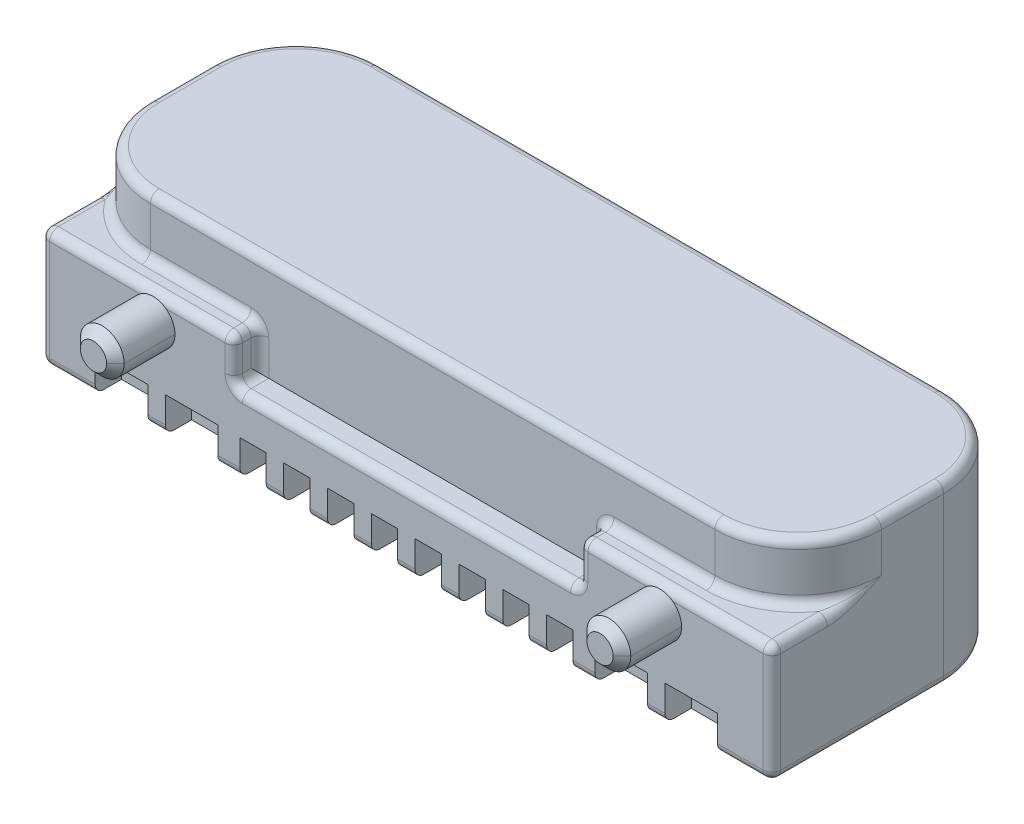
ISO-10303-21;
HEADER;
FILE_DESCRIPTION(('STEP AP214'),'2;1');
FILE_NAME('part.step','',(''),(''),'','','');
FILE_SCHEMA(('AUTOMOTIVE_DESIGN { 1 0 10303 214 1 1 1 1 }'));
ENDSEC;
DATA;
#1=APPLICATION_CONTEXT('core data for automotive mechanical design processes');
#2=APPLICATION_PROTOCOL_DEFINITION('international standard','automotive_design',2000,#1);
#3=PRODUCT_CONTEXT('',#1,'mechanical');
#4=PRODUCT('Part','Part','',(#3));
#5=PRODUCT_RELATED_PRODUCT_CATEGORY('part','',(#4));
#6=PRODUCT_DEFINITION_FORMATION('','',#4);
#7=PRODUCT_DEFINITION_CONTEXT('part definition',#1,'design');
#8=PRODUCT_DEFINITION('design','',#6,#7);
#9=PRODUCT_DEFINITION_SHAPE('','',#8);
#10=(LENGTH_UNIT() NAMED_UNIT(*) SI_UNIT(.MILLI.,.METRE.));
#11=(NAMED_UNIT(*) PLANE_ANGLE_UNIT() SI_UNIT($,.RADIAN.));
#12=(NAMED_UNIT(*) SI_UNIT($,.STERADIAN.) SOLID_ANGLE_UNIT());
#13=UNCERTAINTY_MEASURE_WITH_UNIT(LENGTH_MEASURE(1.E-05),#10,'distance_accuracy_value','');
#14=(GEOMETRIC_REPRESENTATION_CONTEXT(3) GLOBAL_UNCERTAINTY_ASSIGNED_CONTEXT((#13)) GLOBAL_UNIT_ASSIGNED_CONTEXT((#10,
#11,#12)) REPRESENTATION_CONTEXT('',''));
#15=CARTESIAN_POINT('',(0.,0.,0.));
#16=DIRECTION('',(0.,0.,1.));
#17=DIRECTION('',(1.,0.,0.));
#18=AXIS2_PLACEMENT_3D('',#15,#16,#17);
#19=CARTESIAN_POINT('',(3.22,0.1,1.505));
#20=DIRECTION('',(1.,0.,0.));
#21=DIRECTION('',(0.,0.707106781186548,-0.707106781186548));
#22=AXIS2_PLACEMENT_3D('',#19,#20,#21);
#23=CYLINDRICAL_SURFACE('',#22,0.1);
#24=CARTESIAN_POINT('',(0.4,0.1,1.505));
#25=DIRECTION('',(-1.,0.,0.));
#26=DIRECTION('',(0.,0.,-1.));
#27=AXIS2_PLACEMENT_3D('',#24,#25,#26);
#28=CIRCLE('',#27,0.1);
#29=CARTESIAN_POINT('',(0.4,0.,1.505));
#30=VERTEX_POINT('',#29);
#31=CARTESIAN_POINT('',(0.4,0.1,1.605));
#32=VERTEX_POINT('',#31);
#33=EDGE_CURVE('E11',#30,#32,#28,.T.);
#34=ORIENTED_EDGE('',*,*,#33,.F.);
#35=DIRECTION('',(-1.,0.,0.));
#36=VECTOR('',#35,1.);
#37=CARTESIAN_POINT('',(-4.17,0.,1.505));
#38=LINE('',#37,#36);
#39=CARTESIAN_POINT('',(0.6,0.,1.505));
#40=VERTEX_POINT('',#39);
#41=EDGE_CURVE('E25',#40,#30,#38,.T.);
#42=ORIENTED_EDGE('',*,*,#41,.F.);
#43=CARTESIAN_POINT('',(0.6,0.1,1.505));
#44=DIRECTION('',(1.,0.,0.));
#45=DIRECTION('',(0.,0.,1.));
#46=AXIS2_PLACEMENT_3D('',#43,#44,#45);
#47=CIRCLE('',#46,0.1);
#48=CARTESIAN_POINT('',(0.6,0.1,1.605));
#49=VERTEX_POINT('',#48);
#50=EDGE_CURVE('E2076',#49,#40,#47,.T.);
#51=ORIENTED_EDGE('',*,*,#50,.F.);
#52=DIRECTION('',(1.,0.,0.));
#53=VECTOR('',#52,1.);
#54=CARTESIAN_POINT('',(4.17,0.1,1.605));
#55=LINE('',#54,#53);
#56=EDGE_CURVE('E2074',#32,#49,#55,.T.);
#57=ORIENTED_EDGE('',*,*,#56,.F.);
#58=EDGE_LOOP('',(#34,#42,#51,#57));
#59=FACE_BOUND('',#58,.T.);
#60=ADVANCED_FACE('F17',(#59),#23,.T.);
#61=CARTESIAN_POINT('',(-4.47,7.3,1.605));
#62=DIRECTION('',(0.,0.,-1.));
#63=DIRECTION('',(-1.,0.,0.));
#64=AXIS2_PLACEMENT_3D('',#61,#62,#63);
#65=PLANE('',#64);
#66=DIRECTION('',(-1.,0.,0.));
#67=VECTOR('',#66,1.);
#68=CARTESIAN_POINT('',(0.1,0.4,1.605));
#69=LINE('',#68,#67);
#70=CARTESIAN_POINT('',(0.4,0.4,1.605));
#71=VERTEX_POINT('',#70);
#72=CARTESIAN_POINT('',(0.1,0.4,1.605));
#73=VERTEX_POINT('',#72);
#74=EDGE_CURVE('E2070',#71,#73,#69,.T.);
#75=ORIENTED_EDGE('',*,*,#74,.F.);
#76=DIRECTION('',(0.,1.,0.));
#77=VECTOR('',#76,1.);
#78=CARTESIAN_POINT('',(0.4,-0.6,1.605));
#79=LINE('',#78,#77);
#80=EDGE_CURVE('E672',#32,#71,#79,.T.);
#81=ORIENTED_EDGE('',*,*,#80,.F.);
#82=ORIENTED_EDGE('',*,*,#56,.T.);
#83=DIRECTION('',(0.,-1.,0.));
#84=VECTOR('',#83,1.);
#85=CARTESIAN_POINT('',(0.6,-0.6,1.605));
#86=LINE('',#85,#84);
#87=CARTESIAN_POINT('',(0.6,0.4,1.605));
#88=VERTEX_POINT('',#87);
#89=EDGE_CURVE('E2078',#88,#49,#86,.T.);
#90=ORIENTED_EDGE('',*,*,#89,.F.);
#91=DIRECTION('',(-1.,0.,0.));
#92=VECTOR('',#91,1.);
#93=CARTESIAN_POINT('',(0.6,0.4,1.605));
#94=LINE('',#93,#92);
#95=CARTESIAN_POINT('',(0.9,0.4,1.605));
#96=VERTEX_POINT('',#95);
#97=EDGE_CURVE('E2406',#96,#88,#94,.T.);
#98=ORIENTED_EDGE('',*,*,#97,.F.);
#99=DIRECTION('',(0.,1.,0.));
#100=VECTOR('',#99,1.);
#101=CARTESIAN_POINT('',(0.9,-0.6,1.605));
#102=LINE('',#101,#100);
#103=CARTESIAN_POINT('',(0.9,0.1,1.605));
#104=VERTEX_POINT('',#103);
#105=EDGE_CURVE('E2401',#104,#96,#102,.T.);
#106=ORIENTED_EDGE('',*,*,#105,.F.);
#107=DIRECTION('',(1.,0.,0.));
#108=VECTOR('',#107,1.);
#109=CARTESIAN_POINT('',(4.17,0.1,1.605));
#110=LINE('',#109,#108);
#111=CARTESIAN_POINT('',(1.1,0.1,1.605));
#112=VERTEX_POINT('',#111);
#113=EDGE_CURVE('E2397',#104,#112,#110,.T.);
#114=ORIENTED_EDGE('',*,*,#113,.T.);
#115=DIRECTION('',(0.,-1.,0.));
#116=VECTOR('',#115,1.);
#117=CARTESIAN_POINT('',(1.1,-0.6,1.605));
#118=LINE('',#117,#116);
#119=CARTESIAN_POINT('',(1.1,0.4,1.605));
#120=VERTEX_POINT('',#119);
#121=EDGE_CURVE('E2392',#120,#112,#118,.T.);
#122=ORIENTED_EDGE('',*,*,#121,.F.);
#123=DIRECTION('',(-1.,0.,0.));
#124=VECTOR('',#123,1.);
#125=CARTESIAN_POINT('',(1.1,0.4,1.605));
#126=LINE('',#125,#124);
#127=CARTESIAN_POINT('',(1.4,0.4,1.605));
#128=VERTEX_POINT('',#127);
#129=EDGE_CURVE('E2387',#128,#120,#126,.T.);
#130=ORIENTED_EDGE('',*,*,#129,.F.);
#131=DIRECTION('',(0.,1.,0.));
#132=VECTOR('',#131,1.);
#133=CARTESIAN_POINT('',(1.4,-0.6,1.605));
#134=LINE('',#133,#132);
#135=CARTESIAN_POINT('',(1.4,0.1,1.605));
#136=VERTEX_POINT('',#135);
#137=EDGE_CURVE('E2382',#136,#128,#134,.T.);
#138=ORIENTED_EDGE('',*,*,#137,.F.);
#139=DIRECTION('',(1.,0.,0.));
#140=VECTOR('',#139,1.);
#141=CARTESIAN_POINT('',(4.17,0.1,1.605));
#142=LINE('',#141,#140);
#143=CARTESIAN_POINT('',(1.6,0.1,1.605));
#144=VERTEX_POINT('',#143);
#145=EDGE_CURVE('E2378',#136,#144,#142,.T.);
#146=ORIENTED_EDGE('',*,*,#145,.T.);
#147=DIRECTION('',(0.,-1.,0.));
#148=VECTOR('',#147,1.);
#149=CARTESIAN_POINT('',(1.6,-0.6,1.605));
#150=LINE('',#149,#148);
#151=CARTESIAN_POINT('',(1.6,0.4,1.605));
#152=VERTEX_POINT('',#151);
#153=EDGE_CURVE('E2373',#152,#144,#150,.T.);
#154=ORIENTED_EDGE('',*,*,#153,.F.);
#155=DIRECTION('',(-1.,0.,0.));
#156=VECTOR('',#155,1.);
#157=CARTESIAN_POINT('',(1.6,0.4,1.605));
#158=LINE('',#157,#156);
#159=CARTESIAN_POINT('',(1.9,0.4,1.605));
#160=VERTEX_POINT('',#159);
#161=EDGE_CURVE('E2368',#160,#152,#158,.T.);
#162=ORIENTED_EDGE('',*,*,#161,.F.);
#163=DIRECTION('',(0.,1.,0.));
#164=VECTOR('',#163,1.);
#165=CARTESIAN_POINT('',(1.9,-0.6,1.605));
#166=LINE('',#165,#164);
#167=CARTESIAN_POINT('',(1.9,0.1,1.605));
#168=VERTEX_POINT('',#167);
#169=EDGE_CURVE('E2363',#168,#160,#166,.T.);
#170=ORIENTED_EDGE('',*,*,#169,.F.);
#171=DIRECTION('',(1.,0.,0.));
#172=VECTOR('',#171,1.);
#173=CARTESIAN_POINT('',(4.17,0.1,1.605));
#174=LINE('',#173,#172);
#175=CARTESIAN_POINT('',(2.15,0.1,1.605));
#176=VERTEX_POINT('',#175);
#177=EDGE_CURVE('E2359',#168,#176,#174,.T.);
#178=ORIENTED_EDGE('',*,*,#177,.T.);
#179=DIRECTION('',(0.,-1.,0.));
#180=VECTOR('',#179,1.);
#181=CARTESIAN_POINT('',(2.15,-0.6,1.605));
#182=LINE('',#181,#180);
#183=CARTESIAN_POINT('',(2.15,0.4,1.605));
#184=VERTEX_POINT('',#183);
#185=EDGE_CURVE('E2354',#184,#176,#182,.T.);
#186=ORIENTED_EDGE('',*,*,#185,.F.);
#187=DIRECTION('',(-1.,0.,0.));
#188=VECTOR('',#187,1.);
#189=CARTESIAN_POINT('',(2.15,0.4,1.605));
#190=LINE('',#189,#188);
#191=CARTESIAN_POINT('',(2.75,0.4,1.605));
#192=VERTEX_POINT('',#191);
#193=EDGE_CURVE('E2349',#192,#184,#190,.T.);
#194=ORIENTED_EDGE('',*,*,#193,.F.);
#195=DIRECTION('',(0.,1.,0.));
#196=VECTOR('',#195,1.);
#197=CARTESIAN_POINT('',(2.75,-0.6,1.605));
#198=LINE('',#197,#196);
#199=CARTESIAN_POINT('',(2.75,0.1,1.605));
#200=VERTEX_POINT('',#199);
#201=EDGE_CURVE('E2344',#200,#192,#198,.T.);
#202=ORIENTED_EDGE('',*,*,#201,.F.);
#203=DIRECTION('',(1.,0.,0.));
#204=VECTOR('',#203,1.);
#205=CARTESIAN_POINT('',(4.17,0.1,1.605));
#206=LINE('',#205,#204);
#207=CARTESIAN_POINT('',(2.95,0.1,1.605));
#208=VERTEX_POINT('',#207);
#209=EDGE_CURVE('E2340',#200,#208,#206,.T.);
#210=ORIENTED_EDGE('',*,*,#209,.T.);
#211=DIRECTION('',(0.,-1.,0.));
#212=VECTOR('',#211,1.);
#213=CARTESIAN_POINT('',(2.95,-0.6,1.605));
#214=LINE('',#213,#212);
#215=CARTESIAN_POINT('',(2.95,0.4,1.605));
#216=VERTEX_POINT('',#215);
#217=EDGE_CURVE('E2335',#216,#208,#214,.T.);
#218=ORIENTED_EDGE('',*,*,#217,.F.);
#219=DIRECTION('',(-1.,0.,0.));
#220=VECTOR('',#219,1.);
#221=CARTESIAN_POINT('',(2.95,0.4,1.605));
#222=LINE('',#221,#220);
#223=CARTESIAN_POINT('',(3.55,0.4,1.605));
#224=VERTEX_POINT('',#223);
#225=EDGE_CURVE('E2330',#224,#216,#222,.T.);
#226=ORIENTED_EDGE('',*,*,#225,.F.);
#227=DIRECTION('',(0.,1.,0.));
#228=VECTOR('',#227,1.);
#229=CARTESIAN_POINT('',(3.55,-0.6,1.605));
#230=LINE('',#229,#228);
#231=CARTESIAN_POINT('',(3.55,0.1,1.605));
#232=VERTEX_POINT('',#231);
#233=EDGE_CURVE('E2325',#232,#224,#230,.T.);
#234=ORIENTED_EDGE('',*,*,#233,.F.);
#235=DIRECTION('',(1.,0.,0.));
#236=VECTOR('',#235,1.);
#237=CARTESIAN_POINT('',(4.17,0.1,1.605));
#238=LINE('',#237,#236);
#239=CARTESIAN_POINT('',(4.07,0.1,1.605));
#240=VERTEX_POINT('',#239);
#241=EDGE_CURVE('E2321',#232,#240,#238,.T.);
#242=ORIENTED_EDGE('',*,*,#241,.T.);
#243=DIRECTION('',(0.,1.,0.));
#244=VECTOR('',#243,1.);
#245=CARTESIAN_POINT('',(4.07,1.35,1.605));
#246=LINE('',#245,#244);
#247=CARTESIAN_POINT('',(4.07,1.25,1.605));
#248=VERTEX_POINT('',#247);
#249=EDGE_CURVE('E2317',#240,#248,#246,.T.);
#250=ORIENTED_EDGE('',*,*,#249,.T.);
#251=DIRECTION('',(-1.,0.,0.));
#252=VECTOR('',#251,1.);
#253=CARTESIAN_POINT('',(-4.47,1.25,1.605));
#254=LINE('',#253,#252);
#255=CARTESIAN_POINT('',(3.04,1.25,1.605));
#256=VERTEX_POINT('',#255);
#257=EDGE_CURVE('E2313',#248,#256,#254,.T.);
#258=ORIENTED_EDGE('',*,*,#257,.T.);
#259=CARTESIAN_POINT('',(2.89,1.05,1.605));
#260=DIRECTION('',(0.,0.,1.));
#261=DIRECTION('',(1.,0.,0.));
#262=AXIS2_PLACEMENT_3D('',#259,#260,#261);
#263=CIRCLE('',#262,0.25);
#264=CARTESIAN_POINT('',(3.14,1.05,1.605));
#265=VERTEX_POINT('',#264);
#266=EDGE_CURVE('E2309',#265,#256,#263,.T.);
#267=ORIENTED_EDGE('',*,*,#266,.F.);
#268=CARTESIAN_POINT('',(2.89,1.05,1.605));
#269=DIRECTION('',(0.,0.,1.));
#270=DIRECTION('',(1.,0.,0.));
#271=AXIS2_PLACEMENT_3D('',#268,#269,#270);
#272=CIRCLE('',#271,0.25);
#273=CARTESIAN_POINT('',(2.64,1.05,1.605));
#274=VERTEX_POINT('',#273);
#275=EDGE_CURVE('E2304',#274,#265,#272,.T.);
#276=ORIENTED_EDGE('',*,*,#275,.F.);
#277=CARTESIAN_POINT('',(2.89,1.05,1.605));
#278=DIRECTION('',(0.,0.,1.));
#279=DIRECTION('',(1.,0.,0.));
#280=AXIS2_PLACEMENT_3D('',#277,#278,#279);
#281=CIRCLE('',#280,0.25);
#282=CARTESIAN_POINT('',(2.74,1.25,1.605));
#283=VERTEX_POINT('',#282);
#284=EDGE_CURVE('E2299',#283,#274,#281,.T.);
#285=ORIENTED_EDGE('',*,*,#284,.F.);
#286=DIRECTION('',(-1.,0.,0.));
#287=VECTOR('',#286,1.);
#288=CARTESIAN_POINT('',(-4.47,1.25,1.605));
#289=LINE('',#288,#287);
#290=CARTESIAN_POINT('',(2.07,1.25,1.605));
#291=VERTEX_POINT('',#290);
#292=EDGE_CURVE('E2295',#283,#291,#289,.T.);
#293=ORIENTED_EDGE('',*,*,#292,.T.);
#294=DIRECTION('',(0.,-1.,0.));
#295=VECTOR('',#294,1.);
#296=CARTESIAN_POINT('',(2.07,7.3,1.605));
#297=LINE('',#296,#295);
#298=CARTESIAN_POINT('',(2.07,0.95,1.605));
#299=VERTEX_POINT('',#298);
#300=EDGE_CURVE('E2291',#291,#299,#297,.T.);
#301=ORIENTED_EDGE('',*,*,#300,.T.);
#302=CARTESIAN_POINT('',(1.87,0.95,1.605));
#303=DIRECTION('',(0.,0.,1.));
#304=DIRECTION('',(-1.,0.,0.));
#305=AXIS2_PLACEMENT_3D('',#302,#303,#304);
#306=CIRCLE('',#305,0.2);
#307=CARTESIAN_POINT('',(1.87,0.75,1.605));
#308=VERTEX_POINT('',#307);
#309=EDGE_CURVE('E2286',#308,#299,#306,.T.);
#310=ORIENTED_EDGE('',*,*,#309,.F.);
#311=DIRECTION('',(-1.,0.,0.));
#312=VECTOR('',#311,1.);
#313=CARTESIAN_POINT('',(-4.47,0.75,1.605));
#314=LINE('',#313,#312);
#315=CARTESIAN_POINT('',(-1.87,0.75,1.605));
#316=VERTEX_POINT('',#315);
#317=EDGE_CURVE('E2282',#308,#316,#314,.T.);
#318=ORIENTED_EDGE('',*,*,#317,.T.);
#319=CARTESIAN_POINT('',(-1.87,0.95,1.605));
#320=DIRECTION('',(0.,0.,1.));
#321=DIRECTION('',(-1.,0.,0.));
#322=AXIS2_PLACEMENT_3D('',#319,#320,#321);
#323=CIRCLE('',#322,0.2);
#324=CARTESIAN_POINT('',(-2.07,0.95,1.605));
#325=VERTEX_POINT('',#324);
#326=EDGE_CURVE('E2277',#325,#316,#323,.T.);
#327=ORIENTED_EDGE('',*,*,#326,.F.);
#328=DIRECTION('',(0.,1.,0.));
#329=VECTOR('',#328,1.);
#330=CARTESIAN_POINT('',(-2.07,7.3,1.605));
#331=LINE('',#330,#329);
#332=CARTESIAN_POINT('',(-2.07,1.25,1.605));
#333=VERTEX_POINT('',#332);
#334=EDGE_CURVE('E2273',#325,#333,#331,.T.);
#335=ORIENTED_EDGE('',*,*,#334,.T.);
#336=DIRECTION('',(-1.,0.,0.));
#337=VECTOR('',#336,1.);
#338=CARTESIAN_POINT('',(-4.47,1.25,1.605));
#339=LINE('',#338,#337);
#340=CARTESIAN_POINT('',(-2.74,1.25,1.605));
#341=VERTEX_POINT('',#340);
#342=EDGE_CURVE('E2269',#333,#341,#339,.T.);
#343=ORIENTED_EDGE('',*,*,#342,.T.);
#344=CARTESIAN_POINT('',(-2.89,1.05,1.605));
#345=DIRECTION('',(0.,0.,1.));
#346=DIRECTION('',(-1.,0.,0.));
#347=AXIS2_PLACEMENT_3D('',#344,#345,#346);
#348=CIRCLE('',#347,0.25);
#349=CARTESIAN_POINT('',(-2.64,1.05,1.605));
#350=VERTEX_POINT('',#349);
#351=EDGE_CURVE('E2264',#350,#341,#348,.T.);
#352=ORIENTED_EDGE('',*,*,#351,.F.);
#353=CARTESIAN_POINT('',(-2.89,1.05,1.605));
#354=DIRECTION('',(0.,0.,1.));
#355=DIRECTION('',(-1.,0.,0.));
#356=AXIS2_PLACEMENT_3D('',#353,#354,#355);
#357=CIRCLE('',#356,0.25);
#358=CARTESIAN_POINT('',(-3.14,1.05,1.605));
#359=VERTEX_POINT('',#358);
#360=EDGE_CURVE('E2259',#359,#350,#357,.T.);
#361=ORIENTED_EDGE('',*,*,#360,.F.);
#362=CARTESIAN_POINT('',(-2.89,1.05,1.605));
#363=DIRECTION('',(0.,0.,1.));
#364=DIRECTION('',(-1.,0.,0.));
#365=AXIS2_PLACEMENT_3D('',#362,#363,#364);
#366=CIRCLE('',#365,0.25);
#367=CARTESIAN_POINT('',(-3.04,1.25,1.605));
#368=VERTEX_POINT('',#367);
#369=EDGE_CURVE('E2254',#368,#359,#366,.T.);
#370=ORIENTED_EDGE('',*,*,#369,.F.);
#371=DIRECTION('',(-1.,0.,0.));
#372=VECTOR('',#371,1.);
#373=CARTESIAN_POINT('',(-4.47,1.25,1.605));
#374=LINE('',#373,#372);
#375=CARTESIAN_POINT('',(-4.07,1.25,1.605));
#376=VERTEX_POINT('',#375);
#377=EDGE_CURVE('E2250',#368,#376,#374,.T.);
#378=ORIENTED_EDGE('',*,*,#377,.T.);
#379=DIRECTION('',(0.,-1.,0.));
#380=VECTOR('',#379,1.);
#381=CARTESIAN_POINT('',(-4.07,0.,1.605));
#382=LINE('',#381,#380);
#383=CARTESIAN_POINT('',(-4.07,0.1,1.605));
#384=VERTEX_POINT('',#383);
#385=EDGE_CURVE('E2246',#376,#384,#382,.T.);
#386=ORIENTED_EDGE('',*,*,#385,.T.);
#387=DIRECTION('',(1.,0.,0.));
#388=VECTOR('',#387,1.);
#389=CARTESIAN_POINT('',(4.17,0.1,1.605));
#390=LINE('',#389,#388);
#391=CARTESIAN_POINT('',(-3.55,0.1,1.605));
#392=VERTEX_POINT('',#391);
#393=EDGE_CURVE('E2242',#384,#392,#390,.T.);
#394=ORIENTED_EDGE('',*,*,#393,.T.);
#395=DIRECTION('',(0.,-1.,0.));
#396=VECTOR('',#395,1.);
#397=CARTESIAN_POINT('',(-3.55,-0.6,1.605));
#398=LINE('',#397,#396);
#399=CARTESIAN_POINT('',(-3.55,0.4,1.605));
#400=VERTEX_POINT('',#399);
#401=EDGE_CURVE('E2237',#400,#392,#398,.T.);
#402=ORIENTED_EDGE('',*,*,#401,.F.);
#403=DIRECTION('',(-1.,0.,0.));
#404=VECTOR('',#403,1.);
#405=CARTESIAN_POINT('',(-2.95,0.4,1.605));
#406=LINE('',#405,#404);
#407=CARTESIAN_POINT('',(-2.95,0.4,1.605));
#408=VERTEX_POINT('',#407);
#409=EDGE_CURVE('E2232',#408,#400,#406,.T.);
#410=ORIENTED_EDGE('',*,*,#409,.F.);
#411=DIRECTION('',(0.,1.,0.));
#412=VECTOR('',#411,1.);
#413=CARTESIAN_POINT('',(-2.95,-0.6,1.605));
#414=LINE('',#413,#412);
#415=CARTESIAN_POINT('',(-2.95,0.1,1.605));
#416=VERTEX_POINT('',#415);
#417=EDGE_CURVE('E2227',#416,#408,#414,.T.);
#418=ORIENTED_EDGE('',*,*,#417,.F.);
#419=DIRECTION('',(1.,0.,0.));
#420=VECTOR('',#419,1.);
#421=CARTESIAN_POINT('',(4.17,0.1,1.605));
#422=LINE('',#421,#420);
#423=CARTESIAN_POINT('',(-2.75,0.1,1.605));
#424=VERTEX_POINT('',#423);
#425=EDGE_CURVE('E2223',#416,#424,#422,.T.);
#426=ORIENTED_EDGE('',*,*,#425,.T.);
#427=DIRECTION('',(0.,-1.,0.));
#428=VECTOR('',#427,1.);
#429=CARTESIAN_POINT('',(-2.75,-0.6,1.605));
#430=LINE('',#429,#428);
#431=CARTESIAN_POINT('',(-2.75,0.4,1.605));
#432=VERTEX_POINT('',#431);
#433=EDGE_CURVE('E2218',#432,#424,#430,.T.);
#434=ORIENTED_EDGE('',*,*,#433,.F.);
#435=DIRECTION('',(-1.,0.,0.));
#436=VECTOR('',#435,1.);
#437=CARTESIAN_POINT('',(-2.15,0.4,1.605));
#438=LINE('',#437,#436);
#439=CARTESIAN_POINT('',(-2.15,0.4,1.605));
#440=VERTEX_POINT('',#439);
#441=EDGE_CURVE('E2213',#440,#432,#438,.T.);
#442=ORIENTED_EDGE('',*,*,#441,.F.);
#443=DIRECTION('',(0.,1.,0.));
#444=VECTOR('',#443,1.);
#445=CARTESIAN_POINT('',(-2.15,-0.6,1.605));
#446=LINE('',#445,#444);
#447=CARTESIAN_POINT('',(-2.15,0.1,1.605));
#448=VERTEX_POINT('',#447);
#449=EDGE_CURVE('E2208',#448,#440,#446,.T.);
#450=ORIENTED_EDGE('',*,*,#449,.F.);
#451=DIRECTION('',(1.,0.,0.));
#452=VECTOR('',#451,1.);
#453=CARTESIAN_POINT('',(4.17,0.1,1.605));
#454=LINE('',#453,#452);
#455=CARTESIAN_POINT('',(-1.9,0.1,1.605));
#456=VERTEX_POINT('',#455);
#457=EDGE_CURVE('E2204',#448,#456,#454,.T.);
#458=ORIENTED_EDGE('',*,*,#457,.T.);
#459=DIRECTION('',(0.,-1.,0.));
#460=VECTOR('',#459,1.);
#461=CARTESIAN_POINT('',(-1.9,-0.6,1.605));
#462=LINE('',#461,#460);
#463=CARTESIAN_POINT('',(-1.9,0.4,1.605));
#464=VERTEX_POINT('',#463);
#465=EDGE_CURVE('E2199',#464,#456,#462,.T.);
#466=ORIENTED_EDGE('',*,*,#465,.F.);
#467=DIRECTION('',(-1.,0.,0.));
#468=VECTOR('',#467,1.);
#469=CARTESIAN_POINT('',(-1.6,0.4,1.605));
#470=LINE('',#469,#468);
#471=CARTESIAN_POINT('',(-1.6,0.4,1.605));
#472=VERTEX_POINT('',#471);
#473=EDGE_CURVE('E2194',#472,#464,#470,.T.);
#474=ORIENTED_EDGE('',*,*,#473,.F.);
#475=DIRECTION('',(0.,1.,0.));
#476=VECTOR('',#475,1.);
#477=CARTESIAN_POINT('',(-1.6,-0.6,1.605));
#478=LINE('',#477,#476);
#479=CARTESIAN_POINT('',(-1.6,0.1,1.605));
#480=VERTEX_POINT('',#479);
#481=EDGE_CURVE('E2189',#480,#472,#478,.T.);
#482=ORIENTED_EDGE('',*,*,#481,.F.);
#483=DIRECTION('',(1.,0.,0.));
#484=VECTOR('',#483,1.);
#485=CARTESIAN_POINT('',(4.17,0.1,1.605));
#486=LINE('',#485,#484);
#487=CARTESIAN_POINT('',(-1.4,0.1,1.605));
#488=VERTEX_POINT('',#487);
#489=EDGE_CURVE('E2185',#480,#488,#486,.T.);
#490=ORIENTED_EDGE('',*,*,#489,.T.);
#491=DIRECTION('',(0.,-1.,0.));
#492=VECTOR('',#491,1.);
#493=CARTESIAN_POINT('',(-1.4,-0.6,1.605));
#494=LINE('',#493,#492);
#495=CARTESIAN_POINT('',(-1.4,0.4,1.605));
#496=VERTEX_POINT('',#495);
#497=EDGE_CURVE('E2180',#496,#488,#494,.T.);
#498=ORIENTED_EDGE('',*,*,#497,.F.);
#499=DIRECTION('',(-1.,0.,0.));
#500=VECTOR('',#499,1.);
#501=CARTESIAN_POINT('',(-1.1,0.4,1.605));
#502=LINE('',#501,#500);
#503=CARTESIAN_POINT('',(-1.1,0.4,1.605));
#504=VERTEX_POINT('',#503);
#505=EDGE_CURVE('E2175',#504,#496,#502,.T.);
#506=ORIENTED_EDGE('',*,*,#505,.F.);
#507=DIRECTION('',(0.,1.,0.));
#508=VECTOR('',#507,1.);
#509=CARTESIAN_POINT('',(-1.1,-0.6,1.605));
#510=LINE('',#509,#508);
#511=CARTESIAN_POINT('',(-1.1,0.1,1.605));
#512=VERTEX_POINT('',#511);
#513=EDGE_CURVE('E2170',#512,#504,#510,.T.);
#514=ORIENTED_EDGE('',*,*,#513,.F.);
#515=DIRECTION('',(1.,0.,0.));
#516=VECTOR('',#515,1.);
#517=CARTESIAN_POINT('',(4.17,0.1,1.605));
#518=LINE('',#517,#516);
#519=CARTESIAN_POINT('',(-0.9,0.1,1.605));
#520=VERTEX_POINT('',#519);
#521=EDGE_CURVE('E2166',#512,#520,#518,.T.);
#522=ORIENTED_EDGE('',*,*,#521,.T.);
#523=DIRECTION('',(0.,-1.,0.));
#524=VECTOR('',#523,1.);
#525=CARTESIAN_POINT('',(-0.9,-0.6,1.605));
#526=LINE('',#525,#524);
#527=CARTESIAN_POINT('',(-0.9,0.4,1.605));
#528=VERTEX_POINT('',#527);
#529=EDGE_CURVE('E2161',#528,#520,#526,.T.);
#530=ORIENTED_EDGE('',*,*,#529,.F.);
#531=DIRECTION('',(-1.,0.,0.));
#532=VECTOR('',#531,1.);
#533=CARTESIAN_POINT('',(-0.6,0.4,1.605));
#534=LINE('',#533,#532);
#535=CARTESIAN_POINT('',(-0.6,0.4,1.605));
#536=VERTEX_POINT('',#535);
#537=EDGE_CURVE('E2156',#536,#528,#534,.T.);
#538=ORIENTED_EDGE('',*,*,#537,.F.);
#539=DIRECTION('',(0.,1.,0.));
#540=VECTOR('',#539,1.);
#541=CARTESIAN_POINT('',(-0.6,-0.6,1.605));
#542=LINE('',#541,#540);
#543=CARTESIAN_POINT('',(-0.6,0.1,1.605));
#544=VERTEX_POINT('',#543);
#545=EDGE_CURVE('E2151',#544,#536,#542,.T.);
#546=ORIENTED_EDGE('',*,*,#545,.F.);
#547=DIRECTION('',(1.,0.,0.));
#548=VECTOR('',#547,1.);
#549=CARTESIAN_POINT('',(4.17,0.1,1.605));
#550=LINE('',#549,#548);
#551=CARTESIAN_POINT('',(-0.4,0.1,1.605));
#552=VERTEX_POINT('',#551);
#553=EDGE_CURVE('E2147',#544,#552,#550,.T.);
#554=ORIENTED_EDGE('',*,*,#553,.T.);
#555=DIRECTION('',(0.,-1.,0.));
#556=VECTOR('',#555,1.);
#557=CARTESIAN_POINT('',(-0.4,-0.6,1.605));
#558=LINE('',#557,#556);
#559=CARTESIAN_POINT('',(-0.4,0.4,1.605));
#560=VERTEX_POINT('',#559);
#561=EDGE_CURVE('E2142',#560,#552,#558,.T.);
#562=ORIENTED_EDGE('',*,*,#561,.F.);
#563=DIRECTION('',(-1.,0.,0.));
#564=VECTOR('',#563,1.);
#565=CARTESIAN_POINT('',(-0.1,0.4,1.605));
#566=LINE('',#565,#564);
#567=CARTESIAN_POINT('',(-0.1,0.4,1.605));
#568=VERTEX_POINT('',#567);
#569=EDGE_CURVE('E2137',#568,#560,#566,.T.);
#570=ORIENTED_EDGE('',*,*,#569,.F.);
#571=DIRECTION('',(0.,1.,0.));
#572=VECTOR('',#571,1.);
#573=CARTESIAN_POINT('',(-0.1,-0.6,1.605));
#574=LINE('',#573,#572);
#575=CARTESIAN_POINT('',(-0.1,0.1,1.605));
#576=VERTEX_POINT('',#575);
#577=EDGE_CURVE('E2132',#576,#568,#574,.T.);
#578=ORIENTED_EDGE('',*,*,#577,.F.);
#579=DIRECTION('',(1.,0.,0.));
#580=VECTOR('',#579,1.);
#581=CARTESIAN_POINT('',(4.17,0.1,1.605));
#582=LINE('',#581,#580);
#583=CARTESIAN_POINT('',(0.1,0.1,1.605));
#584=VERTEX_POINT('',#583);
#585=EDGE_CURVE('E2128',#576,#584,#582,.T.);
#586=ORIENTED_EDGE('',*,*,#585,.T.);
#587=DIRECTION('',(0.,-1.,0.));
#588=VECTOR('',#587,1.);
#589=CARTESIAN_POINT('',(0.1,-0.6,1.605));
#590=LINE('',#589,#588);
#591=EDGE_CURVE('E2073',#73,#584,#590,.T.);
#592=ORIENTED_EDGE('',*,*,#591,.F.);
#593=EDGE_LOOP('',(#75,#81,#82,#90,#98,#106,#114,#122,#130,#138,#146,#154,#162,#170,#178,#186,
#194,#202,#210,#218,#226,#234,#242,#250,#258,#267,#276,#285,#293,#301,#310,#318,#327,#335,#343,
#352,#361,#370,#378,#386,#394,#402,#410,#418,#426,#434,#442,#450,#458,#466,#474,#482,#490,#498,
#506,#514,#522,#530,#538,#546,#554,#562,#570,#578,#586,#592));
#594=FACE_BOUND('',#593,.T.);
#595=ADVANCED_FACE('F2062',(#594),#65,.F.);
#596=CARTESIAN_POINT('',(0.1,-0.6,1.305));
#597=DIRECTION('',(-1.,0.,0.));
#598=DIRECTION('',(0.,0.,1.));
#599=AXIS2_PLACEMENT_3D('',#596,#597,#598);
#600=PLANE('',#599);
#601=DIRECTION('',(0.,0.,-1.));
#602=VECTOR('',#601,1.);
#603=CARTESIAN_POINT('',(0.1,0.,-0.355));
#604=LINE('',#603,#602);
#605=CARTESIAN_POINT('',(0.1,0.,1.505));
#606=VERTEX_POINT('',#605);
#607=CARTESIAN_POINT('',(0.1,0.,1.305));
#608=VERTEX_POINT('',#607);
#609=EDGE_CURVE('E2121',#606,#608,#604,.T.);
#610=ORIENTED_EDGE('',*,*,#609,.T.);
#611=DIRECTION('',(0.,-1.,0.));
#612=VECTOR('',#611,1.);
#613=CARTESIAN_POINT('',(0.1,-0.6,1.305));
#614=LINE('',#613,#612);
#615=CARTESIAN_POINT('',(0.1,0.4,1.305));
#616=VERTEX_POINT('',#615);
#617=EDGE_CURVE('E2117',#616,#608,#614,.T.);
#618=ORIENTED_EDGE('',*,*,#617,.F.);
#619=DIRECTION('',(0.,0.,1.));
#620=VECTOR('',#619,1.);
#621=CARTESIAN_POINT('',(0.1,0.4,1.305));
#622=LINE('',#621,#620);
#623=EDGE_CURVE('E678',#616,#73,#622,.T.);
#624=ORIENTED_EDGE('',*,*,#623,.T.);
#625=ORIENTED_EDGE('',*,*,#591,.T.);
#626=CARTESIAN_POINT('',(0.1,0.1,1.505));
#627=DIRECTION('',(1.,0.,0.));
#628=DIRECTION('',(0.,0.,1.));
#629=AXIS2_PLACEMENT_3D('',#626,#627,#628);
#630=CIRCLE('',#629,0.1);
#631=EDGE_CURVE('E2110',#584,#606,#630,.T.);
#632=ORIENTED_EDGE('',*,*,#631,.T.);
#633=EDGE_LOOP('',(#610,#618,#624,#625,#632));
#634=FACE_BOUND('',#633,.T.);
#635=ADVANCED_FACE('F2059',(#634),#600,.F.);
#636=CARTESIAN_POINT('',(3.22,0.1,1.505));
#637=DIRECTION('',(1.,0.,0.));
#638=DIRECTION('',(0.,0.707106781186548,-0.707106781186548));
#639=AXIS2_PLACEMENT_3D('',#636,#637,#638);
#640=CYLINDRICAL_SURFACE('',#639,0.1);
#641=ORIENTED_EDGE('',*,*,#631,.F.);
#642=ORIENTED_EDGE('',*,*,#585,.F.);
#643=CARTESIAN_POINT('',(-0.1,0.1,1.505));
#644=DIRECTION('',(-1.,0.,0.));
#645=DIRECTION('',(0.,0.,-1.));
#646=AXIS2_PLACEMENT_3D('',#643,#644,#645);
#647=CIRCLE('',#646,0.1);
#648=CARTESIAN_POINT('',(-0.1,0.,1.505));
#649=VERTEX_POINT('',#648);
#650=EDGE_CURVE('E2097',#649,#576,#647,.T.);
#651=ORIENTED_EDGE('',*,*,#650,.F.);
#652=DIRECTION('',(-1.,0.,0.));
#653=VECTOR('',#652,1.);
#654=CARTESIAN_POINT('',(-4.17,0.,1.505));
#655=LINE('',#654,#653);
#656=EDGE_CURVE('E2094',#606,#649,#655,.T.);
#657=ORIENTED_EDGE('',*,*,#656,.F.);
#658=EDGE_LOOP('',(#641,#642,#651,#657));
#659=FACE_BOUND('',#658,.T.);
#660=ADVANCED_FACE('F2054',(#659),#640,.T.);
#661=CARTESIAN_POINT('',(3.22,0.,-0.355));
#662=DIRECTION('',(0.,-1.,0.));
#663=DIRECTION('',(0.,0.,-1.));
#664=AXIS2_PLACEMENT_3D('',#661,#662,#663);
#665=PLANE('',#664);
#666=DIRECTION('',(0.,0.,1.));
#667=VECTOR('',#666,1.);
#668=CARTESIAN_POINT('',(0.4,0.,-0.355));
#669=LINE('',#668,#667);
#670=CARTESIAN_POINT('',(0.4,0.,1.305));
#671=VERTEX_POINT('',#670);
#672=EDGE_CURVE('E2093',#671,#30,#669,.T.);
#673=ORIENTED_EDGE('',*,*,#672,.F.);
#674=DIRECTION('',(1.,0.,0.));
#675=VECTOR('',#674,1.);
#676=CARTESIAN_POINT('',(3.22,0.,1.305));
#677=LINE('',#676,#675);
#678=EDGE_CURVE('E662',#608,#671,#677,.T.);
#679=ORIENTED_EDGE('',*,*,#678,.F.);
#680=ORIENTED_EDGE('',*,*,#609,.F.);
#681=ORIENTED_EDGE('',*,*,#656,.T.);
#682=DIRECTION('',(0.,0.,1.));
#683=VECTOR('',#682,1.);
#684=CARTESIAN_POINT('',(-0.1,0.,-0.355));
#685=LINE('',#684,#683);
#686=CARTESIAN_POINT('',(-0.1,0.,1.305));
#687=VERTEX_POINT('',#686);
#688=EDGE_CURVE('E2099',#687,#649,#685,.T.);
#689=ORIENTED_EDGE('',*,*,#688,.F.);
#690=DIRECTION('',(-1.,0.,0.));
#691=VECTOR('',#690,1.);
#692=CARTESIAN_POINT('',(3.22,0.,1.305));
#693=LINE('',#692,#691);
#694=CARTESIAN_POINT('',(-0.4,0.,1.305));
#695=VERTEX_POINT('',#694);
#696=EDGE_CURVE('E4176',#687,#695,#693,.T.);
#697=ORIENTED_EDGE('',*,*,#696,.T.);
#698=DIRECTION('',(0.,0.,-1.));
#699=VECTOR('',#698,1.);
#700=CARTESIAN_POINT('',(-0.4,0.,-0.355));
#701=LINE('',#700,#699);
#702=CARTESIAN_POINT('',(-0.4,0.,1.505));
#703=VERTEX_POINT('',#702);
#704=EDGE_CURVE('E4171',#703,#695,#701,.T.);
#705=ORIENTED_EDGE('',*,*,#704,.F.);
#706=DIRECTION('',(-1.,0.,0.));
#707=VECTOR('',#706,1.);
#708=CARTESIAN_POINT('',(-4.17,0.,1.505));
#709=LINE('',#708,#707);
#710=CARTESIAN_POINT('',(-0.6,0.,1.505));
#711=VERTEX_POINT('',#710);
#712=EDGE_CURVE('E4167',#703,#711,#709,.T.);
#713=ORIENTED_EDGE('',*,*,#712,.T.);
#714=DIRECTION('',(0.,0.,1.));
#715=VECTOR('',#714,1.);
#716=CARTESIAN_POINT('',(-0.6,0.,-0.355));
#717=LINE('',#716,#715);
#718=CARTESIAN_POINT('',(-0.6,0.,1.305));
#719=VERTEX_POINT('',#718);
#720=EDGE_CURVE('E4162',#719,#711,#717,.T.);
#721=ORIENTED_EDGE('',*,*,#720,.F.);
#722=DIRECTION('',(-1.,0.,0.));
#723=VECTOR('',#722,1.);
#724=CARTESIAN_POINT('',(3.22,0.,1.305));
#725=LINE('',#724,#723);
#726=CARTESIAN_POINT('',(-0.9,0.,1.305));
#727=VERTEX_POINT('',#726);
#728=EDGE_CURVE('E4158',#719,#727,#725,.T.);
#729=ORIENTED_EDGE('',*,*,#728,.T.);
#730=DIRECTION('',(0.,0.,-1.));
#731=VECTOR('',#730,1.);
#732=CARTESIAN_POINT('',(-0.9,0.,-0.355));
#733=LINE('',#732,#731);
#734=CARTESIAN_POINT('',(-0.9,0.,1.505));
#735=VERTEX_POINT('',#734);
#736=EDGE_CURVE('E4153',#735,#727,#733,.T.);
#737=ORIENTED_EDGE('',*,*,#736,.F.);
#738=DIRECTION('',(-1.,0.,0.));
#739=VECTOR('',#738,1.);
#740=CARTESIAN_POINT('',(-4.17,0.,1.505));
#741=LINE('',#740,#739);
#742=CARTESIAN_POINT('',(-1.1,0.,1.505));
#743=VERTEX_POINT('',#742);
#744=EDGE_CURVE('E4149',#735,#743,#741,.T.);
#745=ORIENTED_EDGE('',*,*,#744,.T.);
#746=DIRECTION('',(0.,0.,1.));
#747=VECTOR('',#746,1.);
#748=CARTESIAN_POINT('',(-1.1,0.,-0.355));
#749=LINE('',#748,#747);
#750=CARTESIAN_POINT('',(-1.1,0.,1.305));
#751=VERTEX_POINT('',#750);
#752=EDGE_CURVE('E4144',#751,#743,#749,.T.);
#753=ORIENTED_EDGE('',*,*,#752,.F.);
#754=DIRECTION('',(-1.,0.,0.));
#755=VECTOR('',#754,1.);
#756=CARTESIAN_POINT('',(3.22,0.,1.305));
#757=LINE('',#756,#755);
#758=CARTESIAN_POINT('',(-1.4,0.,1.305));
#759=VERTEX_POINT('',#758);
#760=EDGE_CURVE('E4140',#751,#759,#757,.T.);
#761=ORIENTED_EDGE('',*,*,#760,.T.);
#762=DIRECTION('',(0.,0.,-1.));
#763=VECTOR('',#762,1.);
#764=CARTESIAN_POINT('',(-1.4,0.,-0.355));
#765=LINE('',#764,#763);
#766=CARTESIAN_POINT('',(-1.4,0.,1.505));
#767=VERTEX_POINT('',#766);
#768=EDGE_CURVE('E4135',#767,#759,#765,.T.);
#769=ORIENTED_EDGE('',*,*,#768,.F.);
#770=DIRECTION('',(-1.,0.,0.));
#771=VECTOR('',#770,1.);
#772=CARTESIAN_POINT('',(-4.17,0.,1.505));
#773=LINE('',#772,#771);
#774=CARTESIAN_POINT('',(-1.6,0.,1.505));
#775=VERTEX_POINT('',#774);
#776=EDGE_CURVE('E4131',#767,#775,#773,.T.);
#777=ORIENTED_EDGE('',*,*,#776,.T.);
#778=DIRECTION('',(0.,0.,1.));
#779=VECTOR('',#778,1.);
#780=CARTESIAN_POINT('',(-1.6,0.,-0.355));
#781=LINE('',#780,#779);
#782=CARTESIAN_POINT('',(-1.6,0.,1.305));
#783=VERTEX_POINT('',#782);
#784=EDGE_CURVE('E4126',#783,#775,#781,.T.);
#785=ORIENTED_EDGE('',*,*,#784,.F.);
#786=DIRECTION('',(-1.,0.,0.));
#787=VECTOR('',#786,1.);
#788=CARTESIAN_POINT('',(3.22,0.,1.305));
#789=LINE('',#788,#787);
#790=CARTESIAN_POINT('',(-1.9,0.,1.305));
#791=VERTEX_POINT('',#790);
#792=EDGE_CURVE('E4122',#783,#791,#789,.T.);
#793=ORIENTED_EDGE('',*,*,#792,.T.);
#794=DIRECTION('',(0.,0.,-1.));
#795=VECTOR('',#794,1.);
#796=CARTESIAN_POINT('',(-1.9,0.,-0.355));
#797=LINE('',#796,#795);
#798=CARTESIAN_POINT('',(-1.9,0.,1.505));
#799=VERTEX_POINT('',#798);
#800=EDGE_CURVE('E4117',#799,#791,#797,.T.);
#801=ORIENTED_EDGE('',*,*,#800,.F.);
#802=DIRECTION('',(-1.,0.,0.));
#803=VECTOR('',#802,1.);
#804=CARTESIAN_POINT('',(-4.17,0.,1.505));
#805=LINE('',#804,#803);
#806=CARTESIAN_POINT('',(-2.15,0.,1.505));
#807=VERTEX_POINT('',#806);
#808=EDGE_CURVE('E4113',#799,#807,#805,.T.);
#809=ORIENTED_EDGE('',*,*,#808,.T.);
#810=DIRECTION('',(0.,0.,1.));
#811=VECTOR('',#810,1.);
#812=CARTESIAN_POINT('',(-2.15,0.,-0.355));
#813=LINE('',#812,#811);
#814=CARTESIAN_POINT('',(-2.15,0.,1.305));
#815=VERTEX_POINT('',#814);
#816=EDGE_CURVE('E4108',#815,#807,#813,.T.);
#817=ORIENTED_EDGE('',*,*,#816,.F.);
#818=DIRECTION('',(-1.,0.,0.));
#819=VECTOR('',#818,1.);
#820=CARTESIAN_POINT('',(3.22,0.,1.305));
#821=LINE('',#820,#819);
#822=CARTESIAN_POINT('',(-2.75,0.,1.305));
#823=VERTEX_POINT('',#822);
#824=EDGE_CURVE('E4104',#815,#823,#821,.T.);
#825=ORIENTED_EDGE('',*,*,#824,.T.);
#826=DIRECTION('',(0.,0.,-1.));
#827=VECTOR('',#826,1.);
#828=CARTESIAN_POINT('',(-2.75,0.,-0.355));
#829=LINE('',#828,#827);
#830=CARTESIAN_POINT('',(-2.75,0.,1.505));
#831=VERTEX_POINT('',#830);
#832=EDGE_CURVE('E4099',#831,#823,#829,.T.);
#833=ORIENTED_EDGE('',*,*,#832,.F.);
#834=DIRECTION('',(-1.,0.,0.));
#835=VECTOR('',#834,1.);
#836=CARTESIAN_POINT('',(-4.17,0.,1.505));
#837=LINE('',#836,#835);
#838=CARTESIAN_POINT('',(-2.95,0.,1.505));
#839=VERTEX_POINT('',#838);
#840=EDGE_CURVE('E4095',#831,#839,#837,.T.);
#841=ORIENTED_EDGE('',*,*,#840,.T.);
#842=DIRECTION('',(0.,0.,1.));
#843=VECTOR('',#842,1.);
#844=CARTESIAN_POINT('',(-2.95,0.,-0.355));
#845=LINE('',#844,#843);
#846=CARTESIAN_POINT('',(-2.95,0.,1.305));
#847=VERTEX_POINT('',#846);
#848=EDGE_CURVE('E4090',#847,#839,#845,.T.);
#849=ORIENTED_EDGE('',*,*,#848,.F.);
#850=DIRECTION('',(-1.,0.,0.));
#851=VECTOR('',#850,1.);
#852=CARTESIAN_POINT('',(3.22,0.,1.305));
#853=LINE('',#852,#851);
#854=CARTESIAN_POINT('',(-3.55,0.,1.305));
#855=VERTEX_POINT('',#854);
#856=EDGE_CURVE('E4086',#847,#855,#853,.T.);
#857=ORIENTED_EDGE('',*,*,#856,.T.);
#858=DIRECTION('',(0.,0.,-1.));
#859=VECTOR('',#858,1.);
#860=CARTESIAN_POINT('',(-3.55,0.,-0.355));
#861=LINE('',#860,#859);
#862=CARTESIAN_POINT('',(-3.55,0.,1.505));
#863=VERTEX_POINT('',#862);
#864=EDGE_CURVE('E4081',#863,#855,#861,.T.);
#865=ORIENTED_EDGE('',*,*,#864,.F.);
#866=DIRECTION('',(-1.,0.,0.));
#867=VECTOR('',#866,1.);
#868=CARTESIAN_POINT('',(-4.17,0.,1.505));
#869=LINE('',#868,#867);
#870=CARTESIAN_POINT('',(-4.07,0.,1.505));
#871=VERTEX_POINT('',#870);
#872=EDGE_CURVE('E4077',#863,#871,#869,.T.);
#873=ORIENTED_EDGE('',*,*,#872,.T.);
#874=DIRECTION('',(0.,0.,-1.));
#875=VECTOR('',#874,1.);
#876=CARTESIAN_POINT('',(-4.07,0.,-0.355));
#877=LINE('',#876,#875);
#878=CARTESIAN_POINT('',(-4.07,0.,-0.355));
#879=VERTEX_POINT('',#878);
#880=EDGE_CURVE('E4069',#871,#879,#877,.T.);
#881=ORIENTED_EDGE('',*,*,#880,.T.);
#882=CARTESIAN_POINT('',(-3.22,0.,-0.355));
#883=DIRECTION('',(0.,-1.,0.));
#884=DIRECTION('',(0.,0.,-1.));
#885=AXIS2_PLACEMENT_3D('',#882,#883,#884);
#886=CIRCLE('',#885,0.85);
#887=CARTESIAN_POINT('',(-3.22,0.,-1.205));
#888=VERTEX_POINT('',#887);
#889=EDGE_CURVE('E2720',#879,#888,#886,.T.);
#890=ORIENTED_EDGE('',*,*,#889,.T.);
#891=DIRECTION('',(1.,0.,0.));
#892=VECTOR('',#891,1.);
#893=CARTESIAN_POINT('',(3.22,0.,-1.205));
#894=LINE('',#893,#892);
#895=CARTESIAN_POINT('',(3.22,0.,-1.205));
#896=VERTEX_POINT('',#895);
#897=EDGE_CURVE('E4068',#888,#896,#894,.T.);
#898=ORIENTED_EDGE('',*,*,#897,.T.);
#899=CARTESIAN_POINT('',(3.22,0.,-1.205));
#900=CARTESIAN_POINT('',(3.48696861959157,0.,-1.20491625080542));
#901=CARTESIAN_POINT('',(3.75435112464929,0.,-1.10050644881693));
#902=CARTESIAN_POINT('',(3.96550644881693,0.,-0.889351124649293));
#903=CARTESIAN_POINT('',(4.06991625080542,0.,-0.621968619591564));
#904=CARTESIAN_POINT('',(4.07,0.,-0.355));
#905=B_SPLINE_CURVE_WITH_KNOTS('',5,(#899,#900,#901,#902,#903,#904),.UNSPECIFIED.,.F.,.F.,(6,6),
(0.,1.5707963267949),.UNSPECIFIED.);
#906=CARTESIAN_POINT('',(4.07,0.,-0.355));
#907=VERTEX_POINT('',#906);
#908=EDGE_CURVE('E1044',#896,#907,#905,.T.);
#909=ORIENTED_EDGE('',*,*,#908,.T.);
#910=DIRECTION('',(0.,0.,1.));
#911=VECTOR('',#910,1.);
#912=CARTESIAN_POINT('',(4.07,0.,-0.355));
#913=LINE('',#912,#911);
#914=CARTESIAN_POINT('',(4.07,0.,1.505));
#915=VERTEX_POINT('',#914);
#916=EDGE_CURVE('E2032',#907,#915,#913,.T.);
#917=ORIENTED_EDGE('',*,*,#916,.T.);
#918=DIRECTION('',(-1.,0.,0.));
#919=VECTOR('',#918,1.);
#920=CARTESIAN_POINT('',(-4.17,0.,1.505));
#921=LINE('',#920,#919);
#922=CARTESIAN_POINT('',(3.55,0.,1.505));
#923=VERTEX_POINT('',#922);
#924=EDGE_CURVE('E2028',#915,#923,#921,.T.);
#925=ORIENTED_EDGE('',*,*,#924,.T.);
#926=DIRECTION('',(0.,0.,1.));
#927=VECTOR('',#926,1.);
#928=CARTESIAN_POINT('',(3.55,0.,-0.355));
#929=LINE('',#928,#927);
#930=CARTESIAN_POINT('',(3.55,0.,1.305));
#931=VERTEX_POINT('',#930);
#932=EDGE_CURVE('E2023',#931,#923,#929,.T.);
#933=ORIENTED_EDGE('',*,*,#932,.F.);
#934=DIRECTION('',(1.,0.,0.));
#935=VECTOR('',#934,1.);
#936=CARTESIAN_POINT('',(3.22,0.,1.305));
#937=LINE('',#936,#935);
#938=CARTESIAN_POINT('',(2.95,0.,1.305));
#939=VERTEX_POINT('',#938);
#940=EDGE_CURVE('E2018',#939,#931,#937,.T.);
#941=ORIENTED_EDGE('',*,*,#940,.F.);
#942=DIRECTION('',(0.,0.,-1.));
#943=VECTOR('',#942,1.);
#944=CARTESIAN_POINT('',(2.95,0.,-0.355));
#945=LINE('',#944,#943);
#946=CARTESIAN_POINT('',(2.95,0.,1.505));
#947=VERTEX_POINT('',#946);
#948=EDGE_CURVE('E2013',#947,#939,#945,.T.);
#949=ORIENTED_EDGE('',*,*,#948,.F.);
#950=DIRECTION('',(-1.,0.,0.));
#951=VECTOR('',#950,1.);
#952=CARTESIAN_POINT('',(-4.17,0.,1.505));
#953=LINE('',#952,#951);
#954=CARTESIAN_POINT('',(2.75,0.,1.505));
#955=VERTEX_POINT('',#954);
#956=EDGE_CURVE('E2009',#947,#955,#953,.T.);
#957=ORIENTED_EDGE('',*,*,#956,.T.);
#958=DIRECTION('',(0.,0.,1.));
#959=VECTOR('',#958,1.);
#960=CARTESIAN_POINT('',(2.75,0.,-0.355));
#961=LINE('',#960,#959);
#962=CARTESIAN_POINT('',(2.75,0.,1.305));
#963=VERTEX_POINT('',#962);
#964=EDGE_CURVE('E2004',#963,#955,#961,.T.);
#965=ORIENTED_EDGE('',*,*,#964,.F.);
#966=DIRECTION('',(1.,0.,0.));
#967=VECTOR('',#966,1.);
#968=CARTESIAN_POINT('',(3.22,0.,1.305));
#969=LINE('',#968,#967);
#970=CARTESIAN_POINT('',(2.15,0.,1.305));
#971=VERTEX_POINT('',#970);
#972=EDGE_CURVE('E1999',#971,#963,#969,.T.);
#973=ORIENTED_EDGE('',*,*,#972,.F.);
#974=DIRECTION('',(0.,0.,-1.));
#975=VECTOR('',#974,1.);
#976=CARTESIAN_POINT('',(2.15,0.,-0.355));
#977=LINE('',#976,#975);
#978=CARTESIAN_POINT('',(2.15,0.,1.505));
#979=VERTEX_POINT('',#978);
#980=EDGE_CURVE('E1994',#979,#971,#977,.T.);
#981=ORIENTED_EDGE('',*,*,#980,.F.);
#982=DIRECTION('',(-1.,0.,0.));
#983=VECTOR('',#982,1.);
#984=CARTESIAN_POINT('',(-4.17,0.,1.505));
#985=LINE('',#984,#983);
#986=CARTESIAN_POINT('',(1.9,0.,1.505));
#987=VERTEX_POINT('',#986);
#988=EDGE_CURVE('E1990',#979,#987,#985,.T.);
#989=ORIENTED_EDGE('',*,*,#988,.T.);
#990=DIRECTION('',(0.,0.,1.));
#991=VECTOR('',#990,1.);
#992=CARTESIAN_POINT('',(1.9,0.,-0.355));
#993=LINE('',#992,#991);
#994=CARTESIAN_POINT('',(1.9,0.,1.305));
#995=VERTEX_POINT('',#994);
#996=EDGE_CURVE('E1985',#995,#987,#993,.T.);
#997=ORIENTED_EDGE('',*,*,#996,.F.);
#998=DIRECTION('',(1.,0.,0.));
#999=VECTOR('',#998,1.);
#1000=CARTESIAN_POINT('',(3.22,0.,1.305));
#1001=LINE('',#1000,#999);
#1002=CARTESIAN_POINT('',(1.6,0.,1.305));
#1003=VERTEX_POINT('',#1002);
#1004=EDGE_CURVE('E1980',#1003,#995,#1001,.T.);
#1005=ORIENTED_EDGE('',*,*,#1004,.F.);
#1006=DIRECTION('',(0.,0.,-1.));
#1007=VECTOR('',#1006,1.);
#1008=CARTESIAN_POINT('',(1.6,0.,-0.355));
#1009=LINE('',#1008,#1007);
#1010=CARTESIAN_POINT('',(1.6,0.,1.505));
#1011=VERTEX_POINT('',#1010);
#1012=EDGE_CURVE('E1975',#1011,#1003,#1009,.T.);
#1013=ORIENTED_EDGE('',*,*,#1012,.F.);
#1014=DIRECTION('',(-1.,0.,0.));
#1015=VECTOR('',#1014,1.);
#1016=CARTESIAN_POINT('',(-4.17,0.,1.505));
#1017=LINE('',#1016,#1015);
#1018=CARTESIAN_POINT('',(1.4,0.,1.505));
#1019=VERTEX_POINT('',#1018);
#1020=EDGE_CURVE('E1971',#1011,#1019,#1017,.T.);
#1021=ORIENTED_EDGE('',*,*,#1020,.T.);
#1022=DIRECTION('',(0.,0.,1.));
#1023=VECTOR('',#1022,1.);
#1024=CARTESIAN_POINT('',(1.4,0.,-0.355));
#1025=LINE('',#1024,#1023);
#1026=CARTESIAN_POINT('',(1.4,0.,1.305));
#1027=VERTEX_POINT('',#1026);
#1028=EDGE_CURVE('E1966',#1027,#1019,#1025,.T.);
#1029=ORIENTED_EDGE('',*,*,#1028,.F.);
#1030=DIRECTION('',(1.,0.,0.));
#1031=VECTOR('',#1030,1.);
#1032=CARTESIAN_POINT('',(3.22,0.,1.305));
#1033=LINE('',#1032,#1031);
#1034=CARTESIAN_POINT('',(1.1,0.,1.305));
#1035=VERTEX_POINT('',#1034);
#1036=EDGE_CURVE('E1961',#1035,#1027,#1033,.T.);
#1037=ORIENTED_EDGE('',*,*,#1036,.F.);
#1038=DIRECTION('',(0.,0.,-1.));
#1039=VECTOR('',#1038,1.);
#1040=CARTESIAN_POINT('',(1.1,0.,-0.355));
#1041=LINE('',#1040,#1039);
#1042=CARTESIAN_POINT('',(1.1,0.,1.505));
#1043=VERTEX_POINT('',#1042);
#1044=EDGE_CURVE('E1956',#1043,#1035,#1041,.T.);
#1045=ORIENTED_EDGE('',*,*,#1044,.F.);
#1046=DIRECTION('',(-1.,0.,0.));
#1047=VECTOR('',#1046,1.);
#1048=CARTESIAN_POINT('',(-4.17,0.,1.505));
#1049=LINE('',#1048,#1047);
#1050=CARTESIAN_POINT('',(0.9,0.,1.505));
#1051=VERTEX_POINT('',#1050);
#1052=EDGE_CURVE('E1952',#1043,#1051,#1049,.T.);
#1053=ORIENTED_EDGE('',*,*,#1052,.T.);
#1054=DIRECTION('',(0.,0.,1.));
#1055=VECTOR('',#1054,1.);
#1056=CARTESIAN_POINT('',(0.9,0.,-0.355));
#1057=LINE('',#1056,#1055);
#1058=CARTESIAN_POINT('',(0.9,0.,1.305));
#1059=VERTEX_POINT('',#1058);
#1060=EDGE_CURVE('E1947',#1059,#1051,#1057,.T.);
#1061=ORIENTED_EDGE('',*,*,#1060,.F.);
#1062=DIRECTION('',(1.,0.,0.));
#1063=VECTOR('',#1062,1.);
#1064=CARTESIAN_POINT('',(3.22,0.,1.305));
#1065=LINE('',#1064,#1063);
#1066=CARTESIAN_POINT('',(0.6,0.,1.305));
#1067=VERTEX_POINT('',#1066);
#1068=EDGE_CURVE('E1942',#1067,#1059,#1065,.T.);
#1069=ORIENTED_EDGE('',*,*,#1068,.F.);
#1070=DIRECTION('',(0.,0.,-1.));
#1071=VECTOR('',#1070,1.);
#1072=CARTESIAN_POINT('',(0.6,0.,-0.355));
#1073=LINE('',#1072,#1071);
#1074=EDGE_CURVE('E1937',#40,#1067,#1073,.T.);
#1075=ORIENTED_EDGE('',*,*,#1074,.F.);
#1076=ORIENTED_EDGE('',*,*,#41,.T.);
#1077=EDGE_LOOP('',(#673,#679,#680,#681,#689,#697,#705,#713,#721,#729,#737,#745,#753,#761,#769,
#777,#785,#793,#801,#809,#817,#825,#833,#841,#849,#857,#865,#873,#881,#890,#898,#909,#917,#925,
#933,#941,#949,#957,#965,#973,#981,#989,#997,#1005,#1013,#1021,#1029,#1037,#1045,#1053,#1061,
#1069,#1075,#1076));
#1078=FACE_BOUND('',#1077,.T.);
#1079=ADVANCED_FACE('F2043',(#1078),#665,.T.);
#1080=CARTESIAN_POINT('',(0.6,-0.6,1.305));
#1081=DIRECTION('',(-1.,0.,0.));
#1082=DIRECTION('',(0.,0.,1.));
#1083=AXIS2_PLACEMENT_3D('',#1080,#1081,#1082);
#1084=PLANE('',#1083);
#1085=ORIENTED_EDGE('',*,*,#1074,.T.);
#1086=DIRECTION('',(0.,-1.,0.));
#1087=VECTOR('',#1086,1.);
#1088=CARTESIAN_POINT('',(0.6,-0.6,1.305));
#1089=LINE('',#1088,#1087);
#1090=CARTESIAN_POINT('',(0.6,0.4,1.305));
#1091=VERTEX_POINT('',#1090);
#1092=EDGE_CURVE('E1932',#1091,#1067,#1089,.T.);
#1093=ORIENTED_EDGE('',*,*,#1092,.F.);
#1094=DIRECTION('',(0.,0.,1.));
#1095=VECTOR('',#1094,1.);
#1096=CARTESIAN_POINT('',(0.6,0.4,1.305));
#1097=LINE('',#1096,#1095);
#1098=EDGE_CURVE('E1927',#1091,#88,#1097,.T.);
#1099=ORIENTED_EDGE('',*,*,#1098,.T.);
#1100=ORIENTED_EDGE('',*,*,#89,.T.);
#1101=ORIENTED_EDGE('',*,*,#50,.T.);
#1102=EDGE_LOOP('',(#1085,#1093,#1099,#1100,#1101));
#1103=FACE_BOUND('',#1102,.T.);
#1104=ADVANCED_FACE('F2053',(#1103),#1084,.F.);
#1105=CARTESIAN_POINT('',(0.6,0.4,1.305));
#1106=DIRECTION('',(0.,1.,0.));
#1107=DIRECTION('',(0.,0.,1.));
#1108=AXIS2_PLACEMENT_3D('',#1105,#1106,#1107);
#1109=PLANE('',#1108);
#1110=ORIENTED_EDGE('',*,*,#97,.T.);
#1111=ORIENTED_EDGE('',*,*,#1098,.F.);
#1112=DIRECTION('',(-1.,0.,0.));
#1113=VECTOR('',#1112,1.);
#1114=CARTESIAN_POINT('',(0.6,0.4,1.305));
#1115=LINE('',#1114,#1113);
#1116=CARTESIAN_POINT('',(0.9,0.4,1.305));
#1117=VERTEX_POINT('',#1116);
#1118=EDGE_CURVE('E1922',#1117,#1091,#1115,.T.);
#1119=ORIENTED_EDGE('',*,*,#1118,.F.);
#1120=DIRECTION('',(0.,0.,1.));
#1121=VECTOR('',#1120,1.);
#1122=CARTESIAN_POINT('',(0.9,0.4,1.305));
#1123=LINE('',#1122,#1121);
#1124=EDGE_CURVE('E1917',#1117,#96,#1123,.T.);
#1125=ORIENTED_EDGE('',*,*,#1124,.T.);
#1126=EDGE_LOOP('',(#1110,#1111,#1119,#1125));
#1127=FACE_BOUND('',#1126,.T.);
#1128=ADVANCED_FACE('F2420',(#1127),#1109,.F.);
#1129=CARTESIAN_POINT('',(0.9,-0.6,1.305));
#1130=DIRECTION('',(1.,0.,0.));
#1131=DIRECTION('',(0.,0.,-1.));
#1132=AXIS2_PLACEMENT_3D('',#1129,#1130,#1131);
#1133=PLANE('',#1132);
#1134=ORIENTED_EDGE('',*,*,#1060,.T.);
#1135=CARTESIAN_POINT('',(0.9,0.1,1.505));
#1136=DIRECTION('',(-1.,0.,0.));
#1137=DIRECTION('',(0.,0.,-1.));
#1138=AXIS2_PLACEMENT_3D('',#1135,#1136,#1137);
#1139=CIRCLE('',#1138,0.1);
#1140=EDGE_CURVE('E1912',#1051,#104,#1139,.T.);
#1141=ORIENTED_EDGE('',*,*,#1140,.T.);
#1142=ORIENTED_EDGE('',*,*,#105,.T.);
#1143=ORIENTED_EDGE('',*,*,#1124,.F.);
#1144=DIRECTION('',(0.,1.,0.));
#1145=VECTOR('',#1144,1.);
#1146=CARTESIAN_POINT('',(0.9,-0.6,1.305));
#1147=LINE('',#1146,#1145);
#1148=EDGE_CURVE('E1907',#1059,#1117,#1147,.T.);
#1149=ORIENTED_EDGE('',*,*,#1148,.F.);
#1150=EDGE_LOOP('',(#1134,#1141,#1142,#1143,#1149));
#1151=FACE_BOUND('',#1150,.T.);
#1152=ADVANCED_FACE('F2423',(#1151),#1133,.F.);
#1153=CARTESIAN_POINT('',(0.,0.,1.305));
#1154=DIRECTION('',(0.,0.,-1.));
#1155=DIRECTION('',(-1.,0.,0.));
#1156=AXIS2_PLACEMENT_3D('',#1153,#1154,#1155);
#1157=PLANE('',#1156);
#1158=ORIENTED_EDGE('',*,*,#1068,.T.);
#1159=ORIENTED_EDGE('',*,*,#1148,.T.);
#1160=ORIENTED_EDGE('',*,*,#1118,.T.);
#1161=ORIENTED_EDGE('',*,*,#1092,.T.);
#1162=EDGE_LOOP('',(#1158,#1159,#1160,#1161));
#1163=FACE_BOUND('',#1162,.T.);
#1164=ADVANCED_FACE('F3915',(#1163),#1157,.F.);
#1165=CARTESIAN_POINT('',(3.22,0.1,1.505));
#1166=DIRECTION('',(1.,0.,0.));
#1167=DIRECTION('',(0.,0.707106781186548,-0.707106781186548));
#1168=AXIS2_PLACEMENT_3D('',#1165,#1166,#1167);
#1169=CYLINDRICAL_SURFACE('',#1168,0.1);
#1170=ORIENTED_EDGE('',*,*,#1140,.F.);
#1171=ORIENTED_EDGE('',*,*,#1052,.F.);
#1172=CARTESIAN_POINT('',(1.1,0.1,1.505));
#1173=DIRECTION('',(1.,0.,0.));
#1174=DIRECTION('',(0.,0.,1.));
#1175=AXIS2_PLACEMENT_3D('',#1172,#1173,#1174);
#1176=CIRCLE('',#1175,0.1);
#1177=EDGE_CURVE('E1902',#112,#1043,#1176,.T.);
#1178=ORIENTED_EDGE('',*,*,#1177,.F.);
#1179=ORIENTED_EDGE('',*,*,#113,.F.);
#1180=EDGE_LOOP('',(#1170,#1171,#1178,#1179));
#1181=FACE_BOUND('',#1180,.T.);
#1182=ADVANCED_FACE('F2429',(#1181),#1169,.T.);
#1183=CARTESIAN_POINT('',(1.1,-0.6,1.305));
#1184=DIRECTION('',(-1.,0.,0.));
#1185=DIRECTION('',(0.,0.,1.));
#1186=AXIS2_PLACEMENT_3D('',#1183,#1184,#1185);
#1187=PLANE('',#1186);
#1188=ORIENTED_EDGE('',*,*,#1044,.T.);
#1189=DIRECTION('',(0.,-1.,0.));
#1190=VECTOR('',#1189,1.);
#1191=CARTESIAN_POINT('',(1.1,-0.6,1.305));
#1192=LINE('',#1191,#1190);
#1193=CARTESIAN_POINT('',(1.1,0.4,1.305));
#1194=VERTEX_POINT('',#1193);
#1195=EDGE_CURVE('E1897',#1194,#1035,#1192,.T.);
#1196=ORIENTED_EDGE('',*,*,#1195,.F.);
#1197=DIRECTION('',(0.,0.,1.));
#1198=VECTOR('',#1197,1.);
#1199=CARTESIAN_POINT('',(1.1,0.4,1.305));
#1200=LINE('',#1199,#1198);
#1201=EDGE_CURVE('E1892',#1194,#120,#1200,.T.);
#1202=ORIENTED_EDGE('',*,*,#1201,.T.);
#1203=ORIENTED_EDGE('',*,*,#121,.T.);
#1204=ORIENTED_EDGE('',*,*,#1177,.T.);
#1205=EDGE_LOOP('',(#1188,#1196,#1202,#1203,#1204));
#1206=FACE_BOUND('',#1205,.T.);
#1207=ADVANCED_FACE('F2432',(#1206),#1187,.F.);
#1208=CARTESIAN_POINT('',(1.1,0.4,1.305));
#1209=DIRECTION('',(0.,1.,0.));
#1210=DIRECTION('',(0.,0.,1.));
#1211=AXIS2_PLACEMENT_3D('',#1208,#1209,#1210);
#1212=PLANE('',#1211);
#1213=ORIENTED_EDGE('',*,*,#129,.T.);
#1214=ORIENTED_EDGE('',*,*,#1201,.F.);
#1215=DIRECTION('',(-1.,0.,0.));
#1216=VECTOR('',#1215,1.);
#1217=CARTESIAN_POINT('',(1.1,0.4,1.305));
#1218=LINE('',#1217,#1216);
#1219=CARTESIAN_POINT('',(1.4,0.4,1.305));
#1220=VERTEX_POINT('',#1219);
#1221=EDGE_CURVE('E1887',#1220,#1194,#1218,.T.);
#1222=ORIENTED_EDGE('',*,*,#1221,.F.);
#1223=DIRECTION('',(0.,0.,1.));
#1224=VECTOR('',#1223,1.);
#1225=CARTESIAN_POINT('',(1.4,0.4,1.305));
#1226=LINE('',#1225,#1224);
#1227=EDGE_CURVE('E1882',#1220,#128,#1226,.T.);
#1228=ORIENTED_EDGE('',*,*,#1227,.T.);
#1229=EDGE_LOOP('',(#1213,#1214,#1222,#1228));
#1230=FACE_BOUND('',#1229,.T.);
#1231=ADVANCED_FACE('F2434',(#1230),#1212,.F.);
#1232=CARTESIAN_POINT('',(1.4,-0.6,1.305));
#1233=DIRECTION('',(1.,0.,0.));
#1234=DIRECTION('',(0.,0.,-1.));
#1235=AXIS2_PLACEMENT_3D('',#1232,#1233,#1234);
#1236=PLANE('',#1235);
#1237=ORIENTED_EDGE('',*,*,#1028,.T.);
#1238=CARTESIAN_POINT('',(1.4,0.1,1.505));
#1239=DIRECTION('',(-1.,0.,0.));
#1240=DIRECTION('',(0.,0.,-1.));
#1241=AXIS2_PLACEMENT_3D('',#1238,#1239,#1240);
#1242=CIRCLE('',#1241,0.1);
#1243=EDGE_CURVE('E1877',#1019,#136,#1242,.T.);
#1244=ORIENTED_EDGE('',*,*,#1243,.T.);
#1245=ORIENTED_EDGE('',*,*,#137,.T.);
#1246=ORIENTED_EDGE('',*,*,#1227,.F.);
#1247=DIRECTION('',(0.,1.,0.));
#1248=VECTOR('',#1247,1.);
#1249=CARTESIAN_POINT('',(1.4,-0.6,1.305));
#1250=LINE('',#1249,#1248);
#1251=EDGE_CURVE('E1872',#1027,#1220,#1250,.T.);
#1252=ORIENTED_EDGE('',*,*,#1251,.F.);
#1253=EDGE_LOOP('',(#1237,#1244,#1245,#1246,#1252));
#1254=FACE_BOUND('',#1253,.T.);
#1255=ADVANCED_FACE('F2438',(#1254),#1236,.F.);
#1256=CARTESIAN_POINT('',(0.,0.,1.305));
#1257=DIRECTION('',(0.,0.,-1.));
#1258=DIRECTION('',(-1.,0.,0.));
#1259=AXIS2_PLACEMENT_3D('',#1256,#1257,#1258);
#1260=PLANE('',#1259);
#1261=ORIENTED_EDGE('',*,*,#1036,.T.);
#1262=ORIENTED_EDGE('',*,*,#1251,.T.);
#1263=ORIENTED_EDGE('',*,*,#1221,.T.);
#1264=ORIENTED_EDGE('',*,*,#1195,.T.);
#1265=EDGE_LOOP('',(#1261,#1262,#1263,#1264));
#1266=FACE_BOUND('',#1265,.T.);
#1267=ADVANCED_FACE('F3868',(#1266),#1260,.F.);
#1268=CARTESIAN_POINT('',(3.22,0.1,1.505));
#1269=DIRECTION('',(1.,0.,0.));
#1270=DIRECTION('',(0.,0.707106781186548,-0.707106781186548));
#1271=AXIS2_PLACEMENT_3D('',#1268,#1269,#1270);
#1272=CYLINDRICAL_SURFACE('',#1271,0.1);
#1273=ORIENTED_EDGE('',*,*,#1243,.F.);
#1274=ORIENTED_EDGE('',*,*,#1020,.F.);
#1275=CARTESIAN_POINT('',(1.6,0.1,1.505));
#1276=DIRECTION('',(1.,0.,0.));
#1277=DIRECTION('',(0.,0.,1.));
#1278=AXIS2_PLACEMENT_3D('',#1275,#1276,#1277);
#1279=CIRCLE('',#1278,0.1);
#1280=EDGE_CURVE('E1867',#144,#1011,#1279,.T.);
#1281=ORIENTED_EDGE('',*,*,#1280,.F.);
#1282=ORIENTED_EDGE('',*,*,#145,.F.);
#1283=EDGE_LOOP('',(#1273,#1274,#1281,#1282));
#1284=FACE_BOUND('',#1283,.T.);
#1285=ADVANCED_FACE('F2444',(#1284),#1272,.T.);
#1286=CARTESIAN_POINT('',(1.6,-0.6,1.305));
#1287=DIRECTION('',(-1.,0.,0.));
#1288=DIRECTION('',(0.,0.,1.));
#1289=AXIS2_PLACEMENT_3D('',#1286,#1287,#1288);
#1290=PLANE('',#1289);
#1291=ORIENTED_EDGE('',*,*,#1012,.T.);
#1292=DIRECTION('',(0.,-1.,0.));
#1293=VECTOR('',#1292,1.);
#1294=CARTESIAN_POINT('',(1.6,-0.6,1.305));
#1295=LINE('',#1294,#1293);
#1296=CARTESIAN_POINT('',(1.6,0.4,1.305));
#1297=VERTEX_POINT('',#1296);
#1298=EDGE_CURVE('E1862',#1297,#1003,#1295,.T.);
#1299=ORIENTED_EDGE('',*,*,#1298,.F.);
#1300=DIRECTION('',(0.,0.,1.));
#1301=VECTOR('',#1300,1.);
#1302=CARTESIAN_POINT('',(1.6,0.4,1.305));
#1303=LINE('',#1302,#1301);
#1304=EDGE_CURVE('E1857',#1297,#152,#1303,.T.);
#1305=ORIENTED_EDGE('',*,*,#1304,.T.);
#1306=ORIENTED_EDGE('',*,*,#153,.T.);
#1307=ORIENTED_EDGE('',*,*,#1280,.T.);
#1308=EDGE_LOOP('',(#1291,#1299,#1305,#1306,#1307));
#1309=FACE_BOUND('',#1308,.T.);
#1310=ADVANCED_FACE('F2446',(#1309),#1290,.F.);
#1311=CARTESIAN_POINT('',(1.6,0.4,1.305));
#1312=DIRECTION('',(0.,1.,0.));
#1313=DIRECTION('',(0.,0.,1.));
#1314=AXIS2_PLACEMENT_3D('',#1311,#1312,#1313);
#1315=PLANE('',#1314);
#1316=ORIENTED_EDGE('',*,*,#161,.T.);
#1317=ORIENTED_EDGE('',*,*,#1304,.F.);
#1318=DIRECTION('',(-1.,0.,0.));
#1319=VECTOR('',#1318,1.);
#1320=CARTESIAN_POINT('',(1.6,0.4,1.305));
#1321=LINE('',#1320,#1319);
#1322=CARTESIAN_POINT('',(1.9,0.4,1.305));
#1323=VERTEX_POINT('',#1322);
#1324=EDGE_CURVE('E1852',#1323,#1297,#1321,.T.);
#1325=ORIENTED_EDGE('',*,*,#1324,.F.);
#1326=DIRECTION('',(0.,0.,1.));
#1327=VECTOR('',#1326,1.);
#1328=CARTESIAN_POINT('',(1.9,0.4,1.305));
#1329=LINE('',#1328,#1327);
#1330=EDGE_CURVE('E1847',#1323,#160,#1329,.T.);
#1331=ORIENTED_EDGE('',*,*,#1330,.T.);
#1332=EDGE_LOOP('',(#1316,#1317,#1325,#1331));
#1333=FACE_BOUND('',#1332,.T.);
#1334=ADVANCED_FACE('F2449',(#1333),#1315,.F.);
#1335=CARTESIAN_POINT('',(1.9,-0.6,1.305));
#1336=DIRECTION('',(1.,0.,0.));
#1337=DIRECTION('',(0.,0.,-1.));
#1338=AXIS2_PLACEMENT_3D('',#1335,#1336,#1337);
#1339=PLANE('',#1338);
#1340=ORIENTED_EDGE('',*,*,#996,.T.);
#1341=CARTESIAN_POINT('',(1.9,0.1,1.505));
#1342=DIRECTION('',(-1.,0.,0.));
#1343=DIRECTION('',(0.,0.,-1.));
#1344=AXIS2_PLACEMENT_3D('',#1341,#1342,#1343);
#1345=CIRCLE('',#1344,0.1);
#1346=EDGE_CURVE('E1842',#987,#168,#1345,.T.);
#1347=ORIENTED_EDGE('',*,*,#1346,.T.);
#1348=ORIENTED_EDGE('',*,*,#169,.T.);
#1349=ORIENTED_EDGE('',*,*,#1330,.F.);
#1350=DIRECTION('',(0.,1.,0.));
#1351=VECTOR('',#1350,1.);
#1352=CARTESIAN_POINT('',(1.9,-0.6,1.305));
#1353=LINE('',#1352,#1351);
#1354=EDGE_CURVE('E1837',#995,#1323,#1353,.T.);
#1355=ORIENTED_EDGE('',*,*,#1354,.F.);
#1356=EDGE_LOOP('',(#1340,#1347,#1348,#1349,#1355));
#1357=FACE_BOUND('',#1356,.T.);
#1358=ADVANCED_FACE('F2455',(#1357),#1339,.F.);
#1359=CARTESIAN_POINT('',(0.,0.,1.305));
#1360=DIRECTION('',(0.,0.,-1.));
#1361=DIRECTION('',(-1.,0.,0.));
#1362=AXIS2_PLACEMENT_3D('',#1359,#1360,#1361);
#1363=PLANE('',#1362);
#1364=ORIENTED_EDGE('',*,*,#1004,.T.);
#1365=ORIENTED_EDGE('',*,*,#1354,.T.);
#1366=ORIENTED_EDGE('',*,*,#1324,.T.);
#1367=ORIENTED_EDGE('',*,*,#1298,.T.);
#1368=EDGE_LOOP('',(#1364,#1365,#1366,#1367));
#1369=FACE_BOUND('',#1368,.T.);
#1370=ADVANCED_FACE('F3821',(#1369),#1363,.F.);
#1371=CARTESIAN_POINT('',(3.22,0.1,1.505));
#1372=DIRECTION('',(1.,0.,0.));
#1373=DIRECTION('',(0.,0.707106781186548,-0.707106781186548));
#1374=AXIS2_PLACEMENT_3D('',#1371,#1372,#1373);
#1375=CYLINDRICAL_SURFACE('',#1374,0.1);
#1376=CARTESIAN_POINT('',(2.15,0.1,1.505));
#1377=DIRECTION('',(1.,0.,0.));
#1378=DIRECTION('',(0.,0.,1.));
#1379=AXIS2_PLACEMENT_3D('',#1376,#1377,#1378);
#1380=CIRCLE('',#1379,0.1);
#1381=EDGE_CURVE('E1832',#176,#979,#1380,.T.);
#1382=ORIENTED_EDGE('',*,*,#1381,.F.);
#1383=ORIENTED_EDGE('',*,*,#177,.F.);
#1384=ORIENTED_EDGE('',*,*,#1346,.F.);
#1385=ORIENTED_EDGE('',*,*,#988,.F.);
#1386=EDGE_LOOP('',(#1382,#1383,#1384,#1385));
#1387=FACE_BOUND('',#1386,.T.);
#1388=ADVANCED_FACE('F2459',(#1387),#1375,.T.);
#1389=CARTESIAN_POINT('',(2.15,-0.6,1.305));
#1390=DIRECTION('',(-1.,0.,0.));
#1391=DIRECTION('',(0.,0.,1.));
#1392=AXIS2_PLACEMENT_3D('',#1389,#1390,#1391);
#1393=PLANE('',#1392);
#1394=ORIENTED_EDGE('',*,*,#980,.T.);
#1395=DIRECTION('',(0.,-1.,0.));
#1396=VECTOR('',#1395,1.);
#1397=CARTESIAN_POINT('',(2.15,-0.6,1.305));
#1398=LINE('',#1397,#1396);
#1399=CARTESIAN_POINT('',(2.15,0.4,1.305));
#1400=VERTEX_POINT('',#1399);
#1401=EDGE_CURVE('E1827',#1400,#971,#1398,.T.);
#1402=ORIENTED_EDGE('',*,*,#1401,.F.);
#1403=DIRECTION('',(0.,0.,1.));
#1404=VECTOR('',#1403,1.);
#1405=CARTESIAN_POINT('',(2.15,0.4,1.305));
#1406=LINE('',#1405,#1404);
#1407=EDGE_CURVE('E1822',#1400,#184,#1406,.T.);
#1408=ORIENTED_EDGE('',*,*,#1407,.T.);
#1409=ORIENTED_EDGE('',*,*,#185,.T.);
#1410=ORIENTED_EDGE('',*,*,#1381,.T.);
#1411=EDGE_LOOP('',(#1394,#1402,#1408,#1409,#1410));
#1412=FACE_BOUND('',#1411,.T.);
#1413=ADVANCED_FACE('F2461',(#1412),#1393,.F.);
#1414=CARTESIAN_POINT('',(2.15,0.4,1.305));
#1415=DIRECTION('',(0.,1.,0.));
#1416=DIRECTION('',(0.,0.,1.));
#1417=AXIS2_PLACEMENT_3D('',#1414,#1415,#1416);
#1418=PLANE('',#1417);
#1419=ORIENTED_EDGE('',*,*,#193,.T.);
#1420=ORIENTED_EDGE('',*,*,#1407,.F.);
#1421=DIRECTION('',(-1.,0.,0.));
#1422=VECTOR('',#1421,1.);
#1423=CARTESIAN_POINT('',(2.15,0.4,1.305));
#1424=LINE('',#1423,#1422);
#1425=CARTESIAN_POINT('',(2.75,0.4,1.305));
#1426=VERTEX_POINT('',#1425);
#1427=EDGE_CURVE('E1817',#1426,#1400,#1424,.T.);
#1428=ORIENTED_EDGE('',*,*,#1427,.F.);
#1429=DIRECTION('',(0.,0.,1.));
#1430=VECTOR('',#1429,1.);
#1431=CARTESIAN_POINT('',(2.75,0.4,1.305));
#1432=LINE('',#1431,#1430);
#1433=EDGE_CURVE('E1812',#1426,#192,#1432,.T.);
#1434=ORIENTED_EDGE('',*,*,#1433,.T.);
#1435=EDGE_LOOP('',(#1419,#1420,#1428,#1434));
#1436=FACE_BOUND('',#1435,.T.);
#1437=ADVANCED_FACE('F2465',(#1436),#1418,.F.);
#1438=CARTESIAN_POINT('',(2.75,-0.6,1.305));
#1439=DIRECTION('',(1.,0.,0.));
#1440=DIRECTION('',(0.,0.,-1.));
#1441=AXIS2_PLACEMENT_3D('',#1438,#1439,#1440);
#1442=PLANE('',#1441);
#1443=ORIENTED_EDGE('',*,*,#964,.T.);
#1444=CARTESIAN_POINT('',(2.75,0.1,1.505));
#1445=DIRECTION('',(-1.,0.,0.));
#1446=DIRECTION('',(0.,0.,-1.));
#1447=AXIS2_PLACEMENT_3D('',#1444,#1445,#1446);
#1448=CIRCLE('',#1447,0.1);
#1449=EDGE_CURVE('E1807',#955,#200,#1448,.T.);
#1450=ORIENTED_EDGE('',*,*,#1449,.T.);
#1451=ORIENTED_EDGE('',*,*,#201,.T.);
#1452=ORIENTED_EDGE('',*,*,#1433,.F.);
#1453=DIRECTION('',(0.,1.,0.));
#1454=VECTOR('',#1453,1.);
#1455=CARTESIAN_POINT('',(2.75,-0.6,1.305));
#1456=LINE('',#1455,#1454);
#1457=EDGE_CURVE('E1802',#963,#1426,#1456,.T.);
#1458=ORIENTED_EDGE('',*,*,#1457,.F.);
#1459=EDGE_LOOP('',(#1443,#1450,#1451,#1452,#1458));
#1460=FACE_BOUND('',#1459,.T.);
#1461=ADVANCED_FACE('F2468',(#1460),#1442,.F.);
#1462=CARTESIAN_POINT('',(0.,0.,1.305));
#1463=DIRECTION('',(0.,0.,-1.));
#1464=DIRECTION('',(-1.,0.,0.));
#1465=AXIS2_PLACEMENT_3D('',#1462,#1463,#1464);
#1466=PLANE('',#1465);
#1467=ORIENTED_EDGE('',*,*,#972,.T.);
#1468=ORIENTED_EDGE('',*,*,#1457,.T.);
#1469=ORIENTED_EDGE('',*,*,#1427,.T.);
#1470=ORIENTED_EDGE('',*,*,#1401,.T.);
#1471=EDGE_LOOP('',(#1467,#1468,#1469,#1470));
#1472=FACE_BOUND('',#1471,.T.);
#1473=ADVANCED_FACE('F3774',(#1472),#1466,.F.);
#1474=CARTESIAN_POINT('',(3.22,0.1,1.505));
#1475=DIRECTION('',(1.,0.,0.));
#1476=DIRECTION('',(0.,0.707106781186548,-0.707106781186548));
#1477=AXIS2_PLACEMENT_3D('',#1474,#1475,#1476);
#1478=CYLINDRICAL_SURFACE('',#1477,0.1);
#1479=ORIENTED_EDGE('',*,*,#1449,.F.);
#1480=ORIENTED_EDGE('',*,*,#956,.F.);
#1481=CARTESIAN_POINT('',(2.95,0.1,1.505));
#1482=DIRECTION('',(1.,0.,0.));
#1483=DIRECTION('',(0.,0.,1.));
#1484=AXIS2_PLACEMENT_3D('',#1481,#1482,#1483);
#1485=CIRCLE('',#1484,0.1);
#1486=EDGE_CURVE('E1797',#208,#947,#1485,.T.);
#1487=ORIENTED_EDGE('',*,*,#1486,.F.);
#1488=ORIENTED_EDGE('',*,*,#209,.F.);
#1489=EDGE_LOOP('',(#1479,#1480,#1487,#1488));
#1490=FACE_BOUND('',#1489,.T.);
#1491=ADVANCED_FACE('F2474',(#1490),#1478,.T.);
#1492=CARTESIAN_POINT('',(2.95,-0.6,1.305));
#1493=DIRECTION('',(-1.,0.,0.));
#1494=DIRECTION('',(0.,0.,1.));
#1495=AXIS2_PLACEMENT_3D('',#1492,#1493,#1494);
#1496=PLANE('',#1495);
#1497=ORIENTED_EDGE('',*,*,#948,.T.);
#1498=DIRECTION('',(0.,-1.,0.));
#1499=VECTOR('',#1498,1.);
#1500=CARTESIAN_POINT('',(2.95,-0.6,1.305));
#1501=LINE('',#1500,#1499);
#1502=CARTESIAN_POINT('',(2.95,0.4,1.305));
#1503=VERTEX_POINT('',#1502);
#1504=EDGE_CURVE('E1792',#1503,#939,#1501,.T.);
#1505=ORIENTED_EDGE('',*,*,#1504,.F.);
#1506=DIRECTION('',(0.,0.,1.));
#1507=VECTOR('',#1506,1.);
#1508=CARTESIAN_POINT('',(2.95,0.4,1.305));
#1509=LINE('',#1508,#1507);
#1510=EDGE_CURVE('E1787',#1503,#216,#1509,.T.);
#1511=ORIENTED_EDGE('',*,*,#1510,.T.);
#1512=ORIENTED_EDGE('',*,*,#217,.T.);
#1513=ORIENTED_EDGE('',*,*,#1486,.T.);
#1514=EDGE_LOOP('',(#1497,#1505,#1511,#1512,#1513));
#1515=FACE_BOUND('',#1514,.T.);
#1516=ADVANCED_FACE('F2477',(#1515),#1496,.F.);
#1517=CARTESIAN_POINT('',(2.95,0.4,1.305));
#1518=DIRECTION('',(0.,1.,0.));
#1519=DIRECTION('',(0.,0.,1.));
#1520=AXIS2_PLACEMENT_3D('',#1517,#1518,#1519);
#1521=PLANE('',#1520);
#1522=ORIENTED_EDGE('',*,*,#225,.T.);
#1523=ORIENTED_EDGE('',*,*,#1510,.F.);
#1524=DIRECTION('',(-1.,0.,0.));
#1525=VECTOR('',#1524,1.);
#1526=CARTESIAN_POINT('',(2.95,0.4,1.305));
#1527=LINE('',#1526,#1525);
#1528=CARTESIAN_POINT('',(3.55,0.4,1.305));
#1529=VERTEX_POINT('',#1528);
#1530=EDGE_CURVE('E1782',#1529,#1503,#1527,.T.);
#1531=ORIENTED_EDGE('',*,*,#1530,.F.);
#1532=DIRECTION('',(0.,0.,1.));
#1533=VECTOR('',#1532,1.);
#1534=CARTESIAN_POINT('',(3.55,0.4,1.305));
#1535=LINE('',#1534,#1533);
#1536=EDGE_CURVE('E1777',#1529,#224,#1535,.T.);
#1537=ORIENTED_EDGE('',*,*,#1536,.T.);
#1538=EDGE_LOOP('',(#1522,#1523,#1531,#1537));
#1539=FACE_BOUND('',#1538,.T.);
#1540=ADVANCED_FACE('F2479',(#1539),#1521,.F.);
#1541=CARTESIAN_POINT('',(3.55,-0.6,1.305));
#1542=DIRECTION('',(1.,0.,0.));
#1543=DIRECTION('',(0.,0.,-1.));
#1544=AXIS2_PLACEMENT_3D('',#1541,#1542,#1543);
#1545=PLANE('',#1544);
#1546=ORIENTED_EDGE('',*,*,#932,.T.);
#1547=CARTESIAN_POINT('',(3.55,0.1,1.505));
#1548=DIRECTION('',(-1.,0.,0.));
#1549=DIRECTION('',(0.,0.,-1.));
#1550=AXIS2_PLACEMENT_3D('',#1547,#1548,#1549);
#1551=CIRCLE('',#1550,0.1);
#1552=EDGE_CURVE('E1772',#923,#232,#1551,.T.);
#1553=ORIENTED_EDGE('',*,*,#1552,.T.);
#1554=ORIENTED_EDGE('',*,*,#233,.T.);
#1555=ORIENTED_EDGE('',*,*,#1536,.F.);
#1556=DIRECTION('',(0.,1.,0.));
#1557=VECTOR('',#1556,1.);
#1558=CARTESIAN_POINT('',(3.55,-0.6,1.305));
#1559=LINE('',#1558,#1557);
#1560=EDGE_CURVE('E1767',#931,#1529,#1559,.T.);
#1561=ORIENTED_EDGE('',*,*,#1560,.F.);
#1562=EDGE_LOOP('',(#1546,#1553,#1554,#1555,#1561));
#1563=FACE_BOUND('',#1562,.T.);
#1564=ADVANCED_FACE('F2483',(#1563),#1545,.F.);
#1565=CARTESIAN_POINT('',(0.,0.,1.305));
#1566=DIRECTION('',(0.,0.,-1.));
#1567=DIRECTION('',(-1.,0.,0.));
#1568=AXIS2_PLACEMENT_3D('',#1565,#1566,#1567);
#1569=PLANE('',#1568);
#1570=ORIENTED_EDGE('',*,*,#940,.T.);
#1571=ORIENTED_EDGE('',*,*,#1560,.T.);
#1572=ORIENTED_EDGE('',*,*,#1530,.T.);
#1573=ORIENTED_EDGE('',*,*,#1504,.T.);
#1574=EDGE_LOOP('',(#1570,#1571,#1572,#1573));
#1575=FACE_BOUND('',#1574,.T.);
#1576=ADVANCED_FACE('F3727',(#1575),#1569,.F.);
#1577=CARTESIAN_POINT('',(3.22,0.1,1.505));
#1578=DIRECTION('',(1.,0.,0.));
#1579=DIRECTION('',(0.,0.707106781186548,-0.707106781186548));
#1580=AXIS2_PLACEMENT_3D('',#1577,#1578,#1579);
#1581=CYLINDRICAL_SURFACE('',#1580,0.1);
#1582=ORIENTED_EDGE('',*,*,#1552,.F.);
#1583=ORIENTED_EDGE('',*,*,#924,.F.);
#1584=CARTESIAN_POINT('',(4.07,0.1,1.505));
#1585=DIRECTION('',(-1.,0.,0.));
#1586=DIRECTION('',(0.,0.,-1.));
#1587=AXIS2_PLACEMENT_3D('',#1584,#1585,#1586);
#1588=CIRCLE('',#1587,0.1);
#1589=EDGE_CURVE('E1762',#915,#240,#1588,.T.);
#1590=ORIENTED_EDGE('',*,*,#1589,.T.);
#1591=ORIENTED_EDGE('',*,*,#241,.F.);
#1592=EDGE_LOOP('',(#1582,#1583,#1590,#1591));
#1593=FACE_BOUND('',#1592,.T.);
#1594=ADVANCED_FACE('F2491',(#1593),#1581,.T.);
#1595=CARTESIAN_POINT('',(4.07,0.1,1.505));
#1596=DIRECTION('',(0.492194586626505,0.609395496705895,0.621596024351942));
#1597=DIRECTION('',(-0.457034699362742,0.788649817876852,-0.411279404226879));
#1598=AXIS2_PLACEMENT_3D('',#1595,#1596,#1597);
#1599=SPHERICAL_SURFACE('',#1598,0.1);
#1600=ORIENTED_EDGE('',*,*,#1589,.F.);
#1601=CARTESIAN_POINT('',(4.07,0.1,1.505));
#1602=DIRECTION('',(0.,0.,1.));
#1603=DIRECTION('',(1.,0.,0.));
#1604=AXIS2_PLACEMENT_3D('',#1601,#1602,#1603);
#1605=CIRCLE('',#1604,0.1);
#1606=CARTESIAN_POINT('',(4.17,0.1,1.505));
#1607=VERTEX_POINT('',#1606);
#1608=EDGE_CURVE('E1758',#915,#1607,#1605,.T.);
#1609=ORIENTED_EDGE('',*,*,#1608,.T.);
#1610=CARTESIAN_POINT('',(4.07,0.1,1.505));
#1611=DIRECTION('',(0.,-1.,0.));
#1612=DIRECTION('',(0.,0.,-1.));
#1613=AXIS2_PLACEMENT_3D('',#1610,#1611,#1612);
#1614=CIRCLE('',#1613,0.1);
#1615=EDGE_CURVE('E1753',#1607,#240,#1614,.T.);
#1616=ORIENTED_EDGE('',*,*,#1615,.T.);
#1617=EDGE_LOOP('',(#1600,#1609,#1616));
#1618=FACE_BOUND('',#1617,.T.);
#1619=ADVANCED_FACE('F2494',(#1618),#1599,.T.);
#1620=CARTESIAN_POINT('',(4.07,2.,1.505));
#1621=DIRECTION('',(0.,1.,0.));
#1622=DIRECTION('',(-0.707106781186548,0.,-0.707106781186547));
#1623=AXIS2_PLACEMENT_3D('',#1620,#1621,#1622);
#1624=CYLINDRICAL_SURFACE('',#1623,0.1);
#1625=ORIENTED_EDGE('',*,*,#1615,.F.);
#1626=DIRECTION('',(0.,-1.,0.));
#1627=VECTOR('',#1626,1.);
#1628=CARTESIAN_POINT('',(4.17,0.,1.505));
#1629=LINE('',#1628,#1627);
#1630=CARTESIAN_POINT('',(4.17,1.25,1.505));
#1631=VERTEX_POINT('',#1630);
#1632=EDGE_CURVE('E1748',#1631,#1607,#1629,.T.);
#1633=ORIENTED_EDGE('',*,*,#1632,.F.);
#1634=CARTESIAN_POINT('',(4.07,1.25,1.505));
#1635=DIRECTION('',(0.,1.,0.));
#1636=DIRECTION('',(0.,0.,1.));
#1637=AXIS2_PLACEMENT_3D('',#1634,#1635,#1636);
#1638=CIRCLE('',#1637,0.1);
#1639=EDGE_CURVE('E1743',#248,#1631,#1638,.T.);
#1640=ORIENTED_EDGE('',*,*,#1639,.F.);
#1641=ORIENTED_EDGE('',*,*,#249,.F.);
#1642=EDGE_LOOP('',(#1625,#1633,#1640,#1641));
#1643=FACE_BOUND('',#1642,.T.);
#1644=ADVANCED_FACE('F2498',(#1643),#1624,.T.);
#1645=CARTESIAN_POINT('',(4.07,1.25,1.505));
#1646=DIRECTION('',(-0.0561284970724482,-0.559016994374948,0.827254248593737));
#1647=DIRECTION('',(-0.6924837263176,-0.575083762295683,-0.435597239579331));
#1648=AXIS2_PLACEMENT_3D('',#1645,#1646,#1647);
#1649=SPHERICAL_SURFACE('',#1648,0.1);
#1650=ORIENTED_EDGE('',*,*,#1639,.T.);
#1651=CARTESIAN_POINT('',(4.07,1.25,1.505));
#1652=DIRECTION('',(0.,0.,1.));
#1653=DIRECTION('',(1.,0.,0.));
#1654=AXIS2_PLACEMENT_3D('',#1651,#1652,#1653);
#1655=CIRCLE('',#1654,0.1);
#1656=CARTESIAN_POINT('',(4.07,1.35,1.505));
#1657=VERTEX_POINT('',#1656);
#1658=EDGE_CURVE('E1739',#1631,#1657,#1655,.T.);
#1659=ORIENTED_EDGE('',*,*,#1658,.T.);
#1660=CARTESIAN_POINT('',(4.07,1.25,1.505));
#1661=DIRECTION('',(-1.,0.,0.));
#1662=DIRECTION('',(0.,0.,-1.));
#1663=AXIS2_PLACEMENT_3D('',#1660,#1661,#1662);
#1664=CIRCLE('',#1663,0.1);
#1665=EDGE_CURVE('E1734',#248,#1657,#1664,.T.);
#1666=ORIENTED_EDGE('',*,*,#1665,.F.);
#1667=EDGE_LOOP('',(#1650,#1659,#1666));
#1668=FACE_BOUND('',#1667,.T.);
#1669=ADVANCED_FACE('F1706',(#1668),#1649,.T.);
#1670=CARTESIAN_POINT('',(1.97,1.25,1.505));
#1671=DIRECTION('',(1.,0.,0.));
#1672=DIRECTION('',(0.,-0.707106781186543,-0.707106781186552));
#1673=AXIS2_PLACEMENT_3D('',#1670,#1671,#1672);
#1674=CYLINDRICAL_SURFACE('',#1673,0.1);
#1675=ORIENTED_EDGE('',*,*,#1665,.T.);
#1676=DIRECTION('',(1.,0.,0.));
#1677=VECTOR('',#1676,1.);
#1678=CARTESIAN_POINT('',(1.97,1.35,1.505));
#1679=LINE('',#1678,#1677);
#1680=CARTESIAN_POINT('',(2.07,1.35,1.505));
#1681=VERTEX_POINT('',#1680);
#1682=EDGE_CURVE('E1729',#1681,#1657,#1679,.T.);
#1683=ORIENTED_EDGE('',*,*,#1682,.F.);
#1684=CARTESIAN_POINT('',(2.07,1.25,1.505));
#1685=DIRECTION('',(-1.,0.,0.));
#1686=DIRECTION('',(0.,0.,1.));
#1687=AXIS2_PLACEMENT_3D('',#1684,#1685,#1686);
#1688=CIRCLE('',#1687,0.1);
#1689=EDGE_CURVE('E1726',#291,#1681,#1688,.T.);
#1690=ORIENTED_EDGE('',*,*,#1689,.F.);
#1691=ORIENTED_EDGE('',*,*,#292,.F.);
#1692=CARTESIAN_POINT('',(3.04,1.25,1.605));
#1693=DIRECTION('',(-1.,0.,0.));
#1694=VECTOR('',#1693,1.);
#1695=LINE('',#1692,#1694);
#1696=EDGE_CURVE('E1724',#256,#283,#1695,.T.);
#1697=ORIENTED_EDGE('',*,*,#1696,.F.);
#1698=ORIENTED_EDGE('',*,*,#257,.F.);
#1699=EDGE_LOOP('',(#1675,#1683,#1690,#1691,#1697,#1698));
#1700=FACE_BOUND('',#1699,.T.);
#1701=ADVANCED_FACE('F1700',(#1700),#1674,.T.);
#1702=CARTESIAN_POINT('',(2.89,1.05,1.605));
#1703=DIRECTION('',(0.,0.,1.));
#1704=DIRECTION('',(1.,0.,0.));
#1705=AXIS2_PLACEMENT_3D('',#1702,#1703,#1704);
#1706=PLANE('',#1705);
#1707=CARTESIAN_POINT('',(2.89,1.05,1.605));
#1708=DIRECTION('',(0.,0.,1.));
#1709=DIRECTION('',(1.,0.,0.));
#1710=AXIS2_PLACEMENT_3D('',#1707,#1708,#1709);
#1711=CIRCLE('',#1710,0.25);
#1712=EDGE_CURVE('E1680',#256,#283,#1711,.T.);
#1713=ORIENTED_EDGE('',*,*,#1712,.F.);
#1714=ORIENTED_EDGE('',*,*,#1696,.T.);
#1715=EDGE_LOOP('',(#1713,#1714));
#1716=FACE_BOUND('',#1715,.T.);
#1717=ADVANCED_FACE('F1689',(#1716),#1706,.F.);
#1718=CARTESIAN_POINT('',(2.89,1.05,2.285));
#1719=DIRECTION('',(0.,0.,-1.));
#1720=DIRECTION('',(0.,-1.,0.));
#1721=AXIS2_PLACEMENT_3D('',#1718,#1719,#1720);
#1722=CYLINDRICAL_SURFACE('',#1721,0.25);
#1723=DIRECTION('',(0.,0.,-1.));
#1724=VECTOR('',#1723,1.);
#1725=CARTESIAN_POINT('',(3.14,1.05,2.185));
#1726=LINE('',#1725,#1724);
#1727=CARTESIAN_POINT('',(3.14,1.05,2.185));
#1728=VERTEX_POINT('',#1727);
#1729=EDGE_CURVE('E1675',#1728,#265,#1726,.T.);
#1730=ORIENTED_EDGE('',*,*,#1729,.T.);
#1731=ORIENTED_EDGE('',*,*,#266,.T.);
#1732=ORIENTED_EDGE('',*,*,#1712,.T.);
#1733=ORIENTED_EDGE('',*,*,#284,.T.);
#1734=DIRECTION('',(0.,0.,-1.));
#1735=VECTOR('',#1734,1.);
#1736=CARTESIAN_POINT('',(2.64,1.05,2.185));
#1737=LINE('',#1736,#1735);
#1738=CARTESIAN_POINT('',(2.64,1.05,2.185));
#1739=VERTEX_POINT('',#1738);
#1740=EDGE_CURVE('E1670',#1739,#274,#1737,.T.);
#1741=ORIENTED_EDGE('',*,*,#1740,.F.);
#1742=CARTESIAN_POINT('',(2.89,1.05,2.185));
#1743=DIRECTION('',(0.,0.,-1.));
#1744=DIRECTION('',(-1.,0.,0.));
#1745=AXIS2_PLACEMENT_3D('',#1742,#1743,#1744);
#1746=CIRCLE('',#1745,0.25);
#1747=EDGE_CURVE('E1666',#1739,#1728,#1746,.T.);
#1748=ORIENTED_EDGE('',*,*,#1747,.T.);
#1749=EDGE_LOOP('',(#1730,#1731,#1732,#1733,#1741,#1748));
#1750=FACE_BOUND('',#1749,.T.);
#1751=ADVANCED_FACE('F1699',(#1750),#1722,.T.);
#1752=CARTESIAN_POINT('',(2.89,1.05,2.285));
#1753=DIRECTION('',(0.,0.,-1.));
#1754=DIRECTION('',(1.99679659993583E-11,-1.,0.));
#1755=AXIS2_PLACEMENT_3D('',#1752,#1753,#1754);
#1756=CONICAL_SURFACE('',#1755,0.15,0.785398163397);
#1757=DIRECTION('',(0.70710678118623,1.41198414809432E-11,-0.707106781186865));
#1758=VECTOR('',#1757,1.);
#1759=CARTESIAN_POINT('',(3.04,1.050000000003,2.285));
#1760=LINE('',#1759,#1758);
#1761=CARTESIAN_POINT('',(3.04,1.05,2.285));
#1762=VERTEX_POINT('',#1761);
#1763=EDGE_CURVE('E1661',#1762,#1728,#1760,.T.);
#1764=ORIENTED_EDGE('',*,*,#1763,.T.);
#1765=ORIENTED_EDGE('',*,*,#1747,.F.);
#1766=DIRECTION('',(-0.70710678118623,0.,-0.707106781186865));
#1767=VECTOR('',#1766,1.);
#1768=CARTESIAN_POINT('',(2.74,1.05,2.285));
#1769=LINE('',#1768,#1767);
#1770=CARTESIAN_POINT('',(2.74,1.05,2.285));
#1771=VERTEX_POINT('',#1770);
#1772=EDGE_CURVE('E1656',#1771,#1739,#1769,.T.);
#1773=ORIENTED_EDGE('',*,*,#1772,.F.);
#1774=CARTESIAN_POINT('',(2.89,1.05,2.285));
#1775=DIRECTION('',(0.,0.,1.));
#1776=DIRECTION('',(1.,0.,0.));
#1777=AXIS2_PLACEMENT_3D('',#1774,#1775,#1776);
#1778=CIRCLE('',#1777,0.15);
#1779=EDGE_CURVE('E1651',#1762,#1771,#1778,.T.);
#1780=ORIENTED_EDGE('',*,*,#1779,.F.);
#1781=EDGE_LOOP('',(#1764,#1765,#1773,#1780));
#1782=FACE_BOUND('',#1781,.T.);
#1783=ADVANCED_FACE('F2517',(#1782),#1756,.T.);
#1784=CARTESIAN_POINT('',(2.89,1.05,2.285));
#1785=DIRECTION('',(0.,0.,1.));
#1786=DIRECTION('',(1.,0.,0.));
#1787=AXIS2_PLACEMENT_3D('',#1784,#1785,#1786);
#1788=PLANE('',#1787);
#1789=ORIENTED_EDGE('',*,*,#1779,.T.);
#1790=CARTESIAN_POINT('',(2.89,1.05,2.285));
#1791=DIRECTION('',(0.,0.,1.));
#1792=DIRECTION('',(1.,0.,0.));
#1793=AXIS2_PLACEMENT_3D('',#1790,#1791,#1792);
#1794=CIRCLE('',#1793,0.15);
#1795=EDGE_CURVE('E1646',#1771,#1762,#1794,.T.);
#1796=ORIENTED_EDGE('',*,*,#1795,.T.);
#1797=EDGE_LOOP('',(#1789,#1796));
#1798=FACE_BOUND('',#1797,.T.);
#1799=ADVANCED_FACE('F2522',(#1798),#1788,.T.);
#1800=CARTESIAN_POINT('',(2.89,1.05,2.285));
#1801=DIRECTION('',(0.,0.,-1.));
#1802=DIRECTION('',(-9.98429689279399E-12,1.,0.));
#1803=AXIS2_PLACEMENT_3D('',#1800,#1801,#1802);
#1804=CONICAL_SURFACE('',#1803,0.15,0.785398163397);
#1805=ORIENTED_EDGE('',*,*,#1763,.F.);
#1806=ORIENTED_EDGE('',*,*,#1795,.F.);
#1807=ORIENTED_EDGE('',*,*,#1772,.T.);
#1808=CARTESIAN_POINT('',(2.89,1.05,2.185));
#1809=DIRECTION('',(0.,0.,-1.));
#1810=DIRECTION('',(1.,0.,0.));
#1811=AXIS2_PLACEMENT_3D('',#1808,#1809,#1810);
#1812=CIRCLE('',#1811,0.25);
#1813=EDGE_CURVE('E1641',#1728,#1739,#1812,.T.);
#1814=ORIENTED_EDGE('',*,*,#1813,.F.);
#1815=EDGE_LOOP('',(#1805,#1806,#1807,#1814));
#1816=FACE_BOUND('',#1815,.T.);
#1817=ADVANCED_FACE('F2520',(#1816),#1804,.T.);
#1818=CARTESIAN_POINT('',(2.89,1.05,2.285));
#1819=DIRECTION('',(0.,0.,-1.));
#1820=DIRECTION('',(0.,1.,0.));
#1821=AXIS2_PLACEMENT_3D('',#1818,#1819,#1820);
#1822=CYLINDRICAL_SURFACE('',#1821,0.25);
#1823=ORIENTED_EDGE('',*,*,#1729,.F.);
#1824=ORIENTED_EDGE('',*,*,#1813,.T.);
#1825=ORIENTED_EDGE('',*,*,#1740,.T.);
#1826=ORIENTED_EDGE('',*,*,#275,.T.);
#1827=EDGE_LOOP('',(#1823,#1824,#1825,#1826));
#1828=FACE_BOUND('',#1827,.T.);
#1829=ADVANCED_FACE('F2512',(#1828),#1822,.T.);
#1830=CARTESIAN_POINT('',(2.07,1.25,1.505));
#1831=DIRECTION('',(0.559016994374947,-0.0561284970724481,0.827254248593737));
#1832=DIRECTION('',(0.575083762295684,-0.6924837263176,-0.435597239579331));
#1833=AXIS2_PLACEMENT_3D('',#1830,#1831,#1832);
#1834=SPHERICAL_SURFACE('',#1833,0.1);
#1835=ORIENTED_EDGE('',*,*,#1689,.T.);
#1836=CARTESIAN_POINT('',(2.07,1.25,1.505));
#1837=DIRECTION('',(0.,0.,1.));
#1838=DIRECTION('',(1.,0.,0.));
#1839=AXIS2_PLACEMENT_3D('',#1836,#1837,#1838);
#1840=CIRCLE('',#1839,0.1);
#1841=CARTESIAN_POINT('',(1.97,1.25,1.505));
#1842=VERTEX_POINT('',#1841);
#1843=EDGE_CURVE('E1637',#1681,#1842,#1840,.T.);
#1844=ORIENTED_EDGE('',*,*,#1843,.T.);
#1845=CARTESIAN_POINT('',(2.07,1.25,1.505));
#1846=DIRECTION('',(0.,-1.,0.));
#1847=DIRECTION('',(0.,0.,1.));
#1848=AXIS2_PLACEMENT_3D('',#1845,#1846,#1847);
#1849=CIRCLE('',#1848,0.1);
#1850=EDGE_CURVE('E1632',#291,#1842,#1849,.T.);
#1851=ORIENTED_EDGE('',*,*,#1850,.F.);
#1852=EDGE_LOOP('',(#1835,#1844,#1851));
#1853=FACE_BOUND('',#1852,.T.);
#1854=ADVANCED_FACE('F2533',(#1853),#1834,.T.);
#1855=CARTESIAN_POINT('',(2.07,1.35,1.505));
#1856=DIRECTION('',(0.,1.,0.));
#1857=DIRECTION('',(0.707106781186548,0.,-0.707106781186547));
#1858=AXIS2_PLACEMENT_3D('',#1855,#1856,#1857);
#1859=CYLINDRICAL_SURFACE('',#1858,0.1);
#1860=ORIENTED_EDGE('',*,*,#1850,.T.);
#1861=DIRECTION('',(0.,1.,0.));
#1862=VECTOR('',#1861,1.);
#1863=CARTESIAN_POINT('',(1.97,1.35,1.505));
#1864=LINE('',#1863,#1862);
#1865=CARTESIAN_POINT('',(1.97,0.95,1.505));
#1866=VERTEX_POINT('',#1865);
#1867=EDGE_CURVE('E1627',#1866,#1842,#1864,.T.);
#1868=ORIENTED_EDGE('',*,*,#1867,.F.);
#1869=CARTESIAN_POINT('',(2.07,0.95,1.505));
#1870=DIRECTION('',(0.,-1.,0.));
#1871=DIRECTION('',(0.,0.,-1.));
#1872=AXIS2_PLACEMENT_3D('',#1869,#1870,#1871);
#1873=CIRCLE('',#1872,0.1);
#1874=EDGE_CURVE('E1622',#299,#1866,#1873,.T.);
#1875=ORIENTED_EDGE('',*,*,#1874,.F.);
#1876=ORIENTED_EDGE('',*,*,#300,.F.);
#1877=EDGE_LOOP('',(#1860,#1868,#1875,#1876));
#1878=FACE_BOUND('',#1877,.T.);
#1879=ADVANCED_FACE('F2536',(#1878),#1859,.T.);
#1880=CARTESIAN_POINT('',(1.87,0.95,1.505));
#1881=DIRECTION('',(0.,0.,-1.));
#1882=DIRECTION('',(-0.707106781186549,0.707106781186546,0.));
#1883=AXIS2_PLACEMENT_3D('',#1880,#1881,#1882);
#1884=TOROIDAL_SURFACE('',#1883,0.2,0.1);
#1885=ORIENTED_EDGE('',*,*,#1874,.T.);
#1886=CARTESIAN_POINT('',(1.87,0.95,1.505));
#1887=DIRECTION('',(0.,0.,-1.));
#1888=DIRECTION('',(-1.,0.,0.));
#1889=AXIS2_PLACEMENT_3D('',#1886,#1887,#1888);
#1890=CIRCLE('',#1889,0.1);
#1891=CARTESIAN_POINT('',(1.87,0.85,1.505));
#1892=VERTEX_POINT('',#1891);
#1893=EDGE_CURVE('E1618',#1866,#1892,#1890,.T.);
#1894=ORIENTED_EDGE('',*,*,#1893,.T.);
#1895=CARTESIAN_POINT('',(1.87,0.75,1.505));
#1896=DIRECTION('',(-1.,0.,0.));
#1897=DIRECTION('',(0.,0.,-1.));
#1898=AXIS2_PLACEMENT_3D('',#1895,#1896,#1897);
#1899=CIRCLE('',#1898,0.1);
#1900=EDGE_CURVE('E1613',#308,#1892,#1899,.T.);
#1901=ORIENTED_EDGE('',*,*,#1900,.F.);
#1902=ORIENTED_EDGE('',*,*,#309,.T.);
#1903=EDGE_LOOP('',(#1885,#1894,#1901,#1902));
#1904=FACE_BOUND('',#1903,.T.);
#1905=ADVANCED_FACE('F2540',(#1904),#1884,.T.);
#1906=CARTESIAN_POINT('',(1.97,0.75,1.505));
#1907=DIRECTION('',(1.,0.,0.));
#1908=DIRECTION('',(0.,-0.707106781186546,-0.707106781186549));
#1909=AXIS2_PLACEMENT_3D('',#1906,#1907,#1908);
#1910=CYLINDRICAL_SURFACE('',#1909,0.1);
#1911=ORIENTED_EDGE('',*,*,#1900,.T.);
#1912=DIRECTION('',(1.,0.,0.));
#1913=VECTOR('',#1912,1.);
#1914=CARTESIAN_POINT('',(1.97,0.85,1.505));
#1915=LINE('',#1914,#1913);
#1916=CARTESIAN_POINT('',(-1.87,0.85,1.505));
#1917=VERTEX_POINT('',#1916);
#1918=EDGE_CURVE('E1608',#1917,#1892,#1915,.T.);
#1919=ORIENTED_EDGE('',*,*,#1918,.F.);
#1920=CARTESIAN_POINT('',(-1.87,0.75,1.505));
#1921=DIRECTION('',(-1.,0.,0.));
#1922=DIRECTION('',(0.,0.,1.));
#1923=AXIS2_PLACEMENT_3D('',#1920,#1921,#1922);
#1924=CIRCLE('',#1923,0.1);
#1925=EDGE_CURVE('E1603',#316,#1917,#1924,.T.);
#1926=ORIENTED_EDGE('',*,*,#1925,.F.);
#1927=ORIENTED_EDGE('',*,*,#317,.F.);
#1928=EDGE_LOOP('',(#1911,#1919,#1926,#1927));
#1929=FACE_BOUND('',#1928,.T.);
#1930=ADVANCED_FACE('F2544',(#1929),#1910,.T.);
#1931=CARTESIAN_POINT('',(-1.87,0.95,1.505));
#1932=DIRECTION('',(0.,0.,-1.));
#1933=DIRECTION('',(0.707106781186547,0.707106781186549,0.));
#1934=AXIS2_PLACEMENT_3D('',#1931,#1932,#1933);
#1935=TOROIDAL_SURFACE('',#1934,0.2,0.1);
#1936=ORIENTED_EDGE('',*,*,#326,.T.);
#1937=ORIENTED_EDGE('',*,*,#1925,.T.);
#1938=CARTESIAN_POINT('',(-1.87,0.95,1.505));
#1939=DIRECTION('',(0.,0.,1.));
#1940=DIRECTION('',(-1.,0.,0.));
#1941=AXIS2_PLACEMENT_3D('',#1938,#1939,#1940);
#1942=CIRCLE('',#1941,0.1);
#1943=CARTESIAN_POINT('',(-1.97,0.95,1.505));
#1944=VERTEX_POINT('',#1943);
#1945=EDGE_CURVE('E1598',#1944,#1917,#1942,.T.);
#1946=ORIENTED_EDGE('',*,*,#1945,.F.);
#1947=CARTESIAN_POINT('',(-2.07,0.95,1.505));
#1948=DIRECTION('',(0.,-1.,0.));
#1949=DIRECTION('',(0.,0.,-1.));
#1950=AXIS2_PLACEMENT_3D('',#1947,#1948,#1949);
#1951=CIRCLE('',#1950,0.1);
#1952=EDGE_CURVE('E1593',#1944,#325,#1951,.T.);
#1953=ORIENTED_EDGE('',*,*,#1952,.T.);
#1954=EDGE_LOOP('',(#1936,#1937,#1946,#1953));
#1955=FACE_BOUND('',#1954,.T.);
#1956=ADVANCED_FACE('F2548',(#1955),#1935,.T.);
#1957=CARTESIAN_POINT('',(-2.07,0.85,1.505));
#1958=DIRECTION('',(0.,-1.,0.));
#1959=DIRECTION('',(-0.707106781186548,0.,-0.707106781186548));
#1960=AXIS2_PLACEMENT_3D('',#1957,#1958,#1959);
#1961=CYLINDRICAL_SURFACE('',#1960,0.1);
#1962=CARTESIAN_POINT('',(-2.07,1.25,1.505));
#1963=DIRECTION('',(0.,1.,0.));
#1964=DIRECTION('',(0.,0.,1.));
#1965=AXIS2_PLACEMENT_3D('',#1962,#1963,#1964);
#1966=CIRCLE('',#1965,0.1);
#1967=CARTESIAN_POINT('',(-1.97,1.25,1.505));
#1968=VERTEX_POINT('',#1967);
#1969=EDGE_CURVE('E1588',#333,#1968,#1966,.T.);
#1970=ORIENTED_EDGE('',*,*,#1969,.F.);
#1971=ORIENTED_EDGE('',*,*,#334,.F.);
#1972=ORIENTED_EDGE('',*,*,#1952,.F.);
#1973=DIRECTION('',(0.,-1.,0.));
#1974=VECTOR('',#1973,1.);
#1975=CARTESIAN_POINT('',(-1.97,0.85,1.505));
#1976=LINE('',#1975,#1974);
#1977=EDGE_CURVE('E1583',#1968,#1944,#1976,.T.);
#1978=ORIENTED_EDGE('',*,*,#1977,.F.);
#1979=EDGE_LOOP('',(#1970,#1971,#1972,#1978));
#1980=FACE_BOUND('',#1979,.T.);
#1981=ADVANCED_FACE('F2552',(#1980),#1961,.T.);
#1982=CARTESIAN_POINT('',(-1.97,0.85,10.053556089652));
#1983=DIRECTION('',(-1.,0.,0.));
#1984=DIRECTION('',(0.,0.,1.));
#1985=AXIS2_PLACEMENT_3D('',#1982,#1983,#1984);
#1986=PLANE('',#1985);
#1987=DIRECTION('',(0.,0.,-1.));
#1988=VECTOR('',#1987,1.);
#1989=CARTESIAN_POINT('',(-1.97,0.95,1.305));
#1990=LINE('',#1989,#1988);
#1991=CARTESIAN_POINT('',(-1.97,0.95,1.405));
#1992=VERTEX_POINT('',#1991);
#1993=EDGE_CURVE('E1579',#1944,#1992,#1990,.T.);
#1994=ORIENTED_EDGE('',*,*,#1993,.T.);
#1995=DIRECTION('',(0.,1.,0.));
#1996=VECTOR('',#1995,1.);
#1997=CARTESIAN_POINT('',(-1.97,0.85,1.405));
#1998=LINE('',#1997,#1996);
#1999=CARTESIAN_POINT('',(-1.97,1.25,1.405));
#2000=VERTEX_POINT('',#1999);
#2001=EDGE_CURVE('E1575',#1992,#2000,#1998,.T.);
#2002=ORIENTED_EDGE('',*,*,#2001,.T.);
#2003=DIRECTION('',(0.,0.,1.));
#2004=VECTOR('',#2003,1.);
#2005=CARTESIAN_POINT('',(-1.97,1.25,10.053556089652));
#2006=LINE('',#2005,#2004);
#2007=EDGE_CURVE('E1570',#2000,#1968,#2006,.T.);
#2008=ORIENTED_EDGE('',*,*,#2007,.T.);
#2009=ORIENTED_EDGE('',*,*,#1977,.T.);
#2010=EDGE_LOOP('',(#1994,#2002,#2008,#2009));
#2011=FACE_BOUND('',#2010,.T.);
#2012=ADVANCED_FACE('F2555',(#2011),#1986,.F.);
#2013=CARTESIAN_POINT('',(-2.07,1.25,10.053556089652));
#2014=DIRECTION('',(0.,0.,-1.));
#2015=DIRECTION('',(-0.707106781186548,-0.707106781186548,0.));
#2016=AXIS2_PLACEMENT_3D('',#2013,#2014,#2015);
#2017=CYLINDRICAL_SURFACE('',#2016,0.1);
#2018=CARTESIAN_POINT('',(-2.07,1.25,1.505));
#2019=DIRECTION('',(0.,0.,-1.));
#2020=DIRECTION('',(1.,0.,0.));
#2021=AXIS2_PLACEMENT_3D('',#2018,#2019,#2020);
#2022=CIRCLE('',#2021,0.1);
#2023=CARTESIAN_POINT('',(-2.07,1.35,1.505));
#2024=VERTEX_POINT('',#2023);
#2025=EDGE_CURVE('E1565',#2024,#1968,#2022,.T.);
#2026=ORIENTED_EDGE('',*,*,#2025,.T.);
#2027=ORIENTED_EDGE('',*,*,#2007,.F.);
#2028=CARTESIAN_POINT('',(-2.07,1.25,1.405));
#2029=DIRECTION('',(0.,0.,-1.));
#2030=DIRECTION('',(1.,0.,0.));
#2031=AXIS2_PLACEMENT_3D('',#2028,#2029,#2030);
#2032=CIRCLE('',#2031,0.1);
#2033=CARTESIAN_POINT('',(-2.07,1.35,1.405));
#2034=VERTEX_POINT('',#2033);
#2035=EDGE_CURVE('E1560',#2034,#2000,#2032,.T.);
#2036=ORIENTED_EDGE('',*,*,#2035,.F.);
#2037=DIRECTION('',(0.,0.,-1.));
#2038=VECTOR('',#2037,1.);
#2039=CARTESIAN_POINT('',(-2.07,1.35,10.053556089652));
#2040=LINE('',#2039,#2038);
#2041=EDGE_CURVE('E1555',#2024,#2034,#2040,.T.);
#2042=ORIENTED_EDGE('',*,*,#2041,.F.);
#2043=EDGE_LOOP('',(#2026,#2027,#2036,#2042));
#2044=FACE_BOUND('',#2043,.T.);
#2045=ADVANCED_FACE('F1536',(#2044),#2017,.T.);
#2046=CARTESIAN_POINT('',(-4.17,1.35,10.053556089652));
#2047=DIRECTION('',(0.,-1.,0.));
#2048=DIRECTION('',(1.,0.,0.));
#2049=AXIS2_PLACEMENT_3D('',#2046,#2047,#2048);
#2050=PLANE('',#2049);
#2051=DIRECTION('',(-1.,0.,0.));
#2052=VECTOR('',#2051,1.);
#2053=CARTESIAN_POINT('',(-4.17,1.35,1.405));
#2054=LINE('',#2053,#2052);
#2055=CARTESIAN_POINT('',(-3.22,1.35,1.405));
#2056=VERTEX_POINT('',#2055);
#2057=EDGE_CURVE('E1553',#2034,#2056,#2054,.T.);
#2058=ORIENTED_EDGE('',*,*,#2057,.T.);
#2059=CARTESIAN_POINT('',(-3.22,1.35,1.405));
#2060=CARTESIAN_POINT('',(-3.41809904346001,1.35,1.40499421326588));
#2061=CARTESIAN_POINT('',(-3.61621340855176,1.35,1.35830601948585));
#2062=CARTESIAN_POINT('',(-3.79958836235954,1.35,1.26477214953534));
#2063=CARTESIAN_POINT('',(-3.95369394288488,1.35,1.131803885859));
#2064=CARTESIAN_POINT('',(-4.07000000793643,1.35,0.97144138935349));
#2065=B_SPLINE_CURVE_WITH_KNOTS('',5,(#2059,#2060,#2061,#2062,#2063,#2064),.UNSPECIFIED.,.F.,
.F.,(6,6),(1.5707963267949,2.5141368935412),.UNSPECIFIED.);
#2066=CARTESIAN_POINT('',(-4.07,1.35,0.971441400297));
#2067=VERTEX_POINT('',#2066);
#2068=EDGE_CURVE('E1552',#2056,#2067,#2065,.T.);
#2069=ORIENTED_EDGE('',*,*,#2068,.T.);
#2070=DIRECTION('',(0.,0.,1.));
#2071=VECTOR('',#2070,1.);
#2072=CARTESIAN_POINT('',(-4.07,1.35,1.605));
#2073=LINE('',#2072,#2071);
#2074=CARTESIAN_POINT('',(-4.07,1.35,1.505));
#2075=VERTEX_POINT('',#2074);
#2076=EDGE_CURVE('E2621',#2067,#2075,#2073,.T.);
#2077=ORIENTED_EDGE('',*,*,#2076,.T.);
#2078=DIRECTION('',(1.,0.,0.));
#2079=VECTOR('',#2078,1.);
#2080=CARTESIAN_POINT('',(-4.17,1.35,1.505));
#2081=LINE('',#2080,#2079);
#2082=EDGE_CURVE('E2619',#2075,#2024,#2081,.T.);
#2083=ORIENTED_EDGE('',*,*,#2082,.T.);
#2084=ORIENTED_EDGE('',*,*,#2041,.T.);
#2085=EDGE_LOOP('',(#2058,#2069,#2077,#2083,#2084));
#2086=FACE_BOUND('',#2085,.T.);
#2087=ADVANCED_FACE('F1531',(#2086),#2050,.F.);
#2088=CARTESIAN_POINT('',(-4.17,1.25,1.505));
#2089=DIRECTION('',(1.,0.,0.));
#2090=DIRECTION('',(0.,-0.707106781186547,-0.707106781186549));
#2091=AXIS2_PLACEMENT_3D('',#2088,#2089,#2090);
#2092=CYLINDRICAL_SURFACE('',#2091,0.1);
#2093=CARTESIAN_POINT('',(-4.07,1.25,1.505));
#2094=DIRECTION('',(1.,0.,0.));
#2095=DIRECTION('',(0.,0.,1.));
#2096=AXIS2_PLACEMENT_3D('',#2093,#2094,#2095);
#2097=CIRCLE('',#2096,0.1);
#2098=EDGE_CURVE('E2624',#2075,#376,#2097,.T.);
#2099=ORIENTED_EDGE('',*,*,#2098,.T.);
#2100=ORIENTED_EDGE('',*,*,#377,.F.);
#2101=CARTESIAN_POINT('',(-2.74,1.25,1.605));
#2102=DIRECTION('',(-1.,0.,0.));
#2103=VECTOR('',#2102,1.);
#2104=LINE('',#2101,#2103);
#2105=EDGE_CURVE('E1506',#341,#368,#2104,.T.);
#2106=ORIENTED_EDGE('',*,*,#2105,.F.);
#2107=ORIENTED_EDGE('',*,*,#342,.F.);
#2108=CARTESIAN_POINT('',(-2.07,1.25,1.505));
#2109=DIRECTION('',(1.,0.,0.));
#2110=DIRECTION('',(0.,0.,-1.));
#2111=AXIS2_PLACEMENT_3D('',#2108,#2109,#2110);
#2112=CIRCLE('',#2111,0.1);
#2113=EDGE_CURVE('E1510',#2024,#333,#2112,.T.);
#2114=ORIENTED_EDGE('',*,*,#2113,.F.);
#2115=ORIENTED_EDGE('',*,*,#2082,.F.);
#2116=EDGE_LOOP('',(#2099,#2100,#2106,#2107,#2114,#2115));
#2117=FACE_BOUND('',#2116,.T.);
#2118=ADVANCED_FACE('F1522',(#2117),#2092,.T.);
#2119=CARTESIAN_POINT('',(-2.07,1.25,1.505));
#2120=DIRECTION('',(-0.0561284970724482,-0.559016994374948,0.827254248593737));
#2121=DIRECTION('',(-0.6924837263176,-0.575083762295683,-0.435597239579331));
#2122=AXIS2_PLACEMENT_3D('',#2119,#2120,#2121);
#2123=SPHERICAL_SURFACE('',#2122,0.1);
#2124=ORIENTED_EDGE('',*,*,#1969,.T.);
#2125=ORIENTED_EDGE('',*,*,#2025,.F.);
#2126=ORIENTED_EDGE('',*,*,#2113,.T.);
#2127=EDGE_LOOP('',(#2124,#2125,#2126));
#2128=FACE_BOUND('',#2127,.T.);
#2129=ADVANCED_FACE('F1487',(#2128),#2123,.T.);
#2130=CARTESIAN_POINT('',(-2.89,1.05,1.605));
#2131=DIRECTION('',(0.,0.,-1.));
#2132=DIRECTION('',(-1.,0.,0.));
#2133=AXIS2_PLACEMENT_3D('',#2130,#2131,#2132);
#2134=PLANE('',#2133);
#2135=CARTESIAN_POINT('',(-2.89,1.05,1.605));
#2136=DIRECTION('',(0.,0.,1.));
#2137=DIRECTION('',(-1.,0.,0.));
#2138=AXIS2_PLACEMENT_3D('',#2135,#2136,#2137);
#2139=CIRCLE('',#2138,0.25);
#2140=EDGE_CURVE('E1508',#341,#368,#2139,.T.);
#2141=ORIENTED_EDGE('',*,*,#2140,.F.);
#2142=ORIENTED_EDGE('',*,*,#2105,.T.);
#2143=EDGE_LOOP('',(#2141,#2142));
#2144=FACE_BOUND('',#2143,.T.);
#2145=ADVANCED_FACE('F1482',(#2144),#2134,.T.);
#2146=CARTESIAN_POINT('',(-2.89,1.05,2.285));
#2147=DIRECTION('',(0.,0.,-1.));
#2148=DIRECTION('',(0.,-1.,0.));
#2149=AXIS2_PLACEMENT_3D('',#2146,#2147,#2148);
#2150=CYLINDRICAL_SURFACE('',#2149,0.25);
#2151=DIRECTION('',(0.,0.,-1.));
#2152=VECTOR('',#2151,1.);
#2153=CARTESIAN_POINT('',(-2.64,1.05,2.185));
#2154=LINE('',#2153,#2152);
#2155=CARTESIAN_POINT('',(-2.64,1.05,2.185));
#2156=VERTEX_POINT('',#2155);
#2157=EDGE_CURVE('E1511',#2156,#350,#2154,.T.);
#2158=ORIENTED_EDGE('',*,*,#2157,.T.);
#2159=ORIENTED_EDGE('',*,*,#351,.T.);
#2160=ORIENTED_EDGE('',*,*,#2140,.T.);
#2161=ORIENTED_EDGE('',*,*,#369,.T.);
#2162=DIRECTION('',(0.,0.,-1.));
#2163=VECTOR('',#2162,1.);
#2164=CARTESIAN_POINT('',(-3.14,1.05,2.185));
#2165=LINE('',#2164,#2163);
#2166=CARTESIAN_POINT('',(-3.14,1.05,2.185));
#2167=VERTEX_POINT('',#2166);
#2168=EDGE_CURVE('E2631',#2167,#359,#2165,.T.);
#2169=ORIENTED_EDGE('',*,*,#2168,.F.);
#2170=CARTESIAN_POINT('',(-2.89,1.05,2.185));
#2171=DIRECTION('',(0.,0.,-1.));
#2172=DIRECTION('',(-1.,0.,0.));
#2173=AXIS2_PLACEMENT_3D('',#2170,#2171,#2172);
#2174=CIRCLE('',#2173,0.25);
#2175=EDGE_CURVE('E2635',#2167,#2156,#2174,.T.);
#2176=ORIENTED_EDGE('',*,*,#2175,.T.);
#2177=EDGE_LOOP('',(#2158,#2159,#2160,#2161,#2169,#2176));
#2178=FACE_BOUND('',#2177,.T.);
#2179=ADVANCED_FACE('F1478',(#2178),#2150,.T.);
#2180=CARTESIAN_POINT('',(-2.89,1.05,2.285));
#2181=DIRECTION('',(0.,0.,-1.));
#2182=DIRECTION('',(0.,-1.,0.));
#2183=AXIS2_PLACEMENT_3D('',#2180,#2181,#2182);
#2184=CONICAL_SURFACE('',#2183,0.15,0.785398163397);
#2185=DIRECTION('',(0.70710678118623,0.,-0.707106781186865));
#2186=VECTOR('',#2185,1.);
#2187=CARTESIAN_POINT('',(-2.74,1.05,2.285));
#2188=LINE('',#2187,#2186);
#2189=CARTESIAN_POINT('',(-2.74,1.05,2.285));
#2190=VERTEX_POINT('',#2189);
#2191=EDGE_CURVE('E2637',#2190,#2156,#2188,.T.);
#2192=ORIENTED_EDGE('',*,*,#2191,.T.);
#2193=ORIENTED_EDGE('',*,*,#2175,.F.);
#2194=DIRECTION('',(-0.70710678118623,0.,-0.707106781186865));
#2195=VECTOR('',#2194,1.);
#2196=CARTESIAN_POINT('',(-3.04,1.05,2.285));
#2197=LINE('',#2196,#2195);
#2198=CARTESIAN_POINT('',(-3.04,1.05,2.285));
#2199=VERTEX_POINT('',#2198);
#2200=EDGE_CURVE('E2648',#2199,#2167,#2197,.T.);
#2201=ORIENTED_EDGE('',*,*,#2200,.F.);
#2202=CARTESIAN_POINT('',(-2.89,1.05,2.285));
#2203=DIRECTION('',(0.,0.,1.));
#2204=DIRECTION('',(-1.,0.,0.));
#2205=AXIS2_PLACEMENT_3D('',#2202,#2203,#2204);
#2206=CIRCLE('',#2205,0.15);
#2207=EDGE_CURVE('E2652',#2190,#2199,#2206,.T.);
#2208=ORIENTED_EDGE('',*,*,#2207,.F.);
#2209=EDGE_LOOP('',(#2192,#2193,#2201,#2208));
#2210=FACE_BOUND('',#2209,.T.);
#2211=ADVANCED_FACE('F1474',(#2210),#2184,.T.);
#2212=CARTESIAN_POINT('',(-2.89,1.05,2.285));
#2213=DIRECTION('',(0.,0.,-1.));
#2214=DIRECTION('',(-1.,0.,0.));
#2215=AXIS2_PLACEMENT_3D('',#2212,#2213,#2214);
#2216=PLANE('',#2215);
#2217=CARTESIAN_POINT('',(-2.89,1.05,2.285));
#2218=DIRECTION('',(0.,0.,1.));
#2219=DIRECTION('',(-1.,0.,0.));
#2220=AXIS2_PLACEMENT_3D('',#2217,#2218,#2219);
#2221=CIRCLE('',#2220,0.15);
#2222=EDGE_CURVE('E2657',#2199,#2190,#2221,.T.);
#2223=ORIENTED_EDGE('',*,*,#2222,.T.);
#2224=ORIENTED_EDGE('',*,*,#2207,.T.);
#2225=EDGE_LOOP('',(#2223,#2224));
#2226=FACE_BOUND('',#2225,.T.);
#2227=ADVANCED_FACE('F1470',(#2226),#2216,.F.);
#2228=CARTESIAN_POINT('',(-2.89,1.05,2.285));
#2229=DIRECTION('',(0.,0.,-1.));
#2230=DIRECTION('',(0.,1.,0.));
#2231=AXIS2_PLACEMENT_3D('',#2228,#2229,#2230);
#2232=CONICAL_SURFACE('',#2231,0.15,0.785398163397);
#2233=ORIENTED_EDGE('',*,*,#2191,.F.);
#2234=ORIENTED_EDGE('',*,*,#2222,.F.);
#2235=ORIENTED_EDGE('',*,*,#2200,.T.);
#2236=CARTESIAN_POINT('',(-2.89,1.05,2.185));
#2237=DIRECTION('',(0.,0.,-1.));
#2238=DIRECTION('',(-1.,0.,0.));
#2239=AXIS2_PLACEMENT_3D('',#2236,#2237,#2238);
#2240=CIRCLE('',#2239,0.25);
#2241=EDGE_CURVE('E2633',#2156,#2167,#2240,.T.);
#2242=ORIENTED_EDGE('',*,*,#2241,.F.);
#2243=EDGE_LOOP('',(#2233,#2234,#2235,#2242));
#2244=FACE_BOUND('',#2243,.T.);
#2245=ADVANCED_FACE('F1466',(#2244),#2232,.T.);
#2246=CARTESIAN_POINT('',(-2.89,1.05,2.285));
#2247=DIRECTION('',(0.,0.,-1.));
#2248=DIRECTION('',(0.,1.,0.));
#2249=AXIS2_PLACEMENT_3D('',#2246,#2247,#2248);
#2250=CYLINDRICAL_SURFACE('',#2249,0.25);
#2251=ORIENTED_EDGE('',*,*,#2157,.F.);
#2252=ORIENTED_EDGE('',*,*,#2241,.T.);
#2253=ORIENTED_EDGE('',*,*,#2168,.T.);
#2254=ORIENTED_EDGE('',*,*,#360,.T.);
#2255=EDGE_LOOP('',(#2251,#2252,#2253,#2254));
#2256=FACE_BOUND('',#2255,.T.);
#2257=ADVANCED_FACE('F1462',(#2256),#2250,.T.);
#2258=CARTESIAN_POINT('',(-4.07,1.25,1.505));
#2259=DIRECTION('',(-0.492194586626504,-0.609395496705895,0.621596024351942));
#2260=DIRECTION('',(0.457034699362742,-0.788649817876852,-0.41127940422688));
#2261=AXIS2_PLACEMENT_3D('',#2258,#2259,#2260);
#2262=SPHERICAL_SURFACE('',#2261,0.1);
#2263=ORIENTED_EDGE('',*,*,#2098,.F.);
#2264=CARTESIAN_POINT('',(-4.07,1.25,1.505));
#2265=DIRECTION('',(0.,0.,-1.));
#2266=DIRECTION('',(1.,0.,0.));
#2267=AXIS2_PLACEMENT_3D('',#2264,#2265,#2266);
#2268=CIRCLE('',#2267,0.1);
#2269=CARTESIAN_POINT('',(-4.17,1.25,1.505));
#2270=VERTEX_POINT('',#2269);
#2271=EDGE_CURVE('E2665',#2270,#2075,#2268,.T.);
#2272=ORIENTED_EDGE('',*,*,#2271,.F.);
#2273=CARTESIAN_POINT('',(-4.07,1.25,1.505));
#2274=DIRECTION('',(0.,1.,0.));
#2275=DIRECTION('',(0.,0.,1.));
#2276=AXIS2_PLACEMENT_3D('',#2273,#2274,#2275);
#2277=CIRCLE('',#2276,0.1);
#2278=EDGE_CURVE('E2669',#2270,#376,#2277,.T.);
#2279=ORIENTED_EDGE('',*,*,#2278,.T.);
#2280=EDGE_LOOP('',(#2263,#2272,#2279));
#2281=FACE_BOUND('',#2280,.T.);
#2282=ADVANCED_FACE('F1458',(#2281),#2262,.T.);
#2283=CARTESIAN_POINT('',(-4.07,2.,1.505));
#2284=DIRECTION('',(0.,-1.,0.));
#2285=DIRECTION('',(0.707106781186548,0.,-0.707106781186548));
#2286=AXIS2_PLACEMENT_3D('',#2283,#2284,#2285);
#2287=CYLINDRICAL_SURFACE('',#2286,0.1);
#2288=CARTESIAN_POINT('',(-4.07,0.1,1.505));
#2289=DIRECTION('',(0.,1.,0.));
#2290=DIRECTION('',(0.,0.,-1.));
#2291=AXIS2_PLACEMENT_3D('',#2288,#2289,#2290);
#2292=CIRCLE('',#2291,0.1);
#2293=CARTESIAN_POINT('',(-4.17,0.1,1.505));
#2294=VERTEX_POINT('',#2293);
#2295=EDGE_CURVE('E2674',#2294,#384,#2292,.T.);
#2296=ORIENTED_EDGE('',*,*,#2295,.T.);
#2297=ORIENTED_EDGE('',*,*,#385,.F.);
#2298=ORIENTED_EDGE('',*,*,#2278,.F.);
#2299=DIRECTION('',(0.,1.,0.));
#2300=VECTOR('',#2299,1.);
#2301=CARTESIAN_POINT('',(-4.17,1.35,1.505));
#2302=LINE('',#2301,#2300);
#2303=EDGE_CURVE('E2679',#2294,#2270,#2302,.T.);
#2304=ORIENTED_EDGE('',*,*,#2303,.F.);
#2305=EDGE_LOOP('',(#2296,#2297,#2298,#2304));
#2306=FACE_BOUND('',#2305,.T.);
#2307=ADVANCED_FACE('F1454',(#2306),#2287,.T.);
#2308=CARTESIAN_POINT('',(-4.17,2.,-0.355));
#2309=DIRECTION('',(-1.,0.,0.));
#2310=DIRECTION('',(0.,0.,1.));
#2311=AXIS2_PLACEMENT_3D('',#2308,#2309,#2310);
#2312=PLANE('',#2311);
#2313=DIRECTION('',(0.,-1.,0.));
#2314=VECTOR('',#2313,1.);
#2315=CARTESIAN_POINT('',(-4.17,2.,0.355));
#2316=LINE('',#2315,#2314);
#2317=CARTESIAN_POINT('',(-4.17,1.9,0.355));
#2318=VERTEX_POINT('',#2317);
#2319=CARTESIAN_POINT('',(-4.17,1.45,0.355));
#2320=VERTEX_POINT('',#2319);
#2321=EDGE_CURVE('E2616',#2318,#2320,#2316,.T.);
#2322=ORIENTED_EDGE('',*,*,#2321,.F.);
#2323=DIRECTION('',(0.,0.,-1.));
#2324=VECTOR('',#2323,1.);
#2325=CARTESIAN_POINT('',(-4.17,1.9,-0.355));
#2326=LINE('',#2325,#2324);
#2327=CARTESIAN_POINT('',(-4.17,1.9,-0.355));
#2328=VERTEX_POINT('',#2327);
#2329=EDGE_CURVE('E2687',#2318,#2328,#2326,.T.);
#2330=ORIENTED_EDGE('',*,*,#2329,.T.);
#2331=DIRECTION('',(0.,-1.,0.));
#2332=VECTOR('',#2331,1.);
#2333=CARTESIAN_POINT('',(-4.17,2.,-0.355));
#2334=LINE('',#2333,#2332);
#2335=CARTESIAN_POINT('',(-4.17,0.1,-0.355));
#2336=VERTEX_POINT('',#2335);
#2337=EDGE_CURVE('E2691',#2328,#2336,#2334,.T.);
#2338=ORIENTED_EDGE('',*,*,#2337,.T.);
#2339=DIRECTION('',(0.,0.,1.));
#2340=VECTOR('',#2339,1.);
#2341=CARTESIAN_POINT('',(-4.17,0.1,-0.355));
#2342=LINE('',#2341,#2340);
#2343=EDGE_CURVE('E2695',#2336,#2294,#2342,.T.);
#2344=ORIENTED_EDGE('',*,*,#2343,.T.);
#2345=ORIENTED_EDGE('',*,*,#2303,.T.);
#2346=DIRECTION('',(0.,0.,-1.));
#2347=VECTOR('',#2346,1.);
#2348=CARTESIAN_POINT('',(-4.17,1.25,0.355));
#2349=LINE('',#2348,#2347);
#2350=CARTESIAN_POINT('',(-4.17,1.25,0.971441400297));
#2351=VERTEX_POINT('',#2350);
#2352=EDGE_CURVE('E2700',#2270,#2351,#2349,.T.);
#2353=ORIENTED_EDGE('',*,*,#2352,.T.);
#2354=CARTESIAN_POINT('',(-4.17,1.45,0.355));
#2355=CARTESIAN_POINT('',(-4.170000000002,1.449151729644,0.356748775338));
#2356=CARTESIAN_POINT('',(-4.170000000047,1.448303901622,0.358496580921));
#2357=CARTESIAN_POINT('',(-4.169999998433,1.419452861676,0.417979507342));
#2358=CARTESIAN_POINT('',(-4.169999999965,1.391466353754,0.475795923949));
#2359=CARTESIAN_POINT('',(-4.170000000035,1.33950959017,0.593074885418));
#2360=CARTESIAN_POINT('',(-4.169999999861,1.315478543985,0.65254965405));
#2361=CARTESIAN_POINT('',(-4.170000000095,1.282325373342,0.75577360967));
#2362=CARTESIAN_POINT('',(-4.169999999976,1.271060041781,0.798053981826));
#2363=CARTESIAN_POINT('',(-4.170000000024,1.254931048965,0.883752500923));
#2364=CARTESIAN_POINT('',(-4.17,1.249999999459,0.927158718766));
#2365=CARTESIAN_POINT('',(-4.17,1.25000000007,0.977154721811));
#2366=CARTESIAN_POINT('',(-4.17,1.250084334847,0.98286545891));
#2367=CARTESIAN_POINT('',(-4.17,1.250430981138,0.994281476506));
#2368=CARTESIAN_POINT('',(-4.170000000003,1.250693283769,0.999986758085));
#2369=CARTESIAN_POINT('',(-4.169999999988,1.252422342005,1.027639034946));
#2370=CARTESIAN_POINT('',(-4.169999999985,1.255164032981,1.049296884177));
#2371=CARTESIAN_POINT('',(-4.169999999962,1.263970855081,1.09190371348));
#2372=CARTESIAN_POINT('',(-4.169999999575,1.270018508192,1.11285642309));
#2373=CARTESIAN_POINT('',(-4.17,1.278276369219,1.133337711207));
#2374=(BOUNDED_CURVE() B_SPLINE_CURVE(3,(#2354,#2355,#2356,#2357,#2358,#2359,#2360,#2361,#2362,
#2363,#2364,#2365,#2366,#2367,#2368,#2369,#2370,#2371,#2372,#2373),.UNSPECIFIED.,.F.,
.F.) B_SPLINE_CURVE_WITH_KNOTS((4,2,2,2,2,2,2,2,2,4),(0.,0.00583095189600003,0.198222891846,
0.390614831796,0.52202127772,0.653427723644,0.670381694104,0.687335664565,0.75259560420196,
0.817855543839),
.UNSPECIFIED.) CURVE() GEOMETRIC_REPRESENTATION_ITEM() RATIONAL_B_SPLINE_CURVE((1.,1.,1.,1.,1.,
1.,1.,1.,1.,1.,1.,1.,1.,1.,1.,1.,1.,1.,1.,1.)) REPRESENTATION_ITEM(''));
#2375=EDGE_CURVE('E1429',#2351,#2320,#2374,.F.);
#2376=ORIENTED_EDGE('',*,*,#2375,.T.);
#2377=EDGE_LOOP('',(#2322,#2330,#2338,#2344,#2345,#2353,#2376));
#2378=FACE_BOUND('',#2377,.T.);
#2379=ADVANCED_FACE('F1445',(#2378),#2312,.T.);
#2380=CARTESIAN_POINT('',(-4.032193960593,1.36413818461,1.098719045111));
#2381=CARTESIAN_POINT('',(-4.17,1.41633127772,1.07767528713));
#2382=CARTESIAN_POINT('',(-4.17,1.278276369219,1.133337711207));
#2383=CARTESIAN_POINT('',(-4.036840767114,1.360009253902,1.083403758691));
#2384=CARTESIAN_POINT('',(-4.171652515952,1.406678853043,1.068739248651));
#2385=CARTESIAN_POINT('',(-4.169999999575,1.270018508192,1.11285642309));
#2386=CARTESIAN_POINT('',(-4.041663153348,1.356985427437,1.067461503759));
#2387=CARTESIAN_POINT('',(-4.168766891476,1.391874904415,1.058658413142));
#2388=CARTESIAN_POINT('',(-4.169999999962,1.263970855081,1.09190371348));
#2389=CARTESIAN_POINT('',(-4.051581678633,1.352582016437,1.034376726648));
#2390=CARTESIAN_POINT('',(-4.171233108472,1.375793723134,1.031170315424));
#2391=CARTESIAN_POINT('',(-4.169999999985,1.255164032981,1.049296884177));
#2392=CARTESIAN_POINT('',(-4.0566787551,1.351211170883,1.017231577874));
#2393=CARTESIAN_POINT('',(-4.169088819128,1.365084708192,1.015989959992));
#2394=CARTESIAN_POINT('',(-4.169999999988,1.252422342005,1.027639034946));
#2395=CARTESIAN_POINT('',(-4.063224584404,1.350346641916,0.994854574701));
#2396=CARTESIAN_POINT('',(-4.170236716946,1.357825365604,0.994484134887));
#2397=CARTESIAN_POINT('',(-4.170000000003,1.250693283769,0.999986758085));
#2398=CARTESIAN_POINT('',(-4.064577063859,1.350215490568,0.990212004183));
#2399=CARTESIAN_POINT('',(-4.169782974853,1.355691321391,0.990001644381));
#2400=CARTESIAN_POINT('',(-4.17,1.250430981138,0.994281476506));
#2401=CARTESIAN_POINT('',(-4.067285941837,1.350042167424,0.98086977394));
#2402=CARTESIAN_POINT('',(-4.170217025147,1.353037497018,0.980822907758));
#2403=CARTESIAN_POINT('',(-4.17,1.250084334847,0.98286545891));
#2404=CARTESIAN_POINT('',(-4.06864234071,1.35000000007,0.976170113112));
#2405=CARTESIAN_POINT('',(-4.169801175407,1.351158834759,0.976170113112));
#2406=CARTESIAN_POINT('',(-4.17,1.25000000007,0.977154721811));
#2407=CARTESIAN_POINT('',(-4.080522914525,1.349999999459,0.934790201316));
#2408=CARTESIAN_POINT('',(-4.171541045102,1.341018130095,0.934790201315));
#2409=CARTESIAN_POINT('',(-4.17,1.249999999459,0.927158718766));
#2410=CARTESIAN_POINT('',(-4.090884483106,1.352465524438,0.897242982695));
#2411=CARTESIAN_POINT('',(-4.169275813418,1.33440167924,0.894988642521));
#2412=CARTESIAN_POINT('',(-4.170000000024,1.254931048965,0.883752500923));
#2413=CARTESIAN_POINT('',(-4.11068351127,1.360530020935,0.819758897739));
#2414=CARTESIAN_POINT('',(-4.170724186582,1.334576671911,0.813728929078));
#2415=CARTESIAN_POINT('',(-4.169999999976,1.271060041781,0.798053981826));
#2416=CARTESIAN_POINT('',(-4.120115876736,1.366162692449,0.779824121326));
#2417=CARTESIAN_POINT('',(-4.169705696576,1.337640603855,0.771726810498));
#2418=CARTESIAN_POINT('',(-4.170000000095,1.282325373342,0.75577360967));
#2419=CARTESIAN_POINT('',(-4.14116286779,1.38273926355,0.678363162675));
#2420=CARTESIAN_POINT('',(-4.170430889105,1.354250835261,0.667656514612));
#2421=CARTESIAN_POINT('',(-4.169999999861,1.315478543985,0.65254965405));
#2422=CARTESIAN_POINT('',(-4.1515173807,1.394754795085,0.616401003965));
#2423=CARTESIAN_POINT('',(-4.169945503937,1.369627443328,0.605808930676));
#2424=CARTESIAN_POINT('',(-4.170000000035,1.33950959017,0.593074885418));
#2425=CARTESIAN_POINT('',(-4.165840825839,1.420733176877,0.489910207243));
#2426=CARTESIAN_POINT('',(-4.170054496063,1.406139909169,0.482905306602));
#2427=CARTESIAN_POINT('',(-4.169999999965,1.391466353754,0.475795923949));
#2428=CARTESIAN_POINT('',(-4.16976992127,1.434726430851,0.425386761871));
#2429=CARTESIAN_POINT('',(-4.169999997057,1.427090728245,0.421683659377));
#2430=CARTESIAN_POINT('',(-4.169999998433,1.419452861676,0.417979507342));
#2431=CARTESIAN_POINT('',(-4.16999667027,1.449151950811,0.358907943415));
#2432=CARTESIAN_POINT('',(-4.170000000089,1.448727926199,0.358702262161));
#2433=CARTESIAN_POINT('',(-4.170000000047,1.448303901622,0.358496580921));
#2434=CARTESIAN_POINT('',(-4.170000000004,1.449575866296,0.356954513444));
#2435=CARTESIAN_POINT('',(-4.170000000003,1.449363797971,0.356851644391));
#2436=CARTESIAN_POINT('',(-4.170000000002,1.449151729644,0.356748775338));
#2437=CARTESIAN_POINT('',(-4.17,1.45,0.355));
#2438=CARTESIAN_POINT('',(-4.17,1.45,0.355));
#2439=CARTESIAN_POINT('',(-4.17,1.45,0.355));
#2440=(BOUNDED_SURFACE() B_SPLINE_SURFACE(3,2,((#2380,#2381,#2382),(#2383,#2384,#2385),(#2386,
#2387,#2388),(#2389,#2390,#2391),(#2392,#2393,#2394),(#2395,#2396,#2397),(#2398,#2399,#2400),
(#2401,#2402,#2403),(#2404,#2405,#2406),(#2407,#2408,#2409),(#2410,#2411,#2412),(#2413,#2414,
#2415),(#2416,#2417,#2418),(#2419,#2420,#2421),(#2422,#2423,#2424),(#2425,#2426,#2427),(#2428,
#2429,#2430),(#2431,#2432,#2433),(#2434,#2435,#2436),(#2437,#2438,#2439)),.UNSPECIFIED.,.F.,.F.,
.F.) B_SPLINE_SURFACE_WITH_KNOTS((4,2,2,2,2,2,2,2,2,4),(3,3),(0.,0.06525993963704,
0.130519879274,0.147473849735,0.164427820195,0.295834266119,0.427240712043,0.619632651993,
0.812024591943,0.817855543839),(0.,1.),
.UNSPECIFIED.) GEOMETRIC_REPRESENTATION_ITEM() RATIONAL_B_SPLINE_SURFACE(((1.,0.557646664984,
1.),(1.,0.557646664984,1.),(1.,0.61896048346,1.),(1.,0.61896048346,1.),(1.,0.677771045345,1.),
(1.,0.677771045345,1.),(1.,0.692573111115,1.),(1.,0.692573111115,1.),(1.,0.707106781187,1.),(1.,
0.707106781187,1.),(1.,0.808653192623,1.),(1.,0.808653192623,1.),(1.,0.890666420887,1.),(1.,
0.890666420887,1.),(1.,0.971285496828,1.),(1.,0.971285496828,1.),(1.,0.999975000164,1.),(1.,
0.999975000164,1.),(1.,1.,1.),(1.,1.,1.))) REPRESENTATION_ITEM('') SURFACE());
#2441=CARTESIAN_POINT('',(-4.07,1.25,0.971441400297));
#2442=DIRECTION('',(0.,0.,-1.));
#2443=DIRECTION('',(-1.,0.,0.));
#2444=AXIS2_PLACEMENT_3D('',#2441,#2442,#2443);
#2445=CIRCLE('',#2444,0.1);
#2446=EDGE_CURVE('E1427',#2351,#2067,#2445,.T.);
#2447=CARTESIAN_POINT('',(-4.032193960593,1.36413818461,1.098719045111));
#2448=CARTESIAN_POINT('',(-4.036840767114,1.360009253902,1.083403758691));
#2449=CARTESIAN_POINT('',(-4.041663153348,1.356985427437,1.067461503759));
#2450=CARTESIAN_POINT('',(-4.051581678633,1.352582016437,1.034376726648));
#2451=CARTESIAN_POINT('',(-4.0566787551,1.351211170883,1.017231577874));
#2452=CARTESIAN_POINT('',(-4.063224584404,1.350346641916,0.994854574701));
#2453=CARTESIAN_POINT('',(-4.064577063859,1.350215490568,0.990212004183));
#2454=CARTESIAN_POINT('',(-4.067285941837,1.350042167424,0.98086977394));
#2455=CARTESIAN_POINT('',(-4.06864234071,1.35000000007,0.976170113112));
#2456=CARTESIAN_POINT('',(-4.080522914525,1.349999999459,0.934790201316));
#2457=CARTESIAN_POINT('',(-4.090884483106,1.352465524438,0.897242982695));
#2458=CARTESIAN_POINT('',(-4.11068351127,1.360530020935,0.819758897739));
#2459=CARTESIAN_POINT('',(-4.120115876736,1.366162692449,0.779824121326));
#2460=CARTESIAN_POINT('',(-4.14116286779,1.38273926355,0.678363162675));
#2461=CARTESIAN_POINT('',(-4.1515173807,1.394754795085,0.616401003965));
#2462=CARTESIAN_POINT('',(-4.165840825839,1.420733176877,0.489910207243));
#2463=CARTESIAN_POINT('',(-4.16976992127,1.434726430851,0.425386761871));
#2464=CARTESIAN_POINT('',(-4.16999667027,1.449151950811,0.358907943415));
#2465=CARTESIAN_POINT('',(-4.170000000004,1.449575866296,0.356954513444));
#2466=CARTESIAN_POINT('',(-4.17,1.45,0.355));
#2467=(BOUNDED_CURVE() B_SPLINE_CURVE(3,(#2447,#2448,#2449,#2450,#2451,#2452,#2453,#2454,#2455,
#2456,#2457,#2458,#2459,#2460,#2461,#2462,#2463,#2464,#2465,#2466),.UNSPECIFIED.,.F.,
.F.) B_SPLINE_CURVE_WITH_KNOTS((4,2,2,2,2,2,2,2,2,4),(0.,0.06525993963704,0.130519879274,
0.147473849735,0.164427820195,0.295834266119,0.427240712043,0.619632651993,0.812024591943,
0.817855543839),
.UNSPECIFIED.) CURVE() GEOMETRIC_REPRESENTATION_ITEM() RATIONAL_B_SPLINE_CURVE((1.,1.,1.,1.,1.,
1.,1.,1.,1.,1.,1.,1.,1.,1.,1.,1.,1.,1.,1.,1.)) REPRESENTATION_ITEM(''));
#2468=EDGE_CURVE('E1375',#2320,#2067,#2467,.F.);
#2469=ORIENTED_EDGE('',*,*,#2375,.F.);
#2470=ORIENTED_EDGE('',*,*,#2446,.T.);
#2471=ORIENTED_EDGE('',*,*,#2468,.F.);
#2472=EDGE_LOOP('',(#2469,#2470,#2471));
#2473=FACE_BOUND('',#2472,.T.);
#2474=ADVANCED_FACE('F1395',(#2473),#2440,.T.);
#2475=CARTESIAN_POINT('',(-3.22,1.45,0.355));
#2476=DIRECTION('',(0.,-1.,0.));
#2477=DIRECTION('',(0.707106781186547,0.,-0.707106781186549));
#2478=AXIS2_PLACEMENT_3D('',#2475,#2476,#2477);
#2479=TOROIDAL_SURFACE('',#2478,1.05,0.1);
#2480=ORIENTED_EDGE('',*,*,#2468,.T.);
#2481=ORIENTED_EDGE('',*,*,#2068,.F.);
#2482=CARTESIAN_POINT('',(-3.22,1.45,1.405));
#2483=DIRECTION('',(-1.,0.,0.));
#2484=DIRECTION('',(0.,0.,1.));
#2485=AXIS2_PLACEMENT_3D('',#2482,#2483,#2484);
#2486=CIRCLE('',#2485,0.1);
#2487=CARTESIAN_POINT('',(-3.22,1.45,1.305));
#2488=VERTEX_POINT('',#2487);
#2489=EDGE_CURVE('E1370',#2488,#2056,#2486,.T.);
#2490=ORIENTED_EDGE('',*,*,#2489,.F.);
#2491=CARTESIAN_POINT('',(-3.22,1.45,0.355));
#2492=DIRECTION('',(0.,1.,0.));
#2493=DIRECTION('',(1.,0.,0.));
#2494=AXIS2_PLACEMENT_3D('',#2491,#2492,#2493);
#2495=CIRCLE('',#2494,0.95);
#2496=EDGE_CURVE('E1365',#2320,#2488,#2495,.T.);
#2497=ORIENTED_EDGE('',*,*,#2496,.F.);
#2498=EDGE_LOOP('',(#2480,#2481,#2490,#2497));
#2499=FACE_BOUND('',#2498,.T.);
#2500=ADVANCED_FACE('F1384',(#2499),#2479,.F.);
#2501=CARTESIAN_POINT('',(-3.22,2.,0.355));
#2502=DIRECTION('',(0.,-1.,0.));
#2503=DIRECTION('',(0.707106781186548,0.,-0.707106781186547));
#2504=AXIS2_PLACEMENT_3D('',#2501,#2502,#2503);
#2505=CYLINDRICAL_SURFACE('',#2504,0.95);
#2506=DIRECTION('',(0.,-1.,0.));
#2507=VECTOR('',#2506,1.);
#2508=CARTESIAN_POINT('',(-3.22,2.,1.305));
#2509=LINE('',#2508,#2507);
#2510=CARTESIAN_POINT('',(-3.22,1.9,1.305));
#2511=VERTEX_POINT('',#2510);
#2512=EDGE_CURVE('E1360',#2511,#2488,#2509,.T.);
#2513=ORIENTED_EDGE('',*,*,#2512,.F.);
#2514=CARTESIAN_POINT('',(-3.22,1.9,0.355));
#2515=DIRECTION('',(0.,-1.,0.));
#2516=DIRECTION('',(0.,0.,-1.));
#2517=AXIS2_PLACEMENT_3D('',#2514,#2515,#2516);
#2518=CIRCLE('',#2517,0.95);
#2519=EDGE_CURVE('E1355',#2511,#2318,#2518,.T.);
#2520=ORIENTED_EDGE('',*,*,#2519,.T.);
#2521=ORIENTED_EDGE('',*,*,#2321,.T.);
#2522=ORIENTED_EDGE('',*,*,#2496,.T.);
#2523=EDGE_LOOP('',(#2513,#2520,#2521,#2522));
#2524=FACE_BOUND('',#2523,.T.);
#2525=ADVANCED_FACE('F1394',(#2524),#2505,.T.);
#2526=CARTESIAN_POINT('',(-3.22,1.9,0.355));
#2527=DIRECTION('',(0.,-1.,0.));
#2528=DIRECTION('',(0.707106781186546,0.,-0.707106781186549));
#2529=AXIS2_PLACEMENT_3D('',#2526,#2527,#2528);
#2530=TOROIDAL_SURFACE('',#2529,0.85,0.1);
#2531=CARTESIAN_POINT('',(-3.22,1.9,1.205));
#2532=DIRECTION('',(1.,0.,0.));
#2533=DIRECTION('',(0.,0.,-1.));
#2534=AXIS2_PLACEMENT_3D('',#2531,#2532,#2533);
#2535=CIRCLE('',#2534,0.1);
#2536=CARTESIAN_POINT('',(-3.22,2.,1.205));
#2537=VERTEX_POINT('',#2536);
#2538=EDGE_CURVE('E1350',#2537,#2511,#2535,.T.);
#2539=ORIENTED_EDGE('',*,*,#2538,.F.);
#2540=CARTESIAN_POINT('',(-3.22,2.,0.355));
#2541=DIRECTION('',(0.,1.,0.));
#2542=DIRECTION('',(0.,0.,-1.));
#2543=AXIS2_PLACEMENT_3D('',#2540,#2541,#2542);
#2544=CIRCLE('',#2543,0.85);
#2545=CARTESIAN_POINT('',(-4.07,2.,0.355));
#2546=VERTEX_POINT('',#2545);
#2547=EDGE_CURVE('E1345',#2546,#2537,#2544,.T.);
#2548=ORIENTED_EDGE('',*,*,#2547,.F.);
#2549=CARTESIAN_POINT('',(-4.07,1.9,0.355));
#2550=DIRECTION('',(0.,0.,-1.));
#2551=DIRECTION('',(-1.,0.,0.));
#2552=AXIS2_PLACEMENT_3D('',#2549,#2550,#2551);
#2553=CIRCLE('',#2552,0.1);
#2554=EDGE_CURVE('E1340',#2318,#2546,#2553,.T.);
#2555=ORIENTED_EDGE('',*,*,#2554,.F.);
#2556=ORIENTED_EDGE('',*,*,#2519,.F.);
#2557=EDGE_LOOP('',(#2539,#2548,#2555,#2556));
#2558=FACE_BOUND('',#2557,.T.);
#2559=ADVANCED_FACE('F2612',(#2558),#2530,.T.);
#2560=CARTESIAN_POINT('',(-4.07,1.9,-0.355));
#2561=DIRECTION('',(0.,0.,1.));
#2562=DIRECTION('',(0.707106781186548,-0.707106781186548,0.));
#2563=AXIS2_PLACEMENT_3D('',#2560,#2561,#2562);
#2564=CYLINDRICAL_SURFACE('',#2563,0.1);
#2565=ORIENTED_EDGE('',*,*,#2554,.T.);
#2566=DIRECTION('',(0.,0.,1.));
#2567=VECTOR('',#2566,1.);
#2568=CARTESIAN_POINT('',(-4.07,2.,0.355));
#2569=LINE('',#2568,#2567);
#2570=CARTESIAN_POINT('',(-4.07,2.,-0.355));
#2571=VERTEX_POINT('',#2570);
#2572=EDGE_CURVE('E1335',#2571,#2546,#2569,.T.);
#2573=ORIENTED_EDGE('',*,*,#2572,.F.);
#2574=CARTESIAN_POINT('',(-4.07,1.9,-0.355));
#2575=DIRECTION('',(0.,0.,-1.));
#2576=DIRECTION('',(-1.,0.,0.));
#2577=AXIS2_PLACEMENT_3D('',#2574,#2575,#2576);
#2578=CIRCLE('',#2577,0.1);
#2579=EDGE_CURVE('E1330',#2328,#2571,#2578,.T.);
#2580=ORIENTED_EDGE('',*,*,#2579,.F.);
#2581=ORIENTED_EDGE('',*,*,#2329,.F.);
#2582=EDGE_LOOP('',(#2565,#2573,#2580,#2581));
#2583=FACE_BOUND('',#2582,.T.);
#2584=ADVANCED_FACE('F2708',(#2583),#2564,.T.);
#2585=CARTESIAN_POINT('',(-3.22,1.9,-0.355));
#2586=DIRECTION('',(0.,-1.,0.));
#2587=DIRECTION('',(0.707106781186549,0.,0.707106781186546));
#2588=AXIS2_PLACEMENT_3D('',#2585,#2586,#2587);
#2589=TOROIDAL_SURFACE('',#2588,0.85,0.1);
#2590=ORIENTED_EDGE('',*,*,#2579,.T.);
#2591=CARTESIAN_POINT('',(-3.22,2.,-0.355));
#2592=DIRECTION('',(0.,1.,0.));
#2593=DIRECTION('',(0.,0.,-1.));
#2594=AXIS2_PLACEMENT_3D('',#2591,#2592,#2593);
#2595=CIRCLE('',#2594,0.85);
#2596=CARTESIAN_POINT('',(-3.22,2.,-1.205));
#2597=VERTEX_POINT('',#2596);
#2598=EDGE_CURVE('E1325',#2597,#2571,#2595,.T.);
#2599=ORIENTED_EDGE('',*,*,#2598,.F.);
#2600=CARTESIAN_POINT('',(-3.22,1.9,-1.205));
#2601=DIRECTION('',(1.,0.,0.));
#2602=DIRECTION('',(0.,0.,-1.));
#2603=AXIS2_PLACEMENT_3D('',#2600,#2601,#2602);
#2604=CIRCLE('',#2603,0.1);
#2605=CARTESIAN_POINT('',(-3.22,1.9,-1.305));
#2606=VERTEX_POINT('',#2605);
#2607=EDGE_CURVE('E1320',#2606,#2597,#2604,.T.);
#2608=ORIENTED_EDGE('',*,*,#2607,.F.);
#2609=CARTESIAN_POINT('',(-3.22,1.9,-0.355));
#2610=DIRECTION('',(0.,-1.,0.));
#2611=DIRECTION('',(0.,0.,-1.));
#2612=AXIS2_PLACEMENT_3D('',#2609,#2610,#2611);
#2613=CIRCLE('',#2612,0.95);
#2614=EDGE_CURVE('E1315',#2328,#2606,#2613,.T.);
#2615=ORIENTED_EDGE('',*,*,#2614,.F.);
#2616=EDGE_LOOP('',(#2590,#2599,#2608,#2615));
#2617=FACE_BOUND('',#2616,.T.);
#2618=ADVANCED_FACE('F2710',(#2617),#2589,.T.);
#2619=CARTESIAN_POINT('',(-3.22,2.,-0.355));
#2620=DIRECTION('',(0.,-1.,0.));
#2621=DIRECTION('',(0.707106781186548,0.,0.707106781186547));
#2622=AXIS2_PLACEMENT_3D('',#2619,#2620,#2621);
#2623=CYLINDRICAL_SURFACE('',#2622,0.95);
#2624=ORIENTED_EDGE('',*,*,#2337,.F.);
#2625=ORIENTED_EDGE('',*,*,#2614,.T.);
#2626=DIRECTION('',(0.,-1.,0.));
#2627=VECTOR('',#2626,1.);
#2628=CARTESIAN_POINT('',(-3.22,2.,-1.305));
#2629=LINE('',#2628,#2627);
#2630=CARTESIAN_POINT('',(-3.22,0.1,-1.305));
#2631=VERTEX_POINT('',#2630);
#2632=EDGE_CURVE('E1311',#2606,#2631,#2629,.T.);
#2633=ORIENTED_EDGE('',*,*,#2632,.T.);
#2634=CARTESIAN_POINT('',(-3.22,0.1,-0.355));
#2635=DIRECTION('',(0.,1.,0.));
#2636=DIRECTION('',(0.,0.,-1.));
#2637=AXIS2_PLACEMENT_3D('',#2634,#2635,#2636);
#2638=CIRCLE('',#2637,0.95);
#2639=EDGE_CURVE('E1306',#2631,#2336,#2638,.T.);
#2640=ORIENTED_EDGE('',*,*,#2639,.T.);
#2641=EDGE_LOOP('',(#2624,#2625,#2633,#2640));
#2642=FACE_BOUND('',#2641,.T.);
#2643=ADVANCED_FACE('F2713',(#2642),#2623,.T.);
#2644=CARTESIAN_POINT('',(-3.22,0.1,-0.355));
#2645=DIRECTION('',(0.,-1.,0.));
#2646=DIRECTION('',(0.707106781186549,0.,0.707106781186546));
#2647=AXIS2_PLACEMENT_3D('',#2644,#2645,#2646);
#2648=TOROIDAL_SURFACE('',#2647,0.85,0.1);
#2649=CARTESIAN_POINT('',(-3.22,0.1,-1.205));
#2650=DIRECTION('',(-1.,0.,0.));
#2651=DIRECTION('',(0.,0.,1.));
#2652=AXIS2_PLACEMENT_3D('',#2649,#2650,#2651);
#2653=CIRCLE('',#2652,0.1);
#2654=EDGE_CURVE('E1301',#2631,#888,#2653,.T.);
#2655=ORIENTED_EDGE('',*,*,#2654,.T.);
#2656=ORIENTED_EDGE('',*,*,#889,.F.);
#2657=CARTESIAN_POINT('',(-4.07,0.1,-0.355));
#2658=DIRECTION('',(0.,0.,1.));
#2659=DIRECTION('',(1.,0.,0.));
#2660=AXIS2_PLACEMENT_3D('',#2657,#2658,#2659);
#2661=CIRCLE('',#2660,0.1);
#2662=EDGE_CURVE('E1296',#2336,#879,#2661,.T.);
#2663=ORIENTED_EDGE('',*,*,#2662,.F.);
#2664=ORIENTED_EDGE('',*,*,#2639,.F.);
#2665=EDGE_LOOP('',(#2655,#2656,#2663,#2664));
#2666=FACE_BOUND('',#2665,.T.);
#2667=ADVANCED_FACE('F2719',(#2666),#2648,.T.);
#2668=CARTESIAN_POINT('',(-4.07,0.1,-0.355));
#2669=DIRECTION('',(0.,0.,-1.));
#2670=DIRECTION('',(0.707106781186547,0.707106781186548,0.));
#2671=AXIS2_PLACEMENT_3D('',#2668,#2669,#2670);
#2672=CYLINDRICAL_SURFACE('',#2671,0.1);
#2673=ORIENTED_EDGE('',*,*,#2662,.T.);
#2674=ORIENTED_EDGE('',*,*,#880,.F.);
#2675=CARTESIAN_POINT('',(-4.07,0.1,1.505));
#2676=DIRECTION('',(0.,0.,1.));
#2677=DIRECTION('',(1.,0.,0.));
#2678=AXIS2_PLACEMENT_3D('',#2675,#2676,#2677);
#2679=CIRCLE('',#2678,0.1);
#2680=EDGE_CURVE('E1291',#2294,#871,#2679,.T.);
#2681=ORIENTED_EDGE('',*,*,#2680,.F.);
#2682=ORIENTED_EDGE('',*,*,#2343,.F.);
#2683=EDGE_LOOP('',(#2673,#2674,#2681,#2682));
#2684=FACE_BOUND('',#2683,.T.);
#2685=ADVANCED_FACE('F2724',(#2684),#2672,.T.);
#2686=CARTESIAN_POINT('',(-4.07,0.1,1.505));
#2687=DIRECTION('',(0.609395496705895,-0.492194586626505,0.621596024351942));
#2688=DIRECTION('',(0.788649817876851,0.457034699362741,-0.41127940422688));
#2689=AXIS2_PLACEMENT_3D('',#2686,#2687,#2688);
#2690=SPHERICAL_SURFACE('',#2689,0.1);
#2691=ORIENTED_EDGE('',*,*,#2295,.F.);
#2692=ORIENTED_EDGE('',*,*,#2680,.T.);
#2693=CARTESIAN_POINT('',(-4.07,0.1,1.505));
#2694=DIRECTION('',(-1.,0.,0.));
#2695=DIRECTION('',(0.,0.,1.));
#2696=AXIS2_PLACEMENT_3D('',#2693,#2694,#2695);
#2697=CIRCLE('',#2696,0.1);
#2698=EDGE_CURVE('E1286',#871,#384,#2697,.T.);
#2699=ORIENTED_EDGE('',*,*,#2698,.T.);
#2700=EDGE_LOOP('',(#2691,#2692,#2699));
#2701=FACE_BOUND('',#2700,.T.);
#2702=ADVANCED_FACE('F2781',(#2701),#2690,.T.);
#2703=CARTESIAN_POINT('',(3.22,0.1,1.505));
#2704=DIRECTION('',(1.,0.,0.));
#2705=DIRECTION('',(0.,0.707106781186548,-0.707106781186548));
#2706=AXIS2_PLACEMENT_3D('',#2703,#2704,#2705);
#2707=CYLINDRICAL_SURFACE('',#2706,0.1);
#2708=CARTESIAN_POINT('',(-3.55,0.1,1.505));
#2709=DIRECTION('',(1.,0.,0.));
#2710=DIRECTION('',(0.,0.,1.));
#2711=AXIS2_PLACEMENT_3D('',#2708,#2709,#2710);
#2712=CIRCLE('',#2711,0.1);
#2713=EDGE_CURVE('E1281',#392,#863,#2712,.T.);
#2714=ORIENTED_EDGE('',*,*,#2713,.F.);
#2715=ORIENTED_EDGE('',*,*,#393,.F.);
#2716=ORIENTED_EDGE('',*,*,#2698,.F.);
#2717=ORIENTED_EDGE('',*,*,#872,.F.);
#2718=EDGE_LOOP('',(#2714,#2715,#2716,#2717));
#2719=FACE_BOUND('',#2718,.T.);
#2720=ADVANCED_FACE('F2788',(#2719),#2707,.T.);
#2721=CARTESIAN_POINT('',(-3.55,-0.6,1.305));
#2722=DIRECTION('',(-1.,0.,0.));
#2723=DIRECTION('',(0.,0.,1.));
#2724=AXIS2_PLACEMENT_3D('',#2721,#2722,#2723);
#2725=PLANE('',#2724);
#2726=ORIENTED_EDGE('',*,*,#864,.T.);
#2727=DIRECTION('',(0.,-1.,0.));
#2728=VECTOR('',#2727,1.);
#2729=CARTESIAN_POINT('',(-3.55,-0.6,1.305));
#2730=LINE('',#2729,#2728);
#2731=CARTESIAN_POINT('',(-3.55,0.4,1.305));
#2732=VERTEX_POINT('',#2731);
#2733=EDGE_CURVE('E1276',#2732,#855,#2730,.T.);
#2734=ORIENTED_EDGE('',*,*,#2733,.F.);
#2735=DIRECTION('',(0.,0.,1.));
#2736=VECTOR('',#2735,1.);
#2737=CARTESIAN_POINT('',(-3.55,0.4,1.305));
#2738=LINE('',#2737,#2736);
#2739=EDGE_CURVE('E1271',#2732,#400,#2738,.T.);
#2740=ORIENTED_EDGE('',*,*,#2739,.T.);
#2741=ORIENTED_EDGE('',*,*,#401,.T.);
#2742=ORIENTED_EDGE('',*,*,#2713,.T.);
#2743=EDGE_LOOP('',(#2726,#2734,#2740,#2741,#2742));
#2744=FACE_BOUND('',#2743,.T.);
#2745=ADVANCED_FACE('F2796',(#2744),#2725,.F.);
#2746=CARTESIAN_POINT('',(-2.95,0.4,1.305));
#2747=DIRECTION('',(0.,1.,0.));
#2748=DIRECTION('',(0.,0.,1.));
#2749=AXIS2_PLACEMENT_3D('',#2746,#2747,#2748);
#2750=PLANE('',#2749);
#2751=ORIENTED_EDGE('',*,*,#409,.T.);
#2752=ORIENTED_EDGE('',*,*,#2739,.F.);
#2753=DIRECTION('',(-1.,0.,0.));
#2754=VECTOR('',#2753,1.);
#2755=CARTESIAN_POINT('',(-2.95,0.4,1.305));
#2756=LINE('',#2755,#2754);
#2757=CARTESIAN_POINT('',(-2.95,0.4,1.305));
#2758=VERTEX_POINT('',#2757);
#2759=EDGE_CURVE('E1266',#2758,#2732,#2756,.T.);
#2760=ORIENTED_EDGE('',*,*,#2759,.F.);
#2761=DIRECTION('',(0.,0.,1.));
#2762=VECTOR('',#2761,1.);
#2763=CARTESIAN_POINT('',(-2.95,0.4,1.305));
#2764=LINE('',#2763,#2762);
#2765=EDGE_CURVE('E1261',#2758,#408,#2764,.T.);
#2766=ORIENTED_EDGE('',*,*,#2765,.T.);
#2767=EDGE_LOOP('',(#2751,#2752,#2760,#2766));
#2768=FACE_BOUND('',#2767,.T.);
#2769=ADVANCED_FACE('F2804',(#2768),#2750,.F.);
#2770=CARTESIAN_POINT('',(-2.95,-0.6,1.305));
#2771=DIRECTION('',(1.,0.,0.));
#2772=DIRECTION('',(0.,0.,-1.));
#2773=AXIS2_PLACEMENT_3D('',#2770,#2771,#2772);
#2774=PLANE('',#2773);
#2775=ORIENTED_EDGE('',*,*,#848,.T.);
#2776=CARTESIAN_POINT('',(-2.95,0.1,1.505));
#2777=DIRECTION('',(-1.,0.,0.));
#2778=DIRECTION('',(0.,0.,-1.));
#2779=AXIS2_PLACEMENT_3D('',#2776,#2777,#2778);
#2780=CIRCLE('',#2779,0.1);
#2781=EDGE_CURVE('E1256',#839,#416,#2780,.T.);
#2782=ORIENTED_EDGE('',*,*,#2781,.T.);
#2783=ORIENTED_EDGE('',*,*,#417,.T.);
#2784=ORIENTED_EDGE('',*,*,#2765,.F.);
#2785=DIRECTION('',(0.,1.,0.));
#2786=VECTOR('',#2785,1.);
#2787=CARTESIAN_POINT('',(-2.95,-0.6,1.305));
#2788=LINE('',#2787,#2786);
#2789=EDGE_CURVE('E1251',#847,#2758,#2788,.T.);
#2790=ORIENTED_EDGE('',*,*,#2789,.F.);
#2791=EDGE_LOOP('',(#2775,#2782,#2783,#2784,#2790));
#2792=FACE_BOUND('',#2791,.T.);
#2793=ADVANCED_FACE('F2812',(#2792),#2774,.F.);
#2794=CARTESIAN_POINT('',(0.,0.,1.305));
#2795=DIRECTION('',(0.,0.,1.));
#2796=DIRECTION('',(1.,0.,0.));
#2797=AXIS2_PLACEMENT_3D('',#2794,#2795,#2796);
#2798=PLANE('',#2797);
#2799=ORIENTED_EDGE('',*,*,#2789,.T.);
#2800=ORIENTED_EDGE('',*,*,#2759,.T.);
#2801=ORIENTED_EDGE('',*,*,#2733,.T.);
#2802=ORIENTED_EDGE('',*,*,#856,.F.);
#2803=EDGE_LOOP('',(#2799,#2800,#2801,#2802));
#2804=FACE_BOUND('',#2803,.T.);
#2805=ADVANCED_FACE('F2820',(#2804),#2798,.T.);
#2806=CARTESIAN_POINT('',(3.22,0.1,1.505));
#2807=DIRECTION('',(1.,0.,0.));
#2808=DIRECTION('',(0.,0.707106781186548,-0.707106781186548));
#2809=AXIS2_PLACEMENT_3D('',#2806,#2807,#2808);
#2810=CYLINDRICAL_SURFACE('',#2809,0.1);
#2811=ORIENTED_EDGE('',*,*,#2781,.F.);
#2812=ORIENTED_EDGE('',*,*,#840,.F.);
#2813=CARTESIAN_POINT('',(-2.75,0.1,1.505));
#2814=DIRECTION('',(1.,0.,0.));
#2815=DIRECTION('',(0.,0.,1.));
#2816=AXIS2_PLACEMENT_3D('',#2813,#2814,#2815);
#2817=CIRCLE('',#2816,0.1);
#2818=EDGE_CURVE('E1246',#424,#831,#2817,.T.);
#2819=ORIENTED_EDGE('',*,*,#2818,.F.);
#2820=ORIENTED_EDGE('',*,*,#425,.F.);
#2821=EDGE_LOOP('',(#2811,#2812,#2819,#2820));
#2822=FACE_BOUND('',#2821,.T.);
#2823=ADVANCED_FACE('F2828',(#2822),#2810,.T.);
#2824=CARTESIAN_POINT('',(-2.75,-0.6,1.305));
#2825=DIRECTION('',(-1.,0.,0.));
#2826=DIRECTION('',(0.,0.,1.));
#2827=AXIS2_PLACEMENT_3D('',#2824,#2825,#2826);
#2828=PLANE('',#2827);
#2829=ORIENTED_EDGE('',*,*,#832,.T.);
#2830=DIRECTION('',(0.,-1.,0.));
#2831=VECTOR('',#2830,1.);
#2832=CARTESIAN_POINT('',(-2.75,-0.6,1.305));
#2833=LINE('',#2832,#2831);
#2834=CARTESIAN_POINT('',(-2.75,0.4,1.305));
#2835=VERTEX_POINT('',#2834);
#2836=EDGE_CURVE('E1241',#2835,#823,#2833,.T.);
#2837=ORIENTED_EDGE('',*,*,#2836,.F.);
#2838=DIRECTION('',(0.,0.,1.));
#2839=VECTOR('',#2838,1.);
#2840=CARTESIAN_POINT('',(-2.75,0.4,1.305));
#2841=LINE('',#2840,#2839);
#2842=EDGE_CURVE('E1236',#2835,#432,#2841,.T.);
#2843=ORIENTED_EDGE('',*,*,#2842,.T.);
#2844=ORIENTED_EDGE('',*,*,#433,.T.);
#2845=ORIENTED_EDGE('',*,*,#2818,.T.);
#2846=EDGE_LOOP('',(#2829,#2837,#2843,#2844,#2845));
#2847=FACE_BOUND('',#2846,.T.);
#2848=ADVANCED_FACE('F2836',(#2847),#2828,.F.);
#2849=CARTESIAN_POINT('',(-2.15,0.4,1.305));
#2850=DIRECTION('',(0.,1.,0.));
#2851=DIRECTION('',(0.,0.,1.));
#2852=AXIS2_PLACEMENT_3D('',#2849,#2850,#2851);
#2853=PLANE('',#2852);
#2854=ORIENTED_EDGE('',*,*,#441,.T.);
#2855=ORIENTED_EDGE('',*,*,#2842,.F.);
#2856=DIRECTION('',(-1.,0.,0.));
#2857=VECTOR('',#2856,1.);
#2858=CARTESIAN_POINT('',(-2.15,0.4,1.305));
#2859=LINE('',#2858,#2857);
#2860=CARTESIAN_POINT('',(-2.15,0.4,1.305));
#2861=VERTEX_POINT('',#2860);
#2862=EDGE_CURVE('E1231',#2861,#2835,#2859,.T.);
#2863=ORIENTED_EDGE('',*,*,#2862,.F.);
#2864=DIRECTION('',(0.,0.,1.));
#2865=VECTOR('',#2864,1.);
#2866=CARTESIAN_POINT('',(-2.15,0.4,1.305));
#2867=LINE('',#2866,#2865);
#2868=EDGE_CURVE('E1226',#2861,#440,#2867,.T.);
#2869=ORIENTED_EDGE('',*,*,#2868,.T.);
#2870=EDGE_LOOP('',(#2854,#2855,#2863,#2869));
#2871=FACE_BOUND('',#2870,.T.);
#2872=ADVANCED_FACE('F2844',(#2871),#2853,.F.);
#2873=CARTESIAN_POINT('',(-2.15,-0.6,1.305));
#2874=DIRECTION('',(1.,0.,0.));
#2875=DIRECTION('',(0.,0.,-1.));
#2876=AXIS2_PLACEMENT_3D('',#2873,#2874,#2875);
#2877=PLANE('',#2876);
#2878=ORIENTED_EDGE('',*,*,#816,.T.);
#2879=CARTESIAN_POINT('',(-2.15,0.1,1.505));
#2880=DIRECTION('',(-1.,0.,0.));
#2881=DIRECTION('',(0.,0.,-1.));
#2882=AXIS2_PLACEMENT_3D('',#2879,#2880,#2881);
#2883=CIRCLE('',#2882,0.1);
#2884=EDGE_CURVE('E1221',#807,#448,#2883,.T.);
#2885=ORIENTED_EDGE('',*,*,#2884,.T.);
#2886=ORIENTED_EDGE('',*,*,#449,.T.);
#2887=ORIENTED_EDGE('',*,*,#2868,.F.);
#2888=DIRECTION('',(0.,1.,0.));
#2889=VECTOR('',#2888,1.);
#2890=CARTESIAN_POINT('',(-2.15,-0.6,1.305));
#2891=LINE('',#2890,#2889);
#2892=EDGE_CURVE('E1216',#815,#2861,#2891,.T.);
#2893=ORIENTED_EDGE('',*,*,#2892,.F.);
#2894=EDGE_LOOP('',(#2878,#2885,#2886,#2887,#2893));
#2895=FACE_BOUND('',#2894,.T.);
#2896=ADVANCED_FACE('F2852',(#2895),#2877,.F.);
#2897=CARTESIAN_POINT('',(0.,0.,1.305));
#2898=DIRECTION('',(0.,0.,1.));
#2899=DIRECTION('',(1.,0.,0.));
#2900=AXIS2_PLACEMENT_3D('',#2897,#2898,#2899);
#2901=PLANE('',#2900);
#2902=ORIENTED_EDGE('',*,*,#2892,.T.);
#2903=ORIENTED_EDGE('',*,*,#2862,.T.);
#2904=ORIENTED_EDGE('',*,*,#2836,.T.);
#2905=ORIENTED_EDGE('',*,*,#824,.F.);
#2906=EDGE_LOOP('',(#2902,#2903,#2904,#2905));
#2907=FACE_BOUND('',#2906,.T.);
#2908=ADVANCED_FACE('F2860',(#2907),#2901,.T.);
#2909=CARTESIAN_POINT('',(3.22,0.1,1.505));
#2910=DIRECTION('',(1.,0.,0.));
#2911=DIRECTION('',(0.,0.707106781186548,-0.707106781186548));
#2912=AXIS2_PLACEMENT_3D('',#2909,#2910,#2911);
#2913=CYLINDRICAL_SURFACE('',#2912,0.1);
#2914=ORIENTED_EDGE('',*,*,#2884,.F.);
#2915=ORIENTED_EDGE('',*,*,#808,.F.);
#2916=CARTESIAN_POINT('',(-1.9,0.1,1.505));
#2917=DIRECTION('',(1.,0.,0.));
#2918=DIRECTION('',(0.,0.,1.));
#2919=AXIS2_PLACEMENT_3D('',#2916,#2917,#2918);
#2920=CIRCLE('',#2919,0.1);
#2921=EDGE_CURVE('E1211',#456,#799,#2920,.T.);
#2922=ORIENTED_EDGE('',*,*,#2921,.F.);
#2923=ORIENTED_EDGE('',*,*,#457,.F.);
#2924=EDGE_LOOP('',(#2914,#2915,#2922,#2923));
#2925=FACE_BOUND('',#2924,.T.);
#2926=ADVANCED_FACE('F2868',(#2925),#2913,.T.);
#2927=CARTESIAN_POINT('',(-1.9,-0.6,1.305));
#2928=DIRECTION('',(-1.,0.,0.));
#2929=DIRECTION('',(0.,0.,1.));
#2930=AXIS2_PLACEMENT_3D('',#2927,#2928,#2929);
#2931=PLANE('',#2930);
#2932=ORIENTED_EDGE('',*,*,#800,.T.);
#2933=DIRECTION('',(0.,-1.,0.));
#2934=VECTOR('',#2933,1.);
#2935=CARTESIAN_POINT('',(-1.9,-0.6,1.305));
#2936=LINE('',#2935,#2934);
#2937=CARTESIAN_POINT('',(-1.9,0.4,1.305));
#2938=VERTEX_POINT('',#2937);
#2939=EDGE_CURVE('E1206',#2938,#791,#2936,.T.);
#2940=ORIENTED_EDGE('',*,*,#2939,.F.);
#2941=DIRECTION('',(0.,0.,1.));
#2942=VECTOR('',#2941,1.);
#2943=CARTESIAN_POINT('',(-1.9,0.4,1.305));
#2944=LINE('',#2943,#2942);
#2945=EDGE_CURVE('E1201',#2938,#464,#2944,.T.);
#2946=ORIENTED_EDGE('',*,*,#2945,.T.);
#2947=ORIENTED_EDGE('',*,*,#465,.T.);
#2948=ORIENTED_EDGE('',*,*,#2921,.T.);
#2949=EDGE_LOOP('',(#2932,#2940,#2946,#2947,#2948));
#2950=FACE_BOUND('',#2949,.T.);
#2951=ADVANCED_FACE('F2876',(#2950),#2931,.F.);
#2952=CARTESIAN_POINT('',(-1.6,0.4,1.305));
#2953=DIRECTION('',(0.,1.,0.));
#2954=DIRECTION('',(0.,0.,1.));
#2955=AXIS2_PLACEMENT_3D('',#2952,#2953,#2954);
#2956=PLANE('',#2955);
#2957=ORIENTED_EDGE('',*,*,#473,.T.);
#2958=ORIENTED_EDGE('',*,*,#2945,.F.);
#2959=DIRECTION('',(-1.,0.,0.));
#2960=VECTOR('',#2959,1.);
#2961=CARTESIAN_POINT('',(-1.6,0.4,1.305));
#2962=LINE('',#2961,#2960);
#2963=CARTESIAN_POINT('',(-1.6,0.4,1.305));
#2964=VERTEX_POINT('',#2963);
#2965=EDGE_CURVE('E1196',#2964,#2938,#2962,.T.);
#2966=ORIENTED_EDGE('',*,*,#2965,.F.);
#2967=DIRECTION('',(0.,0.,1.));
#2968=VECTOR('',#2967,1.);
#2969=CARTESIAN_POINT('',(-1.6,0.4,1.305));
#2970=LINE('',#2969,#2968);
#2971=EDGE_CURVE('E1191',#2964,#472,#2970,.T.);
#2972=ORIENTED_EDGE('',*,*,#2971,.T.);
#2973=EDGE_LOOP('',(#2957,#2958,#2966,#2972));
#2974=FACE_BOUND('',#2973,.T.);
#2975=ADVANCED_FACE('F2884',(#2974),#2956,.F.);
#2976=CARTESIAN_POINT('',(-1.6,-0.6,1.305));
#2977=DIRECTION('',(1.,0.,0.));
#2978=DIRECTION('',(0.,0.,-1.));
#2979=AXIS2_PLACEMENT_3D('',#2976,#2977,#2978);
#2980=PLANE('',#2979);
#2981=ORIENTED_EDGE('',*,*,#784,.T.);
#2982=CARTESIAN_POINT('',(-1.6,0.1,1.505));
#2983=DIRECTION('',(-1.,0.,0.));
#2984=DIRECTION('',(0.,0.,-1.));
#2985=AXIS2_PLACEMENT_3D('',#2982,#2983,#2984);
#2986=CIRCLE('',#2985,0.1);
#2987=EDGE_CURVE('E1186',#775,#480,#2986,.T.);
#2988=ORIENTED_EDGE('',*,*,#2987,.T.);
#2989=ORIENTED_EDGE('',*,*,#481,.T.);
#2990=ORIENTED_EDGE('',*,*,#2971,.F.);
#2991=DIRECTION('',(0.,1.,0.));
#2992=VECTOR('',#2991,1.);
#2993=CARTESIAN_POINT('',(-1.6,-0.6,1.305));
#2994=LINE('',#2993,#2992);
#2995=EDGE_CURVE('E1181',#783,#2964,#2994,.T.);
#2996=ORIENTED_EDGE('',*,*,#2995,.F.);
#2997=EDGE_LOOP('',(#2981,#2988,#2989,#2990,#2996));
#2998=FACE_BOUND('',#2997,.T.);
#2999=ADVANCED_FACE('F2892',(#2998),#2980,.F.);
#3000=CARTESIAN_POINT('',(0.,0.,1.305));
#3001=DIRECTION('',(0.,0.,1.));
#3002=DIRECTION('',(1.,0.,0.));
#3003=AXIS2_PLACEMENT_3D('',#3000,#3001,#3002);
#3004=PLANE('',#3003);
#3005=ORIENTED_EDGE('',*,*,#2995,.T.);
#3006=ORIENTED_EDGE('',*,*,#2965,.T.);
#3007=ORIENTED_EDGE('',*,*,#2939,.T.);
#3008=ORIENTED_EDGE('',*,*,#792,.F.);
#3009=EDGE_LOOP('',(#3005,#3006,#3007,#3008));
#3010=FACE_BOUND('',#3009,.T.);
#3011=ADVANCED_FACE('F2900',(#3010),#3004,.T.);
#3012=CARTESIAN_POINT('',(3.22,0.1,1.505));
#3013=DIRECTION('',(1.,0.,0.));
#3014=DIRECTION('',(0.,0.707106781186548,-0.707106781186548));
#3015=AXIS2_PLACEMENT_3D('',#3012,#3013,#3014);
#3016=CYLINDRICAL_SURFACE('',#3015,0.1);
#3017=ORIENTED_EDGE('',*,*,#2987,.F.);
#3018=ORIENTED_EDGE('',*,*,#776,.F.);
#3019=CARTESIAN_POINT('',(-1.4,0.1,1.505));
#3020=DIRECTION('',(1.,0.,0.));
#3021=DIRECTION('',(0.,0.,1.));
#3022=AXIS2_PLACEMENT_3D('',#3019,#3020,#3021);
#3023=CIRCLE('',#3022,0.1);
#3024=EDGE_CURVE('E1176',#488,#767,#3023,.T.);
#3025=ORIENTED_EDGE('',*,*,#3024,.F.);
#3026=ORIENTED_EDGE('',*,*,#489,.F.);
#3027=EDGE_LOOP('',(#3017,#3018,#3025,#3026));
#3028=FACE_BOUND('',#3027,.T.);
#3029=ADVANCED_FACE('F2908',(#3028),#3016,.T.);
#3030=CARTESIAN_POINT('',(-1.4,-0.6,1.305));
#3031=DIRECTION('',(-1.,0.,0.));
#3032=DIRECTION('',(0.,0.,1.));
#3033=AXIS2_PLACEMENT_3D('',#3030,#3031,#3032);
#3034=PLANE('',#3033);
#3035=ORIENTED_EDGE('',*,*,#768,.T.);
#3036=DIRECTION('',(0.,-1.,0.));
#3037=VECTOR('',#3036,1.);
#3038=CARTESIAN_POINT('',(-1.4,-0.6,1.305));
#3039=LINE('',#3038,#3037);
#3040=CARTESIAN_POINT('',(-1.4,0.4,1.305));
#3041=VERTEX_POINT('',#3040);
#3042=EDGE_CURVE('E1171',#3041,#759,#3039,.T.);
#3043=ORIENTED_EDGE('',*,*,#3042,.F.);
#3044=DIRECTION('',(0.,0.,1.));
#3045=VECTOR('',#3044,1.);
#3046=CARTESIAN_POINT('',(-1.4,0.4,1.305));
#3047=LINE('',#3046,#3045);
#3048=EDGE_CURVE('E1166',#3041,#496,#3047,.T.);
#3049=ORIENTED_EDGE('',*,*,#3048,.T.);
#3050=ORIENTED_EDGE('',*,*,#497,.T.);
#3051=ORIENTED_EDGE('',*,*,#3024,.T.);
#3052=EDGE_LOOP('',(#3035,#3043,#3049,#3050,#3051));
#3053=FACE_BOUND('',#3052,.T.);
#3054=ADVANCED_FACE('F2916',(#3053),#3034,.F.);
#3055=CARTESIAN_POINT('',(-1.1,0.4,1.305));
#3056=DIRECTION('',(0.,1.,0.));
#3057=DIRECTION('',(0.,0.,1.));
#3058=AXIS2_PLACEMENT_3D('',#3055,#3056,#3057);
#3059=PLANE('',#3058);
#3060=ORIENTED_EDGE('',*,*,#505,.T.);
#3061=ORIENTED_EDGE('',*,*,#3048,.F.);
#3062=DIRECTION('',(-1.,0.,0.));
#3063=VECTOR('',#3062,1.);
#3064=CARTESIAN_POINT('',(-1.1,0.4,1.305));
#3065=LINE('',#3064,#3063);
#3066=CARTESIAN_POINT('',(-1.1,0.4,1.305));
#3067=VERTEX_POINT('',#3066);
#3068=EDGE_CURVE('E1161',#3067,#3041,#3065,.T.);
#3069=ORIENTED_EDGE('',*,*,#3068,.F.);
#3070=DIRECTION('',(0.,0.,1.));
#3071=VECTOR('',#3070,1.);
#3072=CARTESIAN_POINT('',(-1.1,0.4,1.305));
#3073=LINE('',#3072,#3071);
#3074=EDGE_CURVE('E1156',#3067,#504,#3073,.T.);
#3075=ORIENTED_EDGE('',*,*,#3074,.T.);
#3076=EDGE_LOOP('',(#3060,#3061,#3069,#3075));
#3077=FACE_BOUND('',#3076,.T.);
#3078=ADVANCED_FACE('F2924',(#3077),#3059,.F.);
#3079=CARTESIAN_POINT('',(-1.1,-0.6,1.305));
#3080=DIRECTION('',(1.,0.,0.));
#3081=DIRECTION('',(0.,0.,-1.));
#3082=AXIS2_PLACEMENT_3D('',#3079,#3080,#3081);
#3083=PLANE('',#3082);
#3084=ORIENTED_EDGE('',*,*,#752,.T.);
#3085=CARTESIAN_POINT('',(-1.1,0.1,1.505));
#3086=DIRECTION('',(-1.,0.,0.));
#3087=DIRECTION('',(0.,0.,-1.));
#3088=AXIS2_PLACEMENT_3D('',#3085,#3086,#3087);
#3089=CIRCLE('',#3088,0.1);
#3090=EDGE_CURVE('E1151',#743,#512,#3089,.T.);
#3091=ORIENTED_EDGE('',*,*,#3090,.T.);
#3092=ORIENTED_EDGE('',*,*,#513,.T.);
#3093=ORIENTED_EDGE('',*,*,#3074,.F.);
#3094=DIRECTION('',(0.,1.,0.));
#3095=VECTOR('',#3094,1.);
#3096=CARTESIAN_POINT('',(-1.1,-0.6,1.305));
#3097=LINE('',#3096,#3095);
#3098=EDGE_CURVE('E1146',#751,#3067,#3097,.T.);
#3099=ORIENTED_EDGE('',*,*,#3098,.F.);
#3100=EDGE_LOOP('',(#3084,#3091,#3092,#3093,#3099));
#3101=FACE_BOUND('',#3100,.T.);
#3102=ADVANCED_FACE('F2932',(#3101),#3083,.F.);
#3103=CARTESIAN_POINT('',(0.,0.,1.305));
#3104=DIRECTION('',(0.,0.,1.));
#3105=DIRECTION('',(1.,0.,0.));
#3106=AXIS2_PLACEMENT_3D('',#3103,#3104,#3105);
#3107=PLANE('',#3106);
#3108=ORIENTED_EDGE('',*,*,#3098,.T.);
#3109=ORIENTED_EDGE('',*,*,#3068,.T.);
#3110=ORIENTED_EDGE('',*,*,#3042,.T.);
#3111=ORIENTED_EDGE('',*,*,#760,.F.);
#3112=EDGE_LOOP('',(#3108,#3109,#3110,#3111));
#3113=FACE_BOUND('',#3112,.T.);
#3114=ADVANCED_FACE('F2940',(#3113),#3107,.T.);
#3115=CARTESIAN_POINT('',(3.22,0.1,1.505));
#3116=DIRECTION('',(1.,0.,0.));
#3117=DIRECTION('',(0.,0.707106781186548,-0.707106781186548));
#3118=AXIS2_PLACEMENT_3D('',#3115,#3116,#3117);
#3119=CYLINDRICAL_SURFACE('',#3118,0.1);
#3120=ORIENTED_EDGE('',*,*,#3090,.F.);
#3121=ORIENTED_EDGE('',*,*,#744,.F.);
#3122=CARTESIAN_POINT('',(-0.9,0.1,1.505));
#3123=DIRECTION('',(1.,0.,0.));
#3124=DIRECTION('',(0.,0.,1.));
#3125=AXIS2_PLACEMENT_3D('',#3122,#3123,#3124);
#3126=CIRCLE('',#3125,0.1);
#3127=EDGE_CURVE('E1141',#520,#735,#3126,.T.);
#3128=ORIENTED_EDGE('',*,*,#3127,.F.);
#3129=ORIENTED_EDGE('',*,*,#521,.F.);
#3130=EDGE_LOOP('',(#3120,#3121,#3128,#3129));
#3131=FACE_BOUND('',#3130,.T.);
#3132=ADVANCED_FACE('F2948',(#3131),#3119,.T.);
#3133=CARTESIAN_POINT('',(-0.9,-0.6,1.305));
#3134=DIRECTION('',(-1.,0.,0.));
#3135=DIRECTION('',(0.,0.,1.));
#3136=AXIS2_PLACEMENT_3D('',#3133,#3134,#3135);
#3137=PLANE('',#3136);
#3138=ORIENTED_EDGE('',*,*,#736,.T.);
#3139=DIRECTION('',(0.,-1.,0.));
#3140=VECTOR('',#3139,1.);
#3141=CARTESIAN_POINT('',(-0.9,-0.6,1.305));
#3142=LINE('',#3141,#3140);
#3143=CARTESIAN_POINT('',(-0.9,0.4,1.305));
#3144=VERTEX_POINT('',#3143);
#3145=EDGE_CURVE('E1136',#3144,#727,#3142,.T.);
#3146=ORIENTED_EDGE('',*,*,#3145,.F.);
#3147=DIRECTION('',(0.,0.,1.));
#3148=VECTOR('',#3147,1.);
#3149=CARTESIAN_POINT('',(-0.9,0.4,1.305));
#3150=LINE('',#3149,#3148);
#3151=EDGE_CURVE('E1131',#3144,#528,#3150,.T.);
#3152=ORIENTED_EDGE('',*,*,#3151,.T.);
#3153=ORIENTED_EDGE('',*,*,#529,.T.);
#3154=ORIENTED_EDGE('',*,*,#3127,.T.);
#3155=EDGE_LOOP('',(#3138,#3146,#3152,#3153,#3154));
#3156=FACE_BOUND('',#3155,.T.);
#3157=ADVANCED_FACE('F2956',(#3156),#3137,.F.);
#3158=CARTESIAN_POINT('',(-0.6,0.4,1.305));
#3159=DIRECTION('',(0.,1.,0.));
#3160=DIRECTION('',(0.,0.,1.));
#3161=AXIS2_PLACEMENT_3D('',#3158,#3159,#3160);
#3162=PLANE('',#3161);
#3163=ORIENTED_EDGE('',*,*,#537,.T.);
#3164=ORIENTED_EDGE('',*,*,#3151,.F.);
#3165=DIRECTION('',(-1.,0.,0.));
#3166=VECTOR('',#3165,1.);
#3167=CARTESIAN_POINT('',(-0.6,0.4,1.305));
#3168=LINE('',#3167,#3166);
#3169=CARTESIAN_POINT('',(-0.6,0.4,1.305));
#3170=VERTEX_POINT('',#3169);
#3171=EDGE_CURVE('E1126',#3170,#3144,#3168,.T.);
#3172=ORIENTED_EDGE('',*,*,#3171,.F.);
#3173=DIRECTION('',(0.,0.,1.));
#3174=VECTOR('',#3173,1.);
#3175=CARTESIAN_POINT('',(-0.6,0.4,1.305));
#3176=LINE('',#3175,#3174);
#3177=EDGE_CURVE('E1121',#3170,#536,#3176,.T.);
#3178=ORIENTED_EDGE('',*,*,#3177,.T.);
#3179=EDGE_LOOP('',(#3163,#3164,#3172,#3178));
#3180=FACE_BOUND('',#3179,.T.);
#3181=ADVANCED_FACE('F2964',(#3180),#3162,.F.);
#3182=CARTESIAN_POINT('',(-0.6,-0.6,1.305));
#3183=DIRECTION('',(1.,0.,0.));
#3184=DIRECTION('',(0.,0.,-1.));
#3185=AXIS2_PLACEMENT_3D('',#3182,#3183,#3184);
#3186=PLANE('',#3185);
#3187=ORIENTED_EDGE('',*,*,#720,.T.);
#3188=CARTESIAN_POINT('',(-0.6,0.1,1.505));
#3189=DIRECTION('',(-1.,0.,0.));
#3190=DIRECTION('',(0.,0.,-1.));
#3191=AXIS2_PLACEMENT_3D('',#3188,#3189,#3190);
#3192=CIRCLE('',#3191,0.1);
#3193=EDGE_CURVE('E1116',#711,#544,#3192,.T.);
#3194=ORIENTED_EDGE('',*,*,#3193,.T.);
#3195=ORIENTED_EDGE('',*,*,#545,.T.);
#3196=ORIENTED_EDGE('',*,*,#3177,.F.);
#3197=DIRECTION('',(0.,1.,0.));
#3198=VECTOR('',#3197,1.);
#3199=CARTESIAN_POINT('',(-0.6,-0.6,1.305));
#3200=LINE('',#3199,#3198);
#3201=EDGE_CURVE('E1111',#719,#3170,#3200,.T.);
#3202=ORIENTED_EDGE('',*,*,#3201,.F.);
#3203=EDGE_LOOP('',(#3187,#3194,#3195,#3196,#3202));
#3204=FACE_BOUND('',#3203,.T.);
#3205=ADVANCED_FACE('F2972',(#3204),#3186,.F.);
#3206=CARTESIAN_POINT('',(0.,0.,1.305));
#3207=DIRECTION('',(0.,0.,1.));
#3208=DIRECTION('',(1.,0.,0.));
#3209=AXIS2_PLACEMENT_3D('',#3206,#3207,#3208);
#3210=PLANE('',#3209);
#3211=ORIENTED_EDGE('',*,*,#3201,.T.);
#3212=ORIENTED_EDGE('',*,*,#3171,.T.);
#3213=ORIENTED_EDGE('',*,*,#3145,.T.);
#3214=ORIENTED_EDGE('',*,*,#728,.F.);
#3215=EDGE_LOOP('',(#3211,#3212,#3213,#3214));
#3216=FACE_BOUND('',#3215,.T.);
#3217=ADVANCED_FACE('F2980',(#3216),#3210,.T.);
#3218=CARTESIAN_POINT('',(3.22,0.1,1.505));
#3219=DIRECTION('',(1.,0.,0.));
#3220=DIRECTION('',(0.,0.707106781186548,-0.707106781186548));
#3221=AXIS2_PLACEMENT_3D('',#3218,#3219,#3220);
#3222=CYLINDRICAL_SURFACE('',#3221,0.1);
#3223=ORIENTED_EDGE('',*,*,#3193,.F.);
#3224=ORIENTED_EDGE('',*,*,#712,.F.);
#3225=CARTESIAN_POINT('',(-0.4,0.1,1.505));
#3226=DIRECTION('',(1.,0.,0.));
#3227=DIRECTION('',(0.,0.,1.));
#3228=AXIS2_PLACEMENT_3D('',#3225,#3226,#3227);
#3229=CIRCLE('',#3228,0.1);
#3230=EDGE_CURVE('E1106',#552,#703,#3229,.T.);
#3231=ORIENTED_EDGE('',*,*,#3230,.F.);
#3232=ORIENTED_EDGE('',*,*,#553,.F.);
#3233=EDGE_LOOP('',(#3223,#3224,#3231,#3232));
#3234=FACE_BOUND('',#3233,.T.);
#3235=ADVANCED_FACE('F2988',(#3234),#3222,.T.);
#3236=CARTESIAN_POINT('',(-0.4,-0.6,1.305));
#3237=DIRECTION('',(-1.,0.,0.));
#3238=DIRECTION('',(0.,0.,1.));
#3239=AXIS2_PLACEMENT_3D('',#3236,#3237,#3238);
#3240=PLANE('',#3239);
#3241=ORIENTED_EDGE('',*,*,#704,.T.);
#3242=DIRECTION('',(0.,-1.,0.));
#3243=VECTOR('',#3242,1.);
#3244=CARTESIAN_POINT('',(-0.4,-0.6,1.305));
#3245=LINE('',#3244,#3243);
#3246=CARTESIAN_POINT('',(-0.4,0.4,1.305));
#3247=VERTEX_POINT('',#3246);
#3248=EDGE_CURVE('E1101',#3247,#695,#3245,.T.);
#3249=ORIENTED_EDGE('',*,*,#3248,.F.);
#3250=DIRECTION('',(0.,0.,1.));
#3251=VECTOR('',#3250,1.);
#3252=CARTESIAN_POINT('',(-0.4,0.4,1.305));
#3253=LINE('',#3252,#3251);
#3254=EDGE_CURVE('E1096',#3247,#560,#3253,.T.);
#3255=ORIENTED_EDGE('',*,*,#3254,.T.);
#3256=ORIENTED_EDGE('',*,*,#561,.T.);
#3257=ORIENTED_EDGE('',*,*,#3230,.T.);
#3258=EDGE_LOOP('',(#3241,#3249,#3255,#3256,#3257));
#3259=FACE_BOUND('',#3258,.T.);
#3260=ADVANCED_FACE('F2996',(#3259),#3240,.F.);
#3261=CARTESIAN_POINT('',(-0.1,0.4,1.305));
#3262=DIRECTION('',(0.,1.,0.));
#3263=DIRECTION('',(0.,0.,1.));
#3264=AXIS2_PLACEMENT_3D('',#3261,#3262,#3263);
#3265=PLANE('',#3264);
#3266=ORIENTED_EDGE('',*,*,#569,.T.);
#3267=ORIENTED_EDGE('',*,*,#3254,.F.);
#3268=DIRECTION('',(-1.,0.,0.));
#3269=VECTOR('',#3268,1.);
#3270=CARTESIAN_POINT('',(-0.1,0.4,1.305));
#3271=LINE('',#3270,#3269);
#3272=CARTESIAN_POINT('',(-0.1,0.4,1.305));
#3273=VERTEX_POINT('',#3272);
#3274=EDGE_CURVE('E1091',#3273,#3247,#3271,.T.);
#3275=ORIENTED_EDGE('',*,*,#3274,.F.);
#3276=DIRECTION('',(0.,0.,1.));
#3277=VECTOR('',#3276,1.);
#3278=CARTESIAN_POINT('',(-0.1,0.4,1.305));
#3279=LINE('',#3278,#3277);
#3280=EDGE_CURVE('E1086',#3273,#568,#3279,.T.);
#3281=ORIENTED_EDGE('',*,*,#3280,.T.);
#3282=EDGE_LOOP('',(#3266,#3267,#3275,#3281));
#3283=FACE_BOUND('',#3282,.T.);
#3284=ADVANCED_FACE('F3004',(#3283),#3265,.F.);
#3285=CARTESIAN_POINT('',(-0.1,-0.6,1.305));
#3286=DIRECTION('',(1.,0.,0.));
#3287=DIRECTION('',(0.,0.,-1.));
#3288=AXIS2_PLACEMENT_3D('',#3285,#3286,#3287);
#3289=PLANE('',#3288);
#3290=ORIENTED_EDGE('',*,*,#688,.T.);
#3291=ORIENTED_EDGE('',*,*,#650,.T.);
#3292=ORIENTED_EDGE('',*,*,#577,.T.);
#3293=ORIENTED_EDGE('',*,*,#3280,.F.);
#3294=DIRECTION('',(0.,1.,0.));
#3295=VECTOR('',#3294,1.);
#3296=CARTESIAN_POINT('',(-0.1,-0.6,1.305));
#3297=LINE('',#3296,#3295);
#3298=EDGE_CURVE('E1081',#687,#3273,#3297,.T.);
#3299=ORIENTED_EDGE('',*,*,#3298,.F.);
#3300=EDGE_LOOP('',(#3290,#3291,#3292,#3293,#3299));
#3301=FACE_BOUND('',#3300,.T.);
#3302=ADVANCED_FACE('F3012',(#3301),#3289,.F.);
#3303=CARTESIAN_POINT('',(0.,0.,1.305));
#3304=DIRECTION('',(0.,0.,1.));
#3305=DIRECTION('',(1.,0.,0.));
#3306=AXIS2_PLACEMENT_3D('',#3303,#3304,#3305);
#3307=PLANE('',#3306);
#3308=ORIENTED_EDGE('',*,*,#3298,.T.);
#3309=ORIENTED_EDGE('',*,*,#3274,.T.);
#3310=ORIENTED_EDGE('',*,*,#3248,.T.);
#3311=ORIENTED_EDGE('',*,*,#696,.F.);
#3312=EDGE_LOOP('',(#3308,#3309,#3310,#3311));
#3313=FACE_BOUND('',#3312,.T.);
#3314=ADVANCED_FACE('F3020',(#3313),#3307,.T.);
#3315=CARTESIAN_POINT('',(3.22,0.1,-1.205));
#3316=DIRECTION('',(1.,0.,0.));
#3317=DIRECTION('',(0.,0.707106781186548,0.707106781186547));
#3318=AXIS2_PLACEMENT_3D('',#3315,#3316,#3317);
#3319=CYLINDRICAL_SURFACE('',#3318,0.1);
#3320=CARTESIAN_POINT('',(3.22,0.1,-1.205));
#3321=DIRECTION('',(-1.,0.,0.));
#3322=DIRECTION('',(0.,0.,1.));
#3323=AXIS2_PLACEMENT_3D('',#3320,#3321,#3322);
#3324=CIRCLE('',#3323,0.1);
#3325=CARTESIAN_POINT('',(3.22,0.1,-1.305));
#3326=VERTEX_POINT('',#3325);
#3327=EDGE_CURVE('E1076',#3326,#896,#3324,.T.);
#3328=ORIENTED_EDGE('',*,*,#3327,.T.);
#3329=ORIENTED_EDGE('',*,*,#897,.F.);
#3330=ORIENTED_EDGE('',*,*,#2654,.F.);
#3331=DIRECTION('',(-1.,0.,0.));
#3332=VECTOR('',#3331,1.);
#3333=CARTESIAN_POINT('',(3.22,0.1,-1.305));
#3334=LINE('',#3333,#3332);
#3335=EDGE_CURVE('E1071',#3326,#2631,#3334,.T.);
#3336=ORIENTED_EDGE('',*,*,#3335,.F.);
#3337=EDGE_LOOP('',(#3328,#3329,#3330,#3336));
#3338=FACE_BOUND('',#3337,.T.);
#3339=ADVANCED_FACE('F3028',(#3338),#3319,.T.);
#3340=CARTESIAN_POINT('',(3.22,2.,-1.305));
#3341=DIRECTION('',(0.,0.,-1.));
#3342=DIRECTION('',(-1.,0.,0.));
#3343=AXIS2_PLACEMENT_3D('',#3340,#3341,#3342);
#3344=PLANE('',#3343);
#3345=ORIENTED_EDGE('',*,*,#2632,.F.);
#3346=DIRECTION('',(1.,0.,0.));
#3347=VECTOR('',#3346,1.);
#3348=CARTESIAN_POINT('',(3.22,1.9,-1.305));
#3349=LINE('',#3348,#3347);
#3350=CARTESIAN_POINT('',(3.22,1.9,-1.305));
#3351=VERTEX_POINT('',#3350);
#3352=EDGE_CURVE('E1067',#2606,#3351,#3349,.T.);
#3353=ORIENTED_EDGE('',*,*,#3352,.T.);
#3354=DIRECTION('',(0.,-1.,0.));
#3355=VECTOR('',#3354,1.);
#3356=CARTESIAN_POINT('',(3.22,2.,-1.305));
#3357=LINE('',#3356,#3355);
#3358=EDGE_CURVE('E1062',#3351,#3326,#3357,.T.);
#3359=ORIENTED_EDGE('',*,*,#3358,.T.);
#3360=ORIENTED_EDGE('',*,*,#3335,.T.);
#3361=EDGE_LOOP('',(#3345,#3353,#3359,#3360));
#3362=FACE_BOUND('',#3361,.T.);
#3363=ADVANCED_FACE('F3036',(#3362),#3344,.T.);
#3364=CARTESIAN_POINT('',(3.22,2.,-0.355));
#3365=DIRECTION('',(0.,-1.,0.));
#3366=DIRECTION('',(-0.707106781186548,0.,0.707106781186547));
#3367=AXIS2_PLACEMENT_3D('',#3364,#3365,#3366);
#3368=CYLINDRICAL_SURFACE('',#3367,0.95);
#3369=ORIENTED_EDGE('',*,*,#3358,.F.);
#3370=CARTESIAN_POINT('',(3.22,1.9,-0.355));
#3371=DIRECTION('',(0.,-1.,0.));
#3372=DIRECTION('',(0.,0.,-1.));
#3373=AXIS2_PLACEMENT_3D('',#3370,#3371,#3372);
#3374=CIRCLE('',#3373,0.95);
#3375=CARTESIAN_POINT('',(4.17,1.9,-0.355));
#3376=VERTEX_POINT('',#3375);
#3377=EDGE_CURVE('E1058',#3351,#3376,#3374,.T.);
#3378=ORIENTED_EDGE('',*,*,#3377,.T.);
#3379=DIRECTION('',(0.,-1.,0.));
#3380=VECTOR('',#3379,1.);
#3381=CARTESIAN_POINT('',(4.17,2.,-0.355));
#3382=LINE('',#3381,#3380);
#3383=CARTESIAN_POINT('',(4.17,0.1,-0.355));
#3384=VERTEX_POINT('',#3383);
#3385=EDGE_CURVE('E1054',#3376,#3384,#3382,.T.);
#3386=ORIENTED_EDGE('',*,*,#3385,.T.);
#3387=CARTESIAN_POINT('',(3.22,0.1,-0.355));
#3388=DIRECTION('',(0.,1.,0.));
#3389=DIRECTION('',(0.,0.,-1.));
#3390=AXIS2_PLACEMENT_3D('',#3387,#3388,#3389);
#3391=CIRCLE('',#3390,0.95);
#3392=EDGE_CURVE('E1048',#3384,#3326,#3391,.T.);
#3393=ORIENTED_EDGE('',*,*,#3392,.T.);
#3394=EDGE_LOOP('',(#3369,#3378,#3386,#3393));
#3395=FACE_BOUND('',#3394,.T.);
#3396=ADVANCED_FACE('F1025',(#3395),#3368,.T.);
#3397=CARTESIAN_POINT('',(3.22,0.1,-0.355));
#3398=DIRECTION('',(0.,-1.,0.));
#3399=DIRECTION('',(-0.707106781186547,0.,0.707106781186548));
#3400=AXIS2_PLACEMENT_3D('',#3397,#3398,#3399);
#3401=TOROIDAL_SURFACE('',#3400,0.85,0.1);
#3402=ORIENTED_EDGE('',*,*,#3327,.F.);
#3403=ORIENTED_EDGE('',*,*,#3392,.F.);
#3404=CARTESIAN_POINT('',(4.07,0.1,-0.355));
#3405=DIRECTION('',(0.,0.,1.));
#3406=DIRECTION('',(1.,0.,0.));
#3407=AXIS2_PLACEMENT_3D('',#3404,#3405,#3406);
#3408=CIRCLE('',#3407,0.1);
#3409=EDGE_CURVE('E1045',#907,#3384,#3408,.T.);
#3410=ORIENTED_EDGE('',*,*,#3409,.F.);
#3411=ORIENTED_EDGE('',*,*,#908,.F.);
#3412=EDGE_LOOP('',(#3402,#3403,#3410,#3411));
#3413=FACE_BOUND('',#3412,.T.);
#3414=ADVANCED_FACE('F1020',(#3413),#3401,.T.);
#3415=CARTESIAN_POINT('',(4.07,0.1,-0.355));
#3416=DIRECTION('',(0.,0.,1.));
#3417=DIRECTION('',(-0.707106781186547,0.707106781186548,0.));
#3418=AXIS2_PLACEMENT_3D('',#3415,#3416,#3417);
#3419=CYLINDRICAL_SURFACE('',#3418,0.1);
#3420=ORIENTED_EDGE('',*,*,#3409,.T.);
#3421=DIRECTION('',(0.,0.,-1.));
#3422=VECTOR('',#3421,1.);
#3423=CARTESIAN_POINT('',(4.17,0.1,0.355));
#3424=LINE('',#3423,#3422);
#3425=EDGE_CURVE('E1049',#1607,#3384,#3424,.T.);
#3426=ORIENTED_EDGE('',*,*,#3425,.F.);
#3427=ORIENTED_EDGE('',*,*,#1608,.F.);
#3428=ORIENTED_EDGE('',*,*,#916,.F.);
#3429=EDGE_LOOP('',(#3420,#3426,#3427,#3428));
#3430=FACE_BOUND('',#3429,.T.);
#3431=ADVANCED_FACE('F1016',(#3430),#3419,.T.);
#3432=CARTESIAN_POINT('',(4.17,2.,0.355));
#3433=DIRECTION('',(1.,0.,0.));
#3434=DIRECTION('',(0.,0.,-1.));
#3435=AXIS2_PLACEMENT_3D('',#3432,#3433,#3434);
#3436=PLANE('',#3435);
#3437=ORIENTED_EDGE('',*,*,#3385,.F.);
#3438=DIRECTION('',(0.,0.,1.));
#3439=VECTOR('',#3438,1.);
#3440=CARTESIAN_POINT('',(4.17,1.9,0.355));
#3441=LINE('',#3440,#3439);
#3442=CARTESIAN_POINT('',(4.17,1.9,0.355));
#3443=VERTEX_POINT('',#3442);
#3444=EDGE_CURVE('E4028',#3376,#3443,#3441,.T.);
#3445=ORIENTED_EDGE('',*,*,#3444,.T.);
#3446=DIRECTION('',(0.,-1.,0.));
#3447=VECTOR('',#3446,1.);
#3448=CARTESIAN_POINT('',(4.17,2.,0.355));
#3449=LINE('',#3448,#3447);
#3450=CARTESIAN_POINT('',(4.17,1.45,0.355));
#3451=VERTEX_POINT('',#3450);
#3452=EDGE_CURVE('E4051',#3443,#3451,#3449,.T.);
#3453=ORIENTED_EDGE('',*,*,#3452,.T.);
#3454=CARTESIAN_POINT('',(4.17,1.278276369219,1.133337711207));
#3455=CARTESIAN_POINT('',(4.169999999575,1.270018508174,1.11285642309));
#3456=CARTESIAN_POINT('',(4.169999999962,1.263970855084,1.091903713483));
#3457=CARTESIAN_POINT('',(4.169999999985,1.255164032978,1.049296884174));
#3458=CARTESIAN_POINT('',(4.169999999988,1.252422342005,1.027639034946));
#3459=CARTESIAN_POINT('',(4.170000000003,1.250693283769,0.999986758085));
#3460=CARTESIAN_POINT('',(4.17,1.250430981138,0.994281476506));
#3461=CARTESIAN_POINT('',(4.17,1.250084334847,0.98286545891));
#3462=CARTESIAN_POINT('',(4.17,1.25000000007,0.977154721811));
#3463=CARTESIAN_POINT('',(4.17,1.249999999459,0.927158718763));
#3464=CARTESIAN_POINT('',(4.170000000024,1.254931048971,0.883752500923));
#3465=CARTESIAN_POINT('',(4.169999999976,1.271060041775,0.798053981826));
#3466=CARTESIAN_POINT('',(4.170000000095,1.282325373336,0.75577360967));
#3467=CARTESIAN_POINT('',(4.169999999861,1.315478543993,0.65254965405));
#3468=CARTESIAN_POINT('',(4.17000000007,1.339509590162,0.593074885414));
#3469=CARTESIAN_POINT('',(4.16999999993,1.391466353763,0.475795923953));
#3470=CARTESIAN_POINT('',(4.169999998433,1.419452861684,0.417979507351));
#3471=CARTESIAN_POINT('',(4.170000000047,1.448303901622,0.358496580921));
#3472=CARTESIAN_POINT('',(4.170000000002,1.449151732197,0.356748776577));
#3473=CARTESIAN_POINT('',(4.17,1.45,0.355));
#3474=(BOUNDED_CURVE() B_SPLINE_CURVE(3,(#3454,#3455,#3456,#3457,#3458,#3459,#3460,#3461,#3462,
#3463,#3464,#3465,#3466,#3467,#3468,#3469,#3470,#3471,#3472,#3473),.UNSPECIFIED.,.F.,
.F.) B_SPLINE_CURVE_WITH_KNOTS((4,2,2,2,2,2,2,2,2,4),(0.,0.06525993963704,0.130519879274,
0.147473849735,0.164427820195,0.295834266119,0.427240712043,0.619632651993,0.812024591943,
0.817855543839),
.UNSPECIFIED.) CURVE() GEOMETRIC_REPRESENTATION_ITEM() RATIONAL_B_SPLINE_CURVE((1.,1.,1.,1.,1.,
1.,1.,1.,1.,1.,1.,1.,1.,1.,1.,1.,1.,1.,1.,1.)) REPRESENTATION_ITEM(''));
#3475=CARTESIAN_POINT('',(4.17,1.25,0.971441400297));
#3476=VERTEX_POINT('',#3475);
#3477=EDGE_CURVE('E1000',#3451,#3476,#3474,.F.);
#3478=ORIENTED_EDGE('',*,*,#3477,.T.);
#3479=DIRECTION('',(0.,0.,1.));
#3480=VECTOR('',#3479,1.);
#3481=CARTESIAN_POINT('',(4.17,1.25,1.605));
#3482=LINE('',#3481,#3480);
#3483=EDGE_CURVE('E995',#3476,#1631,#3482,.T.);
#3484=ORIENTED_EDGE('',*,*,#3483,.T.);
#3485=ORIENTED_EDGE('',*,*,#1632,.T.);
#3486=ORIENTED_EDGE('',*,*,#3425,.T.);
#3487=EDGE_LOOP('',(#3437,#3445,#3453,#3478,#3484,#3485,#3486));
#3488=FACE_BOUND('',#3487,.T.);
#3489=ADVANCED_FACE('F1007',(#3488),#3436,.T.);
#3490=CARTESIAN_POINT('',(4.07,1.25,10.053556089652));
#3491=DIRECTION('',(0.,0.,1.));
#3492=DIRECTION('',(-0.707106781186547,-0.707106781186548,0.));
#3493=AXIS2_PLACEMENT_3D('',#3490,#3491,#3492);
#3494=CYLINDRICAL_SURFACE('',#3493,0.1);
#3495=CARTESIAN_POINT('',(4.07,1.25,0.971441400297));
#3496=DIRECTION('',(0.,0.,1.));
#3497=DIRECTION('',(1.,0.,0.));
#3498=AXIS2_PLACEMENT_3D('',#3495,#3496,#3497);
#3499=CIRCLE('',#3498,0.1);
#3500=CARTESIAN_POINT('',(4.07,1.35,0.971441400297));
#3501=VERTEX_POINT('',#3500);
#3502=EDGE_CURVE('E991',#3476,#3501,#3499,.T.);
#3503=ORIENTED_EDGE('',*,*,#3502,.T.);
#3504=DIRECTION('',(0.,0.,-1.));
#3505=VECTOR('',#3504,1.);
#3506=CARTESIAN_POINT('',(4.07,1.35,0.355));
#3507=LINE('',#3506,#3505);
#3508=EDGE_CURVE('E989',#1657,#3501,#3507,.T.);
#3509=ORIENTED_EDGE('',*,*,#3508,.F.);
#3510=ORIENTED_EDGE('',*,*,#1658,.F.);
#3511=ORIENTED_EDGE('',*,*,#3483,.F.);
#3512=EDGE_LOOP('',(#3503,#3509,#3510,#3511));
#3513=FACE_BOUND('',#3512,.T.);
#3514=ADVANCED_FACE('F970',(#3513),#3494,.T.);
#3515=CARTESIAN_POINT('',(1.97,1.35,10.053556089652));
#3516=DIRECTION('',(0.,-1.,0.));
#3517=DIRECTION('',(1.,0.,0.));
#3518=AXIS2_PLACEMENT_3D('',#3515,#3516,#3517);
#3519=PLANE('',#3518);
#3520=CARTESIAN_POINT('',(4.07000000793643,1.35,0.971441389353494));
#3521=CARTESIAN_POINT('',(3.95369394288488,1.35,1.131803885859));
#3522=CARTESIAN_POINT('',(3.79958836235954,1.35,1.26477214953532));
#3523=CARTESIAN_POINT('',(3.61621340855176,1.35,1.35830601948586));
#3524=CARTESIAN_POINT('',(3.41809904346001,1.35,1.40499421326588));
#3525=CARTESIAN_POINT('',(3.22,1.35,1.405));
#3526=B_SPLINE_CURVE_WITH_KNOTS('',5,(#3520,#3521,#3522,#3523,#3524,#3525),.UNSPECIFIED.,.F.,
.F.,(6,6),(0.627455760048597,1.5707963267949),.UNSPECIFIED.);
#3527=CARTESIAN_POINT('',(3.22,1.35,1.405));
#3528=VERTEX_POINT('',#3527);
#3529=EDGE_CURVE('E987',#3501,#3528,#3526,.T.);
#3530=ORIENTED_EDGE('',*,*,#3529,.T.);
#3531=DIRECTION('',(-1.,0.,0.));
#3532=VECTOR('',#3531,1.);
#3533=CARTESIAN_POINT('',(1.97,1.35,1.405));
#3534=LINE('',#3533,#3532);
#3535=CARTESIAN_POINT('',(2.07,1.35,1.405));
#3536=VERTEX_POINT('',#3535);
#3537=EDGE_CURVE('E2599',#3528,#3536,#3534,.T.);
#3538=ORIENTED_EDGE('',*,*,#3537,.T.);
#3539=DIRECTION('',(0.,0.,1.));
#3540=VECTOR('',#3539,1.);
#3541=CARTESIAN_POINT('',(2.07,1.35,10.053556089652));
#3542=LINE('',#3541,#3540);
#3543=EDGE_CURVE('E4031',#3536,#1681,#3542,.T.);
#3544=ORIENTED_EDGE('',*,*,#3543,.T.);
#3545=ORIENTED_EDGE('',*,*,#1682,.T.);
#3546=ORIENTED_EDGE('',*,*,#3508,.T.);
#3547=EDGE_LOOP('',(#3530,#3538,#3544,#3545,#3546));
#3548=FACE_BOUND('',#3547,.T.);
#3549=ADVANCED_FACE('F965',(#3548),#3519,.F.);
#3550=CARTESIAN_POINT('',(2.07,1.25,10.053556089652));
#3551=DIRECTION('',(0.,0.,-1.));
#3552=DIRECTION('',(0.707106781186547,-0.707106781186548,0.));
#3553=AXIS2_PLACEMENT_3D('',#3550,#3551,#3552);
#3554=CYLINDRICAL_SURFACE('',#3553,0.1);
#3555=CARTESIAN_POINT('',(2.07,1.25,1.405));
#3556=DIRECTION('',(0.,0.,1.));
#3557=DIRECTION('',(1.,0.,0.));
#3558=AXIS2_PLACEMENT_3D('',#3555,#3556,#3557);
#3559=CIRCLE('',#3558,0.1);
#3560=CARTESIAN_POINT('',(1.97,1.25,1.405));
#3561=VERTEX_POINT('',#3560);
#3562=EDGE_CURVE('E2594',#3536,#3561,#3559,.T.);
#3563=ORIENTED_EDGE('',*,*,#3562,.T.);
#3564=DIRECTION('',(0.,0.,-1.));
#3565=VECTOR('',#3564,1.);
#3566=CARTESIAN_POINT('',(1.97,1.25,10.053556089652));
#3567=LINE('',#3566,#3565);
#3568=EDGE_CURVE('E4036',#1842,#3561,#3567,.T.);
#3569=ORIENTED_EDGE('',*,*,#3568,.F.);
#3570=ORIENTED_EDGE('',*,*,#1843,.F.);
#3571=ORIENTED_EDGE('',*,*,#3543,.F.);
#3572=EDGE_LOOP('',(#3563,#3569,#3570,#3571));
#3573=FACE_BOUND('',#3572,.T.);
#3574=ADVANCED_FACE('F961',(#3573),#3554,.T.);
#3575=CARTESIAN_POINT('',(1.97,1.35,10.053556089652));
#3576=DIRECTION('',(1.,0.,0.));
#3577=DIRECTION('',(0.,0.,-1.));
#3578=AXIS2_PLACEMENT_3D('',#3575,#3576,#3577);
#3579=PLANE('',#3578);
#3580=ORIENTED_EDGE('',*,*,#3568,.T.);
#3581=DIRECTION('',(0.,-1.,0.));
#3582=VECTOR('',#3581,1.);
#3583=CARTESIAN_POINT('',(1.97,1.35,1.405));
#3584=LINE('',#3583,#3582);
#3585=CARTESIAN_POINT('',(1.97,0.95,1.405));
#3586=VERTEX_POINT('',#3585);
#3587=EDGE_CURVE('E4037',#3561,#3586,#3584,.T.);
#3588=ORIENTED_EDGE('',*,*,#3587,.T.);
#3589=DIRECTION('',(0.,0.,1.));
#3590=VECTOR('',#3589,1.);
#3591=CARTESIAN_POINT('',(1.97,0.95,1.605));
#3592=LINE('',#3591,#3590);
#3593=EDGE_CURVE('E2587',#3586,#1866,#3592,.T.);
#3594=ORIENTED_EDGE('',*,*,#3593,.T.);
#3595=ORIENTED_EDGE('',*,*,#1867,.T.);
#3596=EDGE_LOOP('',(#3580,#3588,#3594,#3595));
#3597=FACE_BOUND('',#3596,.T.);
#3598=ADVANCED_FACE('F957',(#3597),#3579,.F.);
#3599=CARTESIAN_POINT('',(1.87,0.95,10.053556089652));
#3600=DIRECTION('',(0.,0.,1.));
#3601=DIRECTION('',(-0.707106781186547,0.707106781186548,0.));
#3602=AXIS2_PLACEMENT_3D('',#3599,#3600,#3601);
#3603=CYLINDRICAL_SURFACE('',#3602,0.1);
#3604=CARTESIAN_POINT('',(1.97,0.95,1.405));
#3605=CARTESIAN_POINT('',(1.96999997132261,0.948364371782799,1.40336437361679));
#3606=CARTESIAN_POINT('',(1.96995986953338,0.94672842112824,1.40172905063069));
#3607=CARTESIAN_POINT('',(1.96979934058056,0.943460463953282,1.39846325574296));
#3608=CARTESIAN_POINT('',(1.96967903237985,0.941828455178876,1.39683278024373));
#3609=CARTESIAN_POINT('',(1.96935832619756,0.938572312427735,1.39358026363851));
#3610=CARTESIAN_POINT('',(1.9691581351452,0.936948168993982,1.39195821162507));
#3611=CARTESIAN_POINT('',(1.96867804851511,0.933711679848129,1.38872613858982));
#3612=CARTESIAN_POINT('',(1.96839844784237,0.932099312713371,1.38711609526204));
#3613=CARTESIAN_POINT('',(1.96776013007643,0.928890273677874,1.38391163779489));
#3614=CARTESIAN_POINT('',(1.96740179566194,0.927293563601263,1.38231718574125));
#3615=CARTESIAN_POINT('',(1.9666067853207,0.924119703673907,1.37914751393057));
#3616=CARTESIAN_POINT('',(1.96617057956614,0.922542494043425,1.37757223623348));
#3617=CARTESIAN_POINT('',(1.96522079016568,0.919411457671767,1.37444452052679));
#3618=CARTESIAN_POINT('',(1.96470776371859,0.917857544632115,1.37289199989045));
#3619=CARTESIAN_POINT('',(1.96360548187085,0.914776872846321,1.36981341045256));
#3620=CARTESIAN_POINT('',(1.96301687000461,0.913249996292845,1.36828722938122));
#3621=CARTESIAN_POINT('',(1.96176474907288,0.910227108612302,1.3652649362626));
#3622=CARTESIAN_POINT('',(1.96110196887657,0.908730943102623,1.36376867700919));
#3623=CARTESIAN_POINT('',(1.95970302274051,0.90577311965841,1.36080984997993));
#3624=CARTESIAN_POINT('',(1.95896766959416,0.904311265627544,1.35934709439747));
#3625=CARTESIAN_POINT('',(1.95742526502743,0.901425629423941,1.35645890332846));
#3626=CARTESIAN_POINT('',(1.95661910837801,0.900001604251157,1.35503323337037));
#3627=CARTESIAN_POINT('',(1.95493695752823,0.897195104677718,1.35222284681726));
#3628=CARTESIAN_POINT('',(1.95406193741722,0.895812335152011,1.35083784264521));
#3629=CARTESIAN_POINT('',(1.95224408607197,0.893091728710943,1.34811243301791));
#3630=CARTESIAN_POINT('',(1.95130230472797,0.891753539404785,1.34677167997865));
#3631=CARTESIAN_POINT('',(1.94935313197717,0.889125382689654,1.34413840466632));
#3632=CARTESIAN_POINT('',(1.94834686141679,0.88783500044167,1.34284546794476));
#3633=CARTESIAN_POINT('',(1.94627103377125,0.885305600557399,1.34031153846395));
#3634=CARTESIAN_POINT('',(1.94520266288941,0.884066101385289,1.33907005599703));
#3635=CARTESIAN_POINT('',(1.94300525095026,0.881641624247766,1.3366424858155));
#3636=CARTESIAN_POINT('',(1.94187745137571,0.880456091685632,1.33545583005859));
#3637=CARTESIAN_POINT('',(1.93956362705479,0.878142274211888,1.33314253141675));
#3638=CARTESIAN_POINT('',(1.93837890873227,0.877013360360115,1.3320152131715));
#3639=CARTESIAN_POINT('',(1.93595409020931,0.874815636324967,1.32982336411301));
#3640=CARTESIAN_POINT('',(1.93471530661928,0.873746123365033,1.32875808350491));
#3641=CARTESIAN_POINT('',(1.93218547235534,0.871669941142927,1.32669163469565));
#3642=CARTESIAN_POINT('',(1.93089570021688,0.870662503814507,1.32568967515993));
#3643=CARTESIAN_POINT('',(1.92826700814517,0.868712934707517,1.32375145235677));
#3644=CARTESIAN_POINT('',(1.92692931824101,0.867769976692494,1.32281435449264));
#3645=CARTESIAN_POINT('',(1.92420807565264,0.865951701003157,1.32100736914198));
#3646=CARTESIAN_POINT('',(1.92282569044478,0.86507550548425,1.32013660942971));
#3647=CARTESIAN_POINT('',(1.92001844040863,0.863392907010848,1.31846382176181));
#3648=CARTESIAN_POINT('',(1.91859466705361,0.862585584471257,1.31766089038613));
#3649=CARTESIAN_POINT('',(1.91570819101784,0.861042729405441,1.31612528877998));
#3650=CARTESIAN_POINT('',(1.91424648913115,0.860306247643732,1.31539169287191));
#3651=CARTESIAN_POINT('',(1.91128762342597,0.858906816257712,1.31399621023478));
#3652=CARTESIAN_POINT('',(1.90979135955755,0.858242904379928,1.31333338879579));
#3653=CARTESIAN_POINT('',(1.90751522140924,0.857300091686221,1.31239076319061));
#3654=CARTESIAN_POINT('',(1.90675555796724,0.856996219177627,1.31208671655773));
#3655=CARTESIAN_POINT('',(1.90522888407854,0.856407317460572,1.31149699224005));
#3656=CARTESIAN_POINT('',(1.90446196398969,0.856122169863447,1.31121119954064));
#3657=CARTESIAN_POINT('',(1.90292127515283,0.855570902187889,1.31065818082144));
#3658=CARTESIAN_POINT('',(1.90214758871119,0.855304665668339,1.3103908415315));
#3659=CARTESIAN_POINT('',(1.90059383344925,0.854791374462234,1.30987490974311));
#3660=CARTESIAN_POINT('',(1.89981383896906,0.85454420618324,1.30962620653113));
#3661=CARTESIAN_POINT('',(1.89824794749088,0.854069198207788,1.30914773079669));
#3662=CARTESIAN_POINT('',(1.89746211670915,0.853841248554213,1.30891785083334));
#3663=CARTESIAN_POINT('',(1.89588503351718,0.853404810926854,1.30847720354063));
#3664=CARTESIAN_POINT('',(1.89509383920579,0.853196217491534,1.30826633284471));
#3665=CARTESIAN_POINT('',(1.89350651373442,0.852798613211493,1.30786388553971));
#3666=CARTESIAN_POINT('',(1.89271043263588,0.852609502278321,1.30767221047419));
#3667=CARTESIAN_POINT('',(1.89111382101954,0.852250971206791,1.30730833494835));
#3668=CARTESIAN_POINT('',(1.89031333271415,0.852081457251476,1.30713604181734));
#3669=CARTESIAN_POINT('',(1.88870839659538,0.851762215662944,1.30681110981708));
#3670=CARTESIAN_POINT('',(1.88790398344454,0.85161240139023,1.30665838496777));
#3671=CARTESIAN_POINT('',(1.8862916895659,0.851332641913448,1.30637276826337));
#3672=CARTESIAN_POINT('',(1.88548383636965,0.851202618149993,1.30623979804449));
#3673=CARTESIAN_POINT('',(1.88386515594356,0.850962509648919,1.30599386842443));
#3674=CARTESIAN_POINT('',(1.88305434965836,0.850852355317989,1.30588083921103));
#3675=CARTESIAN_POINT('',(1.88143025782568,0.850652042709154,1.30567496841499));
#3676=CARTESIAN_POINT('',(1.88061698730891,0.850561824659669,1.30558206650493));
#3677=CARTESIAN_POINT('',(1.8789884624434,0.850401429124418,1.3054166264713));
#3678=CARTESIAN_POINT('',(1.87817321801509,0.850331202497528,1.3053440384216));
#3679=CARTESIAN_POINT('',(1.87654124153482,0.850210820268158,1.30521940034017));
#3680=CARTESIAN_POINT('',(1.87572451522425,0.850160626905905,1.30516731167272));
#3681=CARTESIAN_POINT('',(1.87409006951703,0.850080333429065,1.30508384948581));
#3682=CARTESIAN_POINT('',(1.87327235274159,0.850050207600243,1.3050524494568));
#3683=CARTESIAN_POINT('',(1.8716364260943,0.850010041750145,1.30501052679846));
#3684=CARTESIAN_POINT('',(1.87081821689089,0.849999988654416,1.30499999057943));
#3685=CARTESIAN_POINT('',(1.87,0.85,1.30500000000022));
#3686=B_SPLINE_CURVE_WITH_KNOTS('',3,(#3604,#3605,#3606,#3607,#3608,#3609,#3610,#3611,#3612,
#3613,#3614,#3615,#3616,#3617,#3618,#3619,#3620,#3621,#3622,#3623,#3624,#3625,#3626,#3627,#3628,
#3629,#3630,#3631,#3632,#3633,#3634,#3635,#3636,#3637,#3638,#3639,#3640,#3641,#3642,#3643,#3644,
#3645,#3646,#3647,#3648,#3649,#3650,#3651,#3652,#3653,#3654,#3655,#3656,#3657,#3658,#3659,#3660,
#3661,#3662,#3663,#3664,#3665,#3666,#3667,#3668,#3669,#3670,#3671,#3672,#3673,#3674,#3675,#3676,
#3677,#3678,#3679,#3680,#3681,#3682,#3683,#3684,#3685),.UNSPECIFIED.,.F.,.F.,(4,2,2,2,2,2,2,2,2,
2,2,2,2,2,2,2,2,2,2,2,2,2,2,2,2,2,2,2,2,2,2,2,2,2,2,2,2,2,2,2,4),(0.,0.00693905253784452,
0.013867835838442,0.0207787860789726,0.0276643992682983,0.0345172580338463,0.0413300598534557,
0.0480956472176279,0.0548070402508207,0.0614574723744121,0.068040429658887,0.074549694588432,
0.0809793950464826,0.0873240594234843,0.0935786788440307,0.0997387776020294,0.105800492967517,
0.111759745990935,0.117615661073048,0.123370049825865,0.129025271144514,0.134584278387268,
0.14005066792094,0.145428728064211,0.150723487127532,0.153341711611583,0.155941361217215,
0.15852329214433,0.161088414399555,0.163637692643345,0.166172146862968,0.168692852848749,
0.171200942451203,0.17369760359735,0.176184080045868,0.17866167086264,0.181131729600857,
0.183595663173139,0.186054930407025,0.188511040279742,0.190965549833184),.UNSPECIFIED.);
#3687=CARTESIAN_POINT('',(1.87,0.85,1.305));
#3688=VERTEX_POINT('',#3687);
#3689=EDGE_CURVE('E826',#3586,#3688,#3686,.T.);
#3690=ORIENTED_EDGE('',*,*,#3689,.T.);
#3691=DIRECTION('',(0.,0.,-1.));
#3692=VECTOR('',#3691,1.);
#3693=CARTESIAN_POINT('',(1.87,0.85,1.305));
#3694=LINE('',#3693,#3692);
#3695=EDGE_CURVE('E937',#1892,#3688,#3694,.T.);
#3696=ORIENTED_EDGE('',*,*,#3695,.F.);
#3697=ORIENTED_EDGE('',*,*,#1893,.F.);
#3698=ORIENTED_EDGE('',*,*,#3593,.F.);
#3699=EDGE_LOOP('',(#3690,#3696,#3697,#3698));
#3700=FACE_BOUND('',#3699,.T.);
#3701=ADVANCED_FACE('F948',(#3700),#3603,.F.);
#3702=CARTESIAN_POINT('',(1.97,0.85,10.053556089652));
#3703=DIRECTION('',(0.,-1.,0.));
#3704=DIRECTION('',(1.,0.,0.));
#3705=AXIS2_PLACEMENT_3D('',#3702,#3703,#3704);
#3706=PLANE('',#3705);
#3707=ORIENTED_EDGE('',*,*,#1918,.T.);
#3708=ORIENTED_EDGE('',*,*,#3695,.T.);
#3709=DIRECTION('',(-1.,0.,0.));
#3710=VECTOR('',#3709,1.);
#3711=CARTESIAN_POINT('',(1.97,0.85,1.305));
#3712=LINE('',#3711,#3710);
#3713=CARTESIAN_POINT('',(-1.87,0.85,1.305));
#3714=VERTEX_POINT('',#3713);
#3715=EDGE_CURVE('E933',#3688,#3714,#3712,.T.);
#3716=ORIENTED_EDGE('',*,*,#3715,.T.);
#3717=DIRECTION('',(0.,0.,1.));
#3718=VECTOR('',#3717,1.);
#3719=CARTESIAN_POINT('',(-1.87,0.85,1.605));
#3720=LINE('',#3719,#3718);
#3721=EDGE_CURVE('E930',#3714,#1917,#3720,.T.);
#3722=ORIENTED_EDGE('',*,*,#3721,.T.);
#3723=EDGE_LOOP('',(#3707,#3708,#3716,#3722));
#3724=FACE_BOUND('',#3723,.T.);
#3725=ADVANCED_FACE('F914',(#3724),#3706,.F.);
#3726=CARTESIAN_POINT('',(-1.87,0.95,10.053556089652));
#3727=DIRECTION('',(0.,0.,1.));
#3728=DIRECTION('',(0.707106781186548,0.707106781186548,0.));
#3729=AXIS2_PLACEMENT_3D('',#3726,#3727,#3728);
#3730=CYLINDRICAL_SURFACE('',#3729,0.1);
#3731=ORIENTED_EDGE('',*,*,#1945,.T.);
#3732=ORIENTED_EDGE('',*,*,#3721,.F.);
#3733=CARTESIAN_POINT('',(-1.97,0.95,1.405));
#3734=CARTESIAN_POINT('',(-1.96999997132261,0.94836437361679,1.4033643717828));
#3735=CARTESIAN_POINT('',(-1.96995986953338,0.946729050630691,1.40172842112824));
#3736=CARTESIAN_POINT('',(-1.96979934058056,0.94346325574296,1.39846046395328));
#3737=CARTESIAN_POINT('',(-1.96967903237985,0.941832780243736,1.39682845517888));
#3738=CARTESIAN_POINT('',(-1.96935832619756,0.938580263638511,1.39357231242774));
#3739=CARTESIAN_POINT('',(-1.9691581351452,0.936958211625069,1.39194816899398));
#3740=CARTESIAN_POINT('',(-1.96867804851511,0.933726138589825,1.38871167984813));
#3741=CARTESIAN_POINT('',(-1.96839844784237,0.932116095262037,1.38709931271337));
#3742=CARTESIAN_POINT('',(-1.96776013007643,0.928911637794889,1.38389027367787));
#3743=CARTESIAN_POINT('',(-1.96740179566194,0.927317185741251,1.38229356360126));
#3744=CARTESIAN_POINT('',(-1.9666067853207,0.924147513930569,1.37911970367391));
#3745=CARTESIAN_POINT('',(-1.96617057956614,0.92257223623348,1.37754249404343));
#3746=CARTESIAN_POINT('',(-1.96522079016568,0.919444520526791,1.37441145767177));
#3747=CARTESIAN_POINT('',(-1.96470776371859,0.917891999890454,1.37285754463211));
#3748=CARTESIAN_POINT('',(-1.96360548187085,0.914813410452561,1.36977687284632));
#3749=CARTESIAN_POINT('',(-1.96301687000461,0.913287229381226,1.36824999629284));
#3750=CARTESIAN_POINT('',(-1.96176474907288,0.910264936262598,1.3652271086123));
#3751=CARTESIAN_POINT('',(-1.96110196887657,0.908768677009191,1.36373094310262));
#3752=CARTESIAN_POINT('',(-1.95970302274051,0.905809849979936,1.36077311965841));
#3753=CARTESIAN_POINT('',(-1.95896766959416,0.904347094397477,1.35931126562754));
#3754=CARTESIAN_POINT('',(-1.95742526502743,0.901458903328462,1.35642562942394));
#3755=CARTESIAN_POINT('',(-1.95661910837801,0.900033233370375,1.35500160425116));
#3756=CARTESIAN_POINT('',(-1.95493695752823,0.897222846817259,1.35219510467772));
#3757=CARTESIAN_POINT('',(-1.95406193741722,0.895837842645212,1.35081233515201));
#3758=CARTESIAN_POINT('',(-1.95224408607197,0.893112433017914,1.34809172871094));
#3759=CARTESIAN_POINT('',(-1.95130230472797,0.891771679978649,1.34675353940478));
#3760=CARTESIAN_POINT('',(-1.94935313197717,0.889138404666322,1.34412538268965));
#3761=CARTESIAN_POINT('',(-1.94834686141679,0.887845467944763,1.34283500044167));
#3762=CARTESIAN_POINT('',(-1.94627103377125,0.885311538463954,1.3403056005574));
#3763=CARTESIAN_POINT('',(-1.94520266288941,0.884070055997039,1.33906610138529));
#3764=CARTESIAN_POINT('',(-1.94300525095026,0.881642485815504,1.33664162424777));
#3765=CARTESIAN_POINT('',(-1.94187745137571,0.880455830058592,1.33545609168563));
#3766=CARTESIAN_POINT('',(-1.93956362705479,0.878142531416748,1.33314227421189));
#3767=CARTESIAN_POINT('',(-1.93837890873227,0.877015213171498,1.33201336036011));
#3768=CARTESIAN_POINT('',(-1.93595409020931,0.874823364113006,1.32981563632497));
#3769=CARTESIAN_POINT('',(-1.93471530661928,0.873758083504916,1.32874612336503));
#3770=CARTESIAN_POINT('',(-1.93218547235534,0.871691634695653,1.32666994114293));
#3771=CARTESIAN_POINT('',(-1.93089570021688,0.870689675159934,1.32566250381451));
#3772=CARTESIAN_POINT('',(-1.92826700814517,0.868751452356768,1.32371293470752));
#3773=CARTESIAN_POINT('',(-1.92692931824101,0.867814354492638,1.32276997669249));
#3774=CARTESIAN_POINT('',(-1.92420807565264,0.866007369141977,1.32095170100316));
#3775=CARTESIAN_POINT('',(-1.92282569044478,0.865136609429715,1.32007550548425));
#3776=CARTESIAN_POINT('',(-1.92001844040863,0.863463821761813,1.31839290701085));
#3777=CARTESIAN_POINT('',(-1.91859466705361,0.86266089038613,1.31758558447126));
#3778=CARTESIAN_POINT('',(-1.91570819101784,0.861125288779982,1.31604272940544));
#3779=CARTESIAN_POINT('',(-1.91424648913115,0.860391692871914,1.31530624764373));
#3780=CARTESIAN_POINT('',(-1.91128762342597,0.858996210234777,1.31390681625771));
#3781=CARTESIAN_POINT('',(-1.90979135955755,0.858333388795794,1.31324290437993));
#3782=CARTESIAN_POINT('',(-1.90751522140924,0.857390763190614,1.31230009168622));
#3783=CARTESIAN_POINT('',(-1.90675555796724,0.857086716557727,1.31199621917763));
#3784=CARTESIAN_POINT('',(-1.90522888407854,0.856496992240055,1.31140731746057));
#3785=CARTESIAN_POINT('',(-1.90446196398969,0.85621119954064,1.31112216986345));
#3786=CARTESIAN_POINT('',(-1.90292127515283,0.855658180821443,1.31057090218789));
#3787=CARTESIAN_POINT('',(-1.90214758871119,0.855390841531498,1.31030466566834));
#3788=CARTESIAN_POINT('',(-1.90059383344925,0.854874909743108,1.30979137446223));
#3789=CARTESIAN_POINT('',(-1.89981383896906,0.854626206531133,1.30954420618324));
#3790=CARTESIAN_POINT('',(-1.89824794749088,0.854147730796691,1.30906919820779));
#3791=CARTESIAN_POINT('',(-1.89746211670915,0.853917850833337,1.30884124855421));
#3792=CARTESIAN_POINT('',(-1.89588503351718,0.85347720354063,1.30840481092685));
#3793=CARTESIAN_POINT('',(-1.89509383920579,0.853266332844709,1.30819621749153));
#3794=CARTESIAN_POINT('',(-1.89350651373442,0.852863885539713,1.30779861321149));
#3795=CARTESIAN_POINT('',(-1.89271043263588,0.852672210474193,1.30760950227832));
#3796=CARTESIAN_POINT('',(-1.89111382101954,0.852308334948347,1.30725097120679));
#3797=CARTESIAN_POINT('',(-1.89031333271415,0.852136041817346,1.30708145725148));
#3798=CARTESIAN_POINT('',(-1.88870839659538,0.851811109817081,1.30676221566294));
#3799=CARTESIAN_POINT('',(-1.88790398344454,0.851658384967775,1.30661240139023));
#3800=CARTESIAN_POINT('',(-1.8862916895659,0.851372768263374,1.30633264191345));
#3801=CARTESIAN_POINT('',(-1.88548383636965,0.851239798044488,1.30620261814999));
#3802=CARTESIAN_POINT('',(-1.88386515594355,0.850993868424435,1.30596250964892));
#3803=CARTESIAN_POINT('',(-1.88305434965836,0.850880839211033,1.30585235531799));
#3804=CARTESIAN_POINT('',(-1.88143025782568,0.850674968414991,1.30565204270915));
#3805=CARTESIAN_POINT('',(-1.88061698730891,0.850582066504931,1.30556182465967));
#3806=CARTESIAN_POINT('',(-1.8789884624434,0.850416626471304,1.30540142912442));
#3807=CARTESIAN_POINT('',(-1.87817321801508,0.850344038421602,1.30533120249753));
#3808=CARTESIAN_POINT('',(-1.87654124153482,0.850219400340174,1.30521082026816));
#3809=CARTESIAN_POINT('',(-1.87572451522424,0.850167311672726,1.3051606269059));
#3810=CARTESIAN_POINT('',(-1.87409006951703,0.850083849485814,1.30508033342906));
#3811=CARTESIAN_POINT('',(-1.87327235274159,0.850052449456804,1.30505020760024));
#3812=CARTESIAN_POINT('',(-1.8716364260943,0.850010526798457,1.30501004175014));
#3813=CARTESIAN_POINT('',(-1.87081821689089,0.849999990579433,1.30499998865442));
#3814=CARTESIAN_POINT('',(-1.87,0.850000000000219,1.305));
#3815=B_SPLINE_CURVE_WITH_KNOTS('',3,(#3733,#3734,#3735,#3736,#3737,#3738,#3739,#3740,#3741,
#3742,#3743,#3744,#3745,#3746,#3747,#3748,#3749,#3750,#3751,#3752,#3753,#3754,#3755,#3756,#3757,
#3758,#3759,#3760,#3761,#3762,#3763,#3764,#3765,#3766,#3767,#3768,#3769,#3770,#3771,#3772,#3773,
#3774,#3775,#3776,#3777,#3778,#3779,#3780,#3781,#3782,#3783,#3784,#3785,#3786,#3787,#3788,#3789,
#3790,#3791,#3792,#3793,#3794,#3795,#3796,#3797,#3798,#3799,#3800,#3801,#3802,#3803,#3804,#3805,
#3806,#3807,#3808,#3809,#3810,#3811,#3812,#3813,#3814),.UNSPECIFIED.,.F.,.F.,(4,2,2,2,2,2,2,2,2,
2,2,2,2,2,2,2,2,2,2,2,2,2,2,2,2,2,2,2,2,2,2,2,2,2,2,2,2,2,2,2,4),(0.,0.00693905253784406,
0.0138678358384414,0.0207787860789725,0.0276643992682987,0.0345172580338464,0.0413300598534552,
0.0480956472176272,0.0548070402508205,0.0614574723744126,0.0680404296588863,0.074549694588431,
0.0809793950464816,0.0873240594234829,0.0935786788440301,0.0997387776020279,0.105800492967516,
0.111759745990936,0.117615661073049,0.123370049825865,0.129025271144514,0.134584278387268,
0.140050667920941,0.145428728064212,0.150723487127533,0.153341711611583,0.155941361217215,
0.15852329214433,0.161088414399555,0.163637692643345,0.166172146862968,0.16869285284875,
0.171200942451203,0.17369760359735,0.176184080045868,0.17866167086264,0.181131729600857,
0.18359566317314,0.186054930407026,0.188511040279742,0.190965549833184),.UNSPECIFIED.);
#3816=EDGE_CURVE('E888',#1992,#3714,#3815,.T.);
#3817=ORIENTED_EDGE('',*,*,#3816,.F.);
#3818=ORIENTED_EDGE('',*,*,#1993,.F.);
#3819=EDGE_LOOP('',(#3731,#3732,#3817,#3818));
#3820=FACE_BOUND('',#3819,.T.);
#3821=ADVANCED_FACE('F908',(#3820),#3730,.F.);
#3822=CARTESIAN_POINT('',(-1.87,0.85,1.405));
#3823=DIRECTION('',(0.,1.,0.));
#3824=DIRECTION('',(0.707106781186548,0.,0.707106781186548));
#3825=AXIS2_PLACEMENT_3D('',#3822,#3823,#3824);
#3826=CYLINDRICAL_SURFACE('',#3825,0.1);
#3827=ORIENTED_EDGE('',*,*,#3816,.T.);
#3828=DIRECTION('',(0.,-1.,0.));
#3829=VECTOR('',#3828,1.);
#3830=CARTESIAN_POINT('',(-1.87,2.,1.305));
#3831=LINE('',#3830,#3829);
#3832=CARTESIAN_POINT('',(-1.87,1.25,1.305));
#3833=VERTEX_POINT('',#3832);
#3834=EDGE_CURVE('E883',#3833,#3714,#3831,.T.);
#3835=ORIENTED_EDGE('',*,*,#3834,.F.);
#3836=CARTESIAN_POINT('',(-1.87,1.25,1.405));
#3837=DIRECTION('',(0.,1.,0.));
#3838=DIRECTION('',(0.,0.,-1.));
#3839=AXIS2_PLACEMENT_3D('',#3836,#3837,#3838);
#3840=CIRCLE('',#3839,0.1);
#3841=EDGE_CURVE('E878',#3833,#2000,#3840,.T.);
#3842=ORIENTED_EDGE('',*,*,#3841,.T.);
#3843=ORIENTED_EDGE('',*,*,#2001,.F.);
#3844=EDGE_LOOP('',(#3827,#3835,#3842,#3843));
#3845=FACE_BOUND('',#3844,.T.);
#3846=ADVANCED_FACE('F897',(#3845),#3826,.F.);
#3847=CARTESIAN_POINT('',(-2.07,1.25,1.405));
#3848=DIRECTION('',(0.,0.,1.));
#3849=DIRECTION('',(-0.707106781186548,-0.707106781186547,0.));
#3850=AXIS2_PLACEMENT_3D('',#3847,#3848,#3849);
#3851=TOROIDAL_SURFACE('',#3850,0.2,0.1);
#3852=CARTESIAN_POINT('',(-2.07,1.45,1.405));
#3853=DIRECTION('',(-1.,0.,0.));
#3854=DIRECTION('',(0.,0.,1.));
#3855=AXIS2_PLACEMENT_3D('',#3852,#3853,#3854);
#3856=CIRCLE('',#3855,0.1);
#3857=CARTESIAN_POINT('',(-2.07,1.45,1.305));
#3858=VERTEX_POINT('',#3857);
#3859=EDGE_CURVE('E873',#3858,#2034,#3856,.T.);
#3860=ORIENTED_EDGE('',*,*,#3859,.T.);
#3861=ORIENTED_EDGE('',*,*,#2035,.T.);
#3862=ORIENTED_EDGE('',*,*,#3841,.F.);
#3863=CARTESIAN_POINT('',(-2.07,1.25,1.305));
#3864=DIRECTION('',(0.,0.,1.));
#3865=DIRECTION('',(1.,0.,0.));
#3866=AXIS2_PLACEMENT_3D('',#3863,#3864,#3865);
#3867=CIRCLE('',#3866,0.2);
#3868=EDGE_CURVE('E869',#3833,#3858,#3867,.T.);
#3869=ORIENTED_EDGE('',*,*,#3868,.T.);
#3870=EDGE_LOOP('',(#3860,#3861,#3862,#3869));
#3871=FACE_BOUND('',#3870,.T.);
#3872=ADVANCED_FACE('F907',(#3871),#3851,.F.);
#3873=CARTESIAN_POINT('',(-3.22,2.,1.305));
#3874=DIRECTION('',(0.,0.,1.));
#3875=DIRECTION('',(1.,0.,0.));
#3876=AXIS2_PLACEMENT_3D('',#3873,#3874,#3875);
#3877=PLANE('',#3876);
#3878=DIRECTION('',(0.,-1.,0.));
#3879=VECTOR('',#3878,1.);
#3880=CARTESIAN_POINT('',(3.22,2.,1.305));
#3881=LINE('',#3880,#3879);
#3882=CARTESIAN_POINT('',(3.22,1.9,1.305));
#3883=VERTEX_POINT('',#3882);
#3884=CARTESIAN_POINT('',(3.22,1.45,1.305));
#3885=VERTEX_POINT('',#3884);
#3886=EDGE_CURVE('E864',#3883,#3885,#3881,.T.);
#3887=ORIENTED_EDGE('',*,*,#3886,.F.);
#3888=DIRECTION('',(-1.,0.,0.));
#3889=VECTOR('',#3888,1.);
#3890=CARTESIAN_POINT('',(-3.22,1.9,1.305));
#3891=LINE('',#3890,#3889);
#3892=EDGE_CURVE('E859',#3883,#2511,#3891,.T.);
#3893=ORIENTED_EDGE('',*,*,#3892,.T.);
#3894=ORIENTED_EDGE('',*,*,#2512,.T.);
#3895=DIRECTION('',(1.,0.,0.));
#3896=VECTOR('',#3895,1.);
#3897=CARTESIAN_POINT('',(-3.22,1.45,1.305));
#3898=LINE('',#3897,#3896);
#3899=EDGE_CURVE('E854',#2488,#3858,#3898,.T.);
#3900=ORIENTED_EDGE('',*,*,#3899,.T.);
#3901=ORIENTED_EDGE('',*,*,#3868,.F.);
#3902=ORIENTED_EDGE('',*,*,#3834,.T.);
#3903=ORIENTED_EDGE('',*,*,#3715,.F.);
#3904=DIRECTION('',(0.,1.,0.));
#3905=VECTOR('',#3904,1.);
#3906=CARTESIAN_POINT('',(1.87,2.,1.305));
#3907=LINE('',#3906,#3905);
#3908=CARTESIAN_POINT('',(1.87,1.25,1.305));
#3909=VERTEX_POINT('',#3908);
#3910=EDGE_CURVE('E850',#3688,#3909,#3907,.T.);
#3911=ORIENTED_EDGE('',*,*,#3910,.T.);
#3912=CARTESIAN_POINT('',(2.07,1.25,1.305));
#3913=DIRECTION('',(0.,0.,1.));
#3914=DIRECTION('',(1.,0.,0.));
#3915=AXIS2_PLACEMENT_3D('',#3912,#3913,#3914);
#3916=CIRCLE('',#3915,0.2);
#3917=CARTESIAN_POINT('',(2.07,1.45,1.305));
#3918=VERTEX_POINT('',#3917);
#3919=EDGE_CURVE('E845',#3918,#3909,#3916,.T.);
#3920=ORIENTED_EDGE('',*,*,#3919,.F.);
#3921=DIRECTION('',(1.,0.,0.));
#3922=VECTOR('',#3921,1.);
#3923=CARTESIAN_POINT('',(-3.22,1.45,1.305));
#3924=LINE('',#3923,#3922);
#3925=EDGE_CURVE('E841',#3918,#3885,#3924,.T.);
#3926=ORIENTED_EDGE('',*,*,#3925,.T.);
#3927=EDGE_LOOP('',(#3887,#3893,#3894,#3900,#3901,#3902,#3903,#3911,#3920,#3926));
#3928=FACE_BOUND('',#3927,.T.);
#3929=ADVANCED_FACE('F2572',(#3928),#3877,.T.);
#3930=CARTESIAN_POINT('',(1.97,1.45,1.405));
#3931=DIRECTION('',(-1.,0.,0.));
#3932=DIRECTION('',(0.,0.707106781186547,0.707106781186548));
#3933=AXIS2_PLACEMENT_3D('',#3930,#3931,#3932);
#3934=CYLINDRICAL_SURFACE('',#3933,0.1);
#3935=CARTESIAN_POINT('',(3.22,1.45,1.405));
#3936=DIRECTION('',(1.,0.,0.));
#3937=DIRECTION('',(0.,0.,-1.));
#3938=AXIS2_PLACEMENT_3D('',#3935,#3936,#3937);
#3939=CIRCLE('',#3938,0.1);
#3940=EDGE_CURVE('E836',#3528,#3885,#3939,.T.);
#3941=ORIENTED_EDGE('',*,*,#3940,.T.);
#3942=ORIENTED_EDGE('',*,*,#3925,.F.);
#3943=CARTESIAN_POINT('',(2.07,1.45,1.405));
#3944=DIRECTION('',(1.,0.,0.));
#3945=DIRECTION('',(0.,0.,-1.));
#3946=AXIS2_PLACEMENT_3D('',#3943,#3944,#3945);
#3947=CIRCLE('',#3946,0.1);
#3948=EDGE_CURVE('E831',#3536,#3918,#3947,.T.);
#3949=ORIENTED_EDGE('',*,*,#3948,.F.);
#3950=ORIENTED_EDGE('',*,*,#3537,.F.);
#3951=EDGE_LOOP('',(#3941,#3942,#3949,#3950));
#3952=FACE_BOUND('',#3951,.T.);
#3953=ADVANCED_FACE('F2598',(#3952),#3934,.F.);
#3954=CARTESIAN_POINT('',(2.07,1.25,1.405));
#3955=DIRECTION('',(0.,0.,1.));
#3956=DIRECTION('',(0.707106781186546,-0.707106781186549,0.));
#3957=AXIS2_PLACEMENT_3D('',#3954,#3955,#3956);
#3958=TOROIDAL_SURFACE('',#3957,0.2,0.1);
#3959=CARTESIAN_POINT('',(1.87,1.25,1.405));
#3960=DIRECTION('',(0.,1.,0.));
#3961=DIRECTION('',(0.,0.,-1.));
#3962=AXIS2_PLACEMENT_3D('',#3959,#3960,#3961);
#3963=CIRCLE('',#3962,0.1);
#3964=EDGE_CURVE('E828',#3561,#3909,#3963,.T.);
#3965=ORIENTED_EDGE('',*,*,#3964,.F.);
#3966=ORIENTED_EDGE('',*,*,#3562,.F.);
#3967=ORIENTED_EDGE('',*,*,#3948,.T.);
#3968=ORIENTED_EDGE('',*,*,#3919,.T.);
#3969=EDGE_LOOP('',(#3965,#3966,#3967,#3968));
#3970=FACE_BOUND('',#3969,.T.);
#3971=ADVANCED_FACE('F2593',(#3970),#3958,.F.);
#3972=CARTESIAN_POINT('',(1.87,1.35,1.405));
#3973=DIRECTION('',(0.,-1.,0.));
#3974=DIRECTION('',(-0.707106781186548,0.,0.707106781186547));
#3975=AXIS2_PLACEMENT_3D('',#3972,#3973,#3974);
#3976=CYLINDRICAL_SURFACE('',#3975,0.1);
#3977=ORIENTED_EDGE('',*,*,#3964,.T.);
#3978=ORIENTED_EDGE('',*,*,#3910,.F.);
#3979=ORIENTED_EDGE('',*,*,#3689,.F.);
#3980=ORIENTED_EDGE('',*,*,#3587,.F.);
#3981=EDGE_LOOP('',(#3977,#3978,#3979,#3980));
#3982=FACE_BOUND('',#3981,.T.);
#3983=ADVANCED_FACE('F794',(#3982),#3976,.F.);
#3984=CARTESIAN_POINT('',(3.22,1.45,0.355));
#3985=DIRECTION('',(0.,-1.,0.));
#3986=DIRECTION('',(-0.707106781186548,0.,-0.707106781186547));
#3987=AXIS2_PLACEMENT_3D('',#3984,#3985,#3986);
#3988=TOROIDAL_SURFACE('',#3987,1.05,0.1);
#3989=CARTESIAN_POINT('',(4.17,1.45,0.355));
#3990=CARTESIAN_POINT('',(4.170000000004,1.44957586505,0.356954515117));
#3991=CARTESIAN_POINT('',(4.16999667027,1.449151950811,0.358907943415));
#3992=CARTESIAN_POINT('',(4.16976992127,1.434726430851,0.425386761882));
#3993=CARTESIAN_POINT('',(4.165840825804,1.420733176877,0.489910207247));
#3994=CARTESIAN_POINT('',(4.151517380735,1.394754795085,0.61640100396));
#3995=CARTESIAN_POINT('',(4.141162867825,1.382739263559,0.678363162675));
#3996=CARTESIAN_POINT('',(4.120115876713,1.366162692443,0.779824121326));
#3997=CARTESIAN_POINT('',(4.110683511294,1.360530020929,0.819758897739));
#3998=CARTESIAN_POINT('',(4.090884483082,1.352465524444,0.897242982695));
#3999=CARTESIAN_POINT('',(4.080522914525,1.349999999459,0.934790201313));
#4000=CARTESIAN_POINT('',(4.06864234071,1.35000000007,0.976170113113));
#4001=CARTESIAN_POINT('',(4.067285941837,1.350042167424,0.98086977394));
#4002=CARTESIAN_POINT('',(4.064577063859,1.350215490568,0.990212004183));
#4003=CARTESIAN_POINT('',(4.0632245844,1.350346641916,0.994854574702));
#4004=CARTESIAN_POINT('',(4.056678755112,1.351211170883,1.017231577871));
#4005=CARTESIAN_POINT('',(4.051581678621,1.352582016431,1.034376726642));
#4006=CARTESIAN_POINT('',(4.04166315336,1.356985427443,1.067461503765));
#4007=CARTESIAN_POINT('',(4.036840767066,1.360009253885,1.083403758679));
#4008=CARTESIAN_POINT('',(4.032193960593,1.36413818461,1.098719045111));
#4009=(BOUNDED_CURVE() B_SPLINE_CURVE(3,(#3989,#3990,#3991,#3992,#3993,#3994,#3995,#3996,#3997,
#3998,#3999,#4000,#4001,#4002,#4003,#4004,#4005,#4006,#4007,#4008),.UNSPECIFIED.,.F.,
.F.) B_SPLINE_CURVE_WITH_KNOTS((4,2,2,2,2,2,2,2,2,4),(0.,0.00583095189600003,0.198222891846,
0.390614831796,0.52202127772,0.653427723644,0.670381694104,0.687335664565,0.75259560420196,
0.817855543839),
.UNSPECIFIED.) CURVE() GEOMETRIC_REPRESENTATION_ITEM() RATIONAL_B_SPLINE_CURVE((1.,1.,1.,1.,1.,
1.,1.,1.,1.,1.,1.,1.,1.,1.,1.,1.,1.,1.,1.,1.)) REPRESENTATION_ITEM(''));
#4010=EDGE_CURVE('E728',#3501,#3451,#4009,.F.);
#4011=ORIENTED_EDGE('',*,*,#4010,.T.);
#4012=CARTESIAN_POINT('',(3.22,1.45,0.355));
#4013=DIRECTION('',(0.,1.,0.));
#4014=DIRECTION('',(1.,0.,0.));
#4015=AXIS2_PLACEMENT_3D('',#4012,#4013,#4014);
#4016=CIRCLE('',#4015,0.95);
#4017=EDGE_CURVE('E775',#3885,#3451,#4016,.T.);
#4018=ORIENTED_EDGE('',*,*,#4017,.F.);
#4019=ORIENTED_EDGE('',*,*,#3940,.F.);
#4020=ORIENTED_EDGE('',*,*,#3529,.F.);
#4021=EDGE_LOOP('',(#4011,#4018,#4019,#4020));
#4022=FACE_BOUND('',#4021,.T.);
#4023=ADVANCED_FACE('F783',(#4022),#3988,.F.);
#4024=CARTESIAN_POINT('',(3.22,2.,0.355));
#4025=DIRECTION('',(0.,-1.,0.));
#4026=DIRECTION('',(-0.707106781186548,0.,-0.707106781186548));
#4027=AXIS2_PLACEMENT_3D('',#4024,#4025,#4026);
#4028=CYLINDRICAL_SURFACE('',#4027,0.95);
#4029=ORIENTED_EDGE('',*,*,#3452,.F.);
#4030=CARTESIAN_POINT('',(3.22,1.9,0.355));
#4031=DIRECTION('',(0.,-1.,0.));
#4032=DIRECTION('',(0.,0.,-1.));
#4033=AXIS2_PLACEMENT_3D('',#4030,#4031,#4032);
#4034=CIRCLE('',#4033,0.95);
#4035=EDGE_CURVE('E770',#3443,#3883,#4034,.T.);
#4036=ORIENTED_EDGE('',*,*,#4035,.T.);
#4037=ORIENTED_EDGE('',*,*,#3886,.T.);
#4038=ORIENTED_EDGE('',*,*,#4017,.T.);
#4039=EDGE_LOOP('',(#4029,#4036,#4037,#4038));
#4040=FACE_BOUND('',#4039,.T.);
#4041=ADVANCED_FACE('F793',(#4040),#4028,.T.);
#4042=CARTESIAN_POINT('',(3.22,1.9,0.355));
#4043=DIRECTION('',(0.,-1.,0.));
#4044=DIRECTION('',(-0.707106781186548,0.,-0.707106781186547));
#4045=AXIS2_PLACEMENT_3D('',#4042,#4043,#4044);
#4046=TOROIDAL_SURFACE('',#4045,0.85,0.1);
#4047=CARTESIAN_POINT('',(3.22,1.9,1.205));
#4048=DIRECTION('',(1.,0.,0.));
#4049=DIRECTION('',(0.,0.,-1.));
#4050=AXIS2_PLACEMENT_3D('',#4047,#4048,#4049);
#4051=CIRCLE('',#4050,0.1);
#4052=CARTESIAN_POINT('',(3.22,2.,1.205));
#4053=VERTEX_POINT('',#4052);
#4054=EDGE_CURVE('E765',#4053,#3883,#4051,.T.);
#4055=ORIENTED_EDGE('',*,*,#4054,.T.);
#4056=ORIENTED_EDGE('',*,*,#4035,.F.);
#4057=CARTESIAN_POINT('',(4.07,1.9,0.355));
#4058=DIRECTION('',(0.,0.,-1.));
#4059=DIRECTION('',(-1.,0.,0.));
#4060=AXIS2_PLACEMENT_3D('',#4057,#4058,#4059);
#4061=CIRCLE('',#4060,0.1);
#4062=CARTESIAN_POINT('',(4.07,2.,0.355));
#4063=VERTEX_POINT('',#4062);
#4064=EDGE_CURVE('E760',#4063,#3443,#4061,.T.);
#4065=ORIENTED_EDGE('',*,*,#4064,.F.);
#4066=CARTESIAN_POINT('',(3.22,2.,0.355));
#4067=DIRECTION('',(0.,1.,0.));
#4068=DIRECTION('',(0.,0.,-1.));
#4069=AXIS2_PLACEMENT_3D('',#4066,#4067,#4068);
#4070=CIRCLE('',#4069,0.85);
#4071=EDGE_CURVE('E755',#4053,#4063,#4070,.T.);
#4072=ORIENTED_EDGE('',*,*,#4071,.F.);
#4073=EDGE_LOOP('',(#4055,#4056,#4065,#4072));
#4074=FACE_BOUND('',#4073,.T.);
#4075=ADVANCED_FACE('F3133',(#4074),#4046,.T.);
#4076=CARTESIAN_POINT('',(3.22,2.,-0.355));
#4077=DIRECTION('',(0.,-1.,0.));
#4078=DIRECTION('',(0.,0.,-1.));
#4079=AXIS2_PLACEMENT_3D('',#4076,#4077,#4078);
#4080=PLANE('',#4079);
#4081=CARTESIAN_POINT('',(3.22,2.,-0.355));
#4082=DIRECTION('',(0.,1.,0.));
#4083=DIRECTION('',(0.,0.,-1.));
#4084=AXIS2_PLACEMENT_3D('',#4081,#4082,#4083);
#4085=CIRCLE('',#4084,0.85);
#4086=CARTESIAN_POINT('',(4.07,2.,-0.355));
#4087=VERTEX_POINT('',#4086);
#4088=CARTESIAN_POINT('',(3.22,2.,-1.205));
#4089=VERTEX_POINT('',#4088);
#4090=EDGE_CURVE('E751',#4087,#4089,#4085,.T.);
#4091=ORIENTED_EDGE('',*,*,#4090,.T.);
#4092=DIRECTION('',(-1.,0.,0.));
#4093=VECTOR('',#4092,1.);
#4094=CARTESIAN_POINT('',(-3.22,2.,-1.205));
#4095=LINE('',#4094,#4093);
#4096=EDGE_CURVE('E746',#4089,#2597,#4095,.T.);
#4097=ORIENTED_EDGE('',*,*,#4096,.T.);
#4098=ORIENTED_EDGE('',*,*,#2598,.T.);
#4099=ORIENTED_EDGE('',*,*,#2572,.T.);
#4100=ORIENTED_EDGE('',*,*,#2547,.T.);
#4101=DIRECTION('',(1.,0.,0.));
#4102=VECTOR('',#4101,1.);
#4103=CARTESIAN_POINT('',(3.22,2.,1.205));
#4104=LINE('',#4103,#4102);
#4105=EDGE_CURVE('E741',#2537,#4053,#4104,.T.);
#4106=ORIENTED_EDGE('',*,*,#4105,.T.);
#4107=ORIENTED_EDGE('',*,*,#4071,.T.);
#4108=DIRECTION('',(0.,0.,-1.));
#4109=VECTOR('',#4108,1.);
#4110=CARTESIAN_POINT('',(4.07,2.,-0.355));
#4111=LINE('',#4110,#4109);
#4112=EDGE_CURVE('E737',#4063,#4087,#4111,.T.);
#4113=ORIENTED_EDGE('',*,*,#4112,.T.);
#4114=EDGE_LOOP('',(#4091,#4097,#4098,#4099,#4100,#4106,#4107,#4113));
#4115=FACE_BOUND('',#4114,.T.);
#4116=ADVANCED_FACE('F3139',(#4115),#4080,.F.);
#4117=CARTESIAN_POINT('',(4.07,1.9,0.355));
#4118=DIRECTION('',(0.,0.,-1.));
#4119=DIRECTION('',(-0.707106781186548,-0.707106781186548,0.));
#4120=AXIS2_PLACEMENT_3D('',#4117,#4118,#4119);
#4121=CYLINDRICAL_SURFACE('',#4120,0.1);
#4122=ORIENTED_EDGE('',*,*,#4064,.T.);
#4123=ORIENTED_EDGE('',*,*,#3444,.F.);
#4124=CARTESIAN_POINT('',(4.07,1.9,-0.355));
#4125=DIRECTION('',(0.,0.,-1.));
#4126=DIRECTION('',(-1.,0.,0.));
#4127=AXIS2_PLACEMENT_3D('',#4124,#4125,#4126);
#4128=CIRCLE('',#4127,0.1);
#4129=EDGE_CURVE('E732',#4087,#3376,#4128,.T.);
#4130=ORIENTED_EDGE('',*,*,#4129,.F.);
#4131=ORIENTED_EDGE('',*,*,#4112,.F.);
#4132=EDGE_LOOP('',(#4122,#4123,#4130,#4131));
#4133=FACE_BOUND('',#4132,.T.);
#4134=ADVANCED_FACE('F3146',(#4133),#4121,.T.);
#4135=CARTESIAN_POINT('',(3.22,1.9,-0.355));
#4136=DIRECTION('',(0.,-1.,0.));
#4137=DIRECTION('',(-0.707106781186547,0.,0.707106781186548));
#4138=AXIS2_PLACEMENT_3D('',#4135,#4136,#4137);
#4139=TOROIDAL_SURFACE('',#4138,0.85,0.1);
#4140=CARTESIAN_POINT('',(3.22,1.9,-1.205));
#4141=DIRECTION('',(1.,0.,0.));
#4142=DIRECTION('',(0.,0.,-1.));
#4143=AXIS2_PLACEMENT_3D('',#4140,#4141,#4142);
#4144=CIRCLE('',#4143,0.1);
#4145=EDGE_CURVE('E665',#3351,#4089,#4144,.T.);
#4146=ORIENTED_EDGE('',*,*,#4145,.T.);
#4147=ORIENTED_EDGE('',*,*,#4090,.F.);
#4148=ORIENTED_EDGE('',*,*,#4129,.T.);
#4149=ORIENTED_EDGE('',*,*,#3377,.F.);
#4150=EDGE_LOOP('',(#4146,#4147,#4148,#4149));
#4151=FACE_BOUND('',#4150,.T.);
#4152=ADVANCED_FACE('F3154',(#4151),#4139,.T.);
#4153=CARTESIAN_POINT('',(3.22,1.9,-1.205));
#4154=DIRECTION('',(-1.,0.,0.));
#4155=DIRECTION('',(0.,-0.707106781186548,0.707106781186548));
#4156=AXIS2_PLACEMENT_3D('',#4153,#4154,#4155);
#4157=CYLINDRICAL_SURFACE('',#4156,0.1);
#4158=ORIENTED_EDGE('',*,*,#2607,.T.);
#4159=ORIENTED_EDGE('',*,*,#4096,.F.);
#4160=ORIENTED_EDGE('',*,*,#4145,.F.);
#4161=ORIENTED_EDGE('',*,*,#3352,.F.);
#4162=EDGE_LOOP('',(#4158,#4159,#4160,#4161));
#4163=FACE_BOUND('',#4162,.T.);
#4164=ADVANCED_FACE('F3162',(#4163),#4157,.T.);
#4165=CARTESIAN_POINT('',(-3.22,1.9,1.205));
#4166=DIRECTION('',(1.,0.,0.));
#4167=DIRECTION('',(0.,-0.707106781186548,-0.707106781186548));
#4168=AXIS2_PLACEMENT_3D('',#4165,#4166,#4167);
#4169=CYLINDRICAL_SURFACE('',#4168,0.1);
#4170=ORIENTED_EDGE('',*,*,#2538,.T.);
#4171=ORIENTED_EDGE('',*,*,#3892,.F.);
#4172=ORIENTED_EDGE('',*,*,#4054,.F.);
#4173=ORIENTED_EDGE('',*,*,#4105,.F.);
#4174=EDGE_LOOP('',(#4170,#4171,#4172,#4173));
#4175=FACE_BOUND('',#4174,.T.);
#4176=ADVANCED_FACE('F706',(#4175),#4169,.T.);
#4177=CARTESIAN_POINT('',(4.17,1.278276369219,1.133337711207));
#4178=CARTESIAN_POINT('',(4.17,1.41633127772,1.07767528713));
#4179=CARTESIAN_POINT('',(4.032193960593,1.36413818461,1.098719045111));
#4180=CARTESIAN_POINT('',(4.169999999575,1.270018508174,1.11285642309));
#4181=CARTESIAN_POINT('',(4.171652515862,1.406678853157,1.068739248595));
#4182=CARTESIAN_POINT('',(4.036840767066,1.360009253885,1.083403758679));
#4183=CARTESIAN_POINT('',(4.169999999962,1.263970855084,1.091903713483));
#4184=CARTESIAN_POINT('',(4.168766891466,1.3918749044,1.058658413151));
#4185=CARTESIAN_POINT('',(4.04166315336,1.356985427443,1.067461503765));
#4186=CARTESIAN_POINT('',(4.169999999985,1.255164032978,1.049296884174));
#4187=CARTESIAN_POINT('',(4.171233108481,1.375793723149,1.031170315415));
#4188=CARTESIAN_POINT('',(4.051581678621,1.352582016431,1.034376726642));
#4189=CARTESIAN_POINT('',(4.169999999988,1.252422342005,1.027639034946));
#4190=CARTESIAN_POINT('',(4.169088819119,1.365084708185,1.015989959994));
#4191=CARTESIAN_POINT('',(4.056678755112,1.351211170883,1.017231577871));
#4192=CARTESIAN_POINT('',(4.170000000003,1.250693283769,0.999986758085));
#4193=CARTESIAN_POINT('',(4.170236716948,1.357825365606,0.994484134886));
#4194=CARTESIAN_POINT('',(4.0632245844,1.350346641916,0.994854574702));
#4195=CARTESIAN_POINT('',(4.17,1.250430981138,0.994281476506));
#4196=CARTESIAN_POINT('',(4.169782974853,1.355691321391,0.990001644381));
#4197=CARTESIAN_POINT('',(4.064577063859,1.350215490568,0.990212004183));
#4198=CARTESIAN_POINT('',(4.17,1.250084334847,0.98286545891));
#4199=CARTESIAN_POINT('',(4.170217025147,1.353037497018,0.980822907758));
#4200=CARTESIAN_POINT('',(4.067285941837,1.350042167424,0.98086977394));
#4201=CARTESIAN_POINT('',(4.17,1.25000000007,0.977154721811));
#4202=CARTESIAN_POINT('',(4.169801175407,1.351158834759,0.976170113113));
#4203=CARTESIAN_POINT('',(4.06864234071,1.35000000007,0.976170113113));
#4204=CARTESIAN_POINT('',(4.17,1.249999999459,0.927158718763));
#4205=CARTESIAN_POINT('',(4.171541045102,1.341018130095,0.934790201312));
#4206=CARTESIAN_POINT('',(4.080522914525,1.349999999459,0.934790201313));
#4207=CARTESIAN_POINT('',(4.170000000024,1.254931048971,0.883752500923));
#4208=CARTESIAN_POINT('',(4.169275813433,1.334401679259,0.894988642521));
#4209=CARTESIAN_POINT('',(4.090884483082,1.352465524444,0.897242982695));
#4210=CARTESIAN_POINT('',(4.169999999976,1.271060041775,0.798053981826));
#4211=CARTESIAN_POINT('',(4.170724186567,1.334576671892,0.813728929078));
#4212=CARTESIAN_POINT('',(4.110683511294,1.360530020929,0.819758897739));
#4213=CARTESIAN_POINT('',(4.170000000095,1.282325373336,0.75577360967));
#4214=CARTESIAN_POINT('',(4.16970569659,1.337640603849,0.771726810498));
#4215=CARTESIAN_POINT('',(4.120115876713,1.366162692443,0.779824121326));
#4216=CARTESIAN_POINT('',(4.169999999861,1.315478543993,0.65254965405));
#4217=CARTESIAN_POINT('',(4.170430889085,1.354250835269,0.667656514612));
#4218=CARTESIAN_POINT('',(4.141162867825,1.382739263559,0.678363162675));
#4219=CARTESIAN_POINT('',(4.17000000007,1.339509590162,0.593074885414));
#4220=CARTESIAN_POINT('',(4.169945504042,1.369627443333,0.605808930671));
#4221=CARTESIAN_POINT('',(4.151517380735,1.394754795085,0.61640100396));
#4222=CARTESIAN_POINT('',(4.16999999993,1.391466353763,0.475795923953));
#4223=CARTESIAN_POINT('',(4.170054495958,1.406139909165,0.482905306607));
#4224=CARTESIAN_POINT('',(4.165840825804,1.420733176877,0.489910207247));
#4225=CARTESIAN_POINT('',(4.169999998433,1.419452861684,0.417979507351));
#4226=CARTESIAN_POINT('',(4.169999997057,1.427090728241,0.421683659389));
#4227=CARTESIAN_POINT('',(4.16976992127,1.434726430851,0.425386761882));
#4228=CARTESIAN_POINT('',(4.170000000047,1.448303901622,0.358496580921));
#4229=CARTESIAN_POINT('',(4.170000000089,1.448727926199,0.35870226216));
#4230=CARTESIAN_POINT('',(4.16999667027,1.449151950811,0.358907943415));
#4231=CARTESIAN_POINT('',(4.170000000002,1.449151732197,0.356748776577));
#4232=CARTESIAN_POINT('',(4.170000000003,1.449363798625,0.356851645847));
#4233=CARTESIAN_POINT('',(4.170000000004,1.44957586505,0.356954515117));
#4234=CARTESIAN_POINT('',(4.17,1.45,0.355));
#4235=CARTESIAN_POINT('',(4.17,1.45,0.355));
#4236=CARTESIAN_POINT('',(4.17,1.45,0.355));
#4237=(BOUNDED_SURFACE() B_SPLINE_SURFACE(3,2,((#4177,#4178,#4179),(#4180,#4181,#4182),(#4183,
#4184,#4185),(#4186,#4187,#4188),(#4189,#4190,#4191),(#4192,#4193,#4194),(#4195,#4196,#4197),
(#4198,#4199,#4200),(#4201,#4202,#4203),(#4204,#4205,#4206),(#4207,#4208,#4209),(#4210,#4211,
#4212),(#4213,#4214,#4215),(#4216,#4217,#4218),(#4219,#4220,#4221),(#4222,#4223,#4224),(#4225,
#4226,#4227),(#4228,#4229,#4230),(#4231,#4232,#4233),(#4234,#4235,#4236)),.UNSPECIFIED.,.F.,.F.,
.F.) B_SPLINE_SURFACE_WITH_KNOTS((4,2,2,2,2,2,2,2,2,4),(3,3),(0.,0.06525993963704,
0.130519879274,0.147473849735,0.164427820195,0.295834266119,0.427240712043,0.619632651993,
0.812024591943,0.817855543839),(0.,1.),
.UNSPECIFIED.) GEOMETRIC_REPRESENTATION_ITEM() RATIONAL_B_SPLINE_SURFACE(((1.,0.557646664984,
1.),(1.,0.557646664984,1.),(1.,0.61896048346,1.),(1.,0.61896048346,1.),(1.,0.677771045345,1.),
(1.,0.677771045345,1.),(1.,0.692573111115,1.),(1.,0.692573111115,1.),(1.,0.707106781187,1.),(1.,
0.707106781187,1.),(1.,0.808653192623,1.),(1.,0.808653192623,1.),(1.,0.890666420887,1.),(1.,
0.890666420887,1.),(1.,0.971285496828,1.),(1.,0.971285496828,1.),(1.,0.999975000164,1.),(1.,
0.999975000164,1.),(1.,1.,1.),(1.,1.,1.))) REPRESENTATION_ITEM('') SURFACE());
#4238=ORIENTED_EDGE('',*,*,#4010,.F.);
#4239=ORIENTED_EDGE('',*,*,#3502,.F.);
#4240=ORIENTED_EDGE('',*,*,#3477,.F.);
#4241=EDGE_LOOP('',(#4238,#4239,#4240));
#4242=FACE_BOUND('',#4241,.T.);
#4243=ADVANCED_FACE('F693',(#4242),#4237,.T.);
#4244=CARTESIAN_POINT('',(-4.17,1.45,1.405));
#4245=DIRECTION('',(-1.,0.,0.));
#4246=DIRECTION('',(0.,0.707106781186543,0.707106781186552));
#4247=AXIS2_PLACEMENT_3D('',#4244,#4245,#4246);
#4248=CYLINDRICAL_SURFACE('',#4247,0.1);
#4249=ORIENTED_EDGE('',*,*,#2489,.T.);
#4250=ORIENTED_EDGE('',*,*,#2057,.F.);
#4251=ORIENTED_EDGE('',*,*,#3859,.F.);
#4252=ORIENTED_EDGE('',*,*,#3899,.F.);
#4253=EDGE_LOOP('',(#4249,#4250,#4251,#4252));
#4254=FACE_BOUND('',#4253,.T.);
#4255=ADVANCED_FACE('F705',(#4254),#4248,.F.);
#4256=CARTESIAN_POINT('',(-4.07,1.25,-0.355));
#4257=DIRECTION('',(0.,0.,1.));
#4258=DIRECTION('',(0.707106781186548,-0.707106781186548,0.));
#4259=AXIS2_PLACEMENT_3D('',#4256,#4257,#4258);
#4260=CYLINDRICAL_SURFACE('',#4259,0.1);
#4261=ORIENTED_EDGE('',*,*,#2271,.T.);
#4262=ORIENTED_EDGE('',*,*,#2076,.F.);
#4263=ORIENTED_EDGE('',*,*,#2446,.F.);
#4264=ORIENTED_EDGE('',*,*,#2352,.F.);
#4265=EDGE_LOOP('',(#4261,#4262,#4263,#4264));
#4266=FACE_BOUND('',#4265,.T.);
#4267=ADVANCED_FACE('F2728',(#4266),#4260,.T.);
#4268=CARTESIAN_POINT('',(0.,0.,1.305));
#4269=DIRECTION('',(0.,0.,-1.));
#4270=DIRECTION('',(-1.,0.,0.));
#4271=AXIS2_PLACEMENT_3D('',#4268,#4269,#4270);
#4272=PLANE('',#4271);
#4273=ORIENTED_EDGE('',*,*,#678,.T.);
#4274=DIRECTION('',(0.,1.,0.));
#4275=VECTOR('',#4274,1.);
#4276=CARTESIAN_POINT('',(0.4,-0.6,1.305));
#4277=LINE('',#4276,#4275);
#4278=CARTESIAN_POINT('',(0.4,0.4,1.305));
#4279=VERTEX_POINT('',#4278);
#4280=EDGE_CURVE('E654',#671,#4279,#4277,.T.);
#4281=ORIENTED_EDGE('',*,*,#4280,.T.);
#4282=DIRECTION('',(-1.,0.,0.));
#4283=VECTOR('',#4282,1.);
#4284=CARTESIAN_POINT('',(0.1,0.4,1.305));
#4285=LINE('',#4284,#4283);
#4286=EDGE_CURVE('E659',#4279,#616,#4285,.T.);
#4287=ORIENTED_EDGE('',*,*,#4286,.T.);
#4288=ORIENTED_EDGE('',*,*,#617,.T.);
#4289=EDGE_LOOP('',(#4273,#4281,#4287,#4288));
#4290=FACE_BOUND('',#4289,.T.);
#4291=ADVANCED_FACE('F656',(#4290),#4272,.F.);
#4292=CARTESIAN_POINT('',(0.1,0.4,1.305));
#4293=DIRECTION('',(0.,1.,0.));
#4294=DIRECTION('',(0.,0.,1.));
#4295=AXIS2_PLACEMENT_3D('',#4292,#4293,#4294);
#4296=PLANE('',#4295);
#4297=ORIENTED_EDGE('',*,*,#74,.T.);
#4298=ORIENTED_EDGE('',*,*,#623,.F.);
#4299=ORIENTED_EDGE('',*,*,#4286,.F.);
#4300=DIRECTION('',(0.,0.,1.));
#4301=VECTOR('',#4300,1.);
#4302=CARTESIAN_POINT('',(0.4,0.4,1.305));
#4303=LINE('',#4302,#4301);
#4304=EDGE_CURVE('E669',#4279,#71,#4303,.T.);
#4305=ORIENTED_EDGE('',*,*,#4304,.T.);
#4306=EDGE_LOOP('',(#4297,#4298,#4299,#4305));
#4307=FACE_BOUND('',#4306,.T.);
#4308=ADVANCED_FACE('F676',(#4307),#4296,.F.);
#4309=CARTESIAN_POINT('',(0.4,-0.6,1.305));
#4310=DIRECTION('',(1.,0.,0.));
#4311=DIRECTION('',(0.,0.,-1.));
#4312=AXIS2_PLACEMENT_3D('',#4309,#4310,#4311);
#4313=PLANE('',#4312);
#4314=ORIENTED_EDGE('',*,*,#672,.T.);
#4315=ORIENTED_EDGE('',*,*,#33,.T.);
#4316=ORIENTED_EDGE('',*,*,#80,.T.);
#4317=ORIENTED_EDGE('',*,*,#4304,.F.);
#4318=ORIENTED_EDGE('',*,*,#4280,.F.);
#4319=EDGE_LOOP('',(#4314,#4315,#4316,#4317,#4318));
#4320=FACE_BOUND('',#4319,.T.);
#4321=ADVANCED_FACE('F670',(#4320),#4313,.F.);
#4322=CLOSED_SHELL('',(#60,#595,#635,#660,#1079,#1104,#1128,#1152,#1164,#1182,#1207,#1231,#1255,
#1267,#1285,#1310,#1334,#1358,#1370,#1388,#1413,#1437,#1461,#1473,#1491,#1516,#1540,#1564,#1576,
#1594,#1619,#1644,#1669,#1701,#1717,#1751,#1783,#1799,#1817,#1829,#1854,#1879,#1905,#1930,#1956,
#1981,#2012,#2045,#2087,#2118,#2129,#2145,#2179,#2211,#2227,#2245,#2257,#2282,#2307,#2379,#2474,
#2500,#2525,#2559,#2584,#2618,#2643,#2667,#2685,#2702,#2720,#2745,#2769,#2793,#2805,#2823,#2848,
#2872,#2896,#2908,#2926,#2951,#2975,#2999,#3011,#3029,#3054,#3078,#3102,#3114,#3132,#3157,#3181,
#3205,#3217,#3235,#3260,#3284,#3302,#3314,#3339,#3363,#3396,#3414,#3431,#3489,#3514,#3549,#3574,
#3598,#3701,#3725,#3821,#3846,#3872,#3929,#3953,#3971,#3983,#4023,#4041,#4075,#4116,#4134,#4152,
#4164,#4176,#4243,#4255,#4267,#4291,#4308,#4321));
#4323=MANIFOLD_SOLID_BREP('B1',#4322);
#4324=ADVANCED_BREP_SHAPE_REPRESENTATION('',(#18,#4323),#14);
#4325=SHAPE_DEFINITION_REPRESENTATION(#9,#4324);
ENDSEC;
END-ISO-10303-21;
